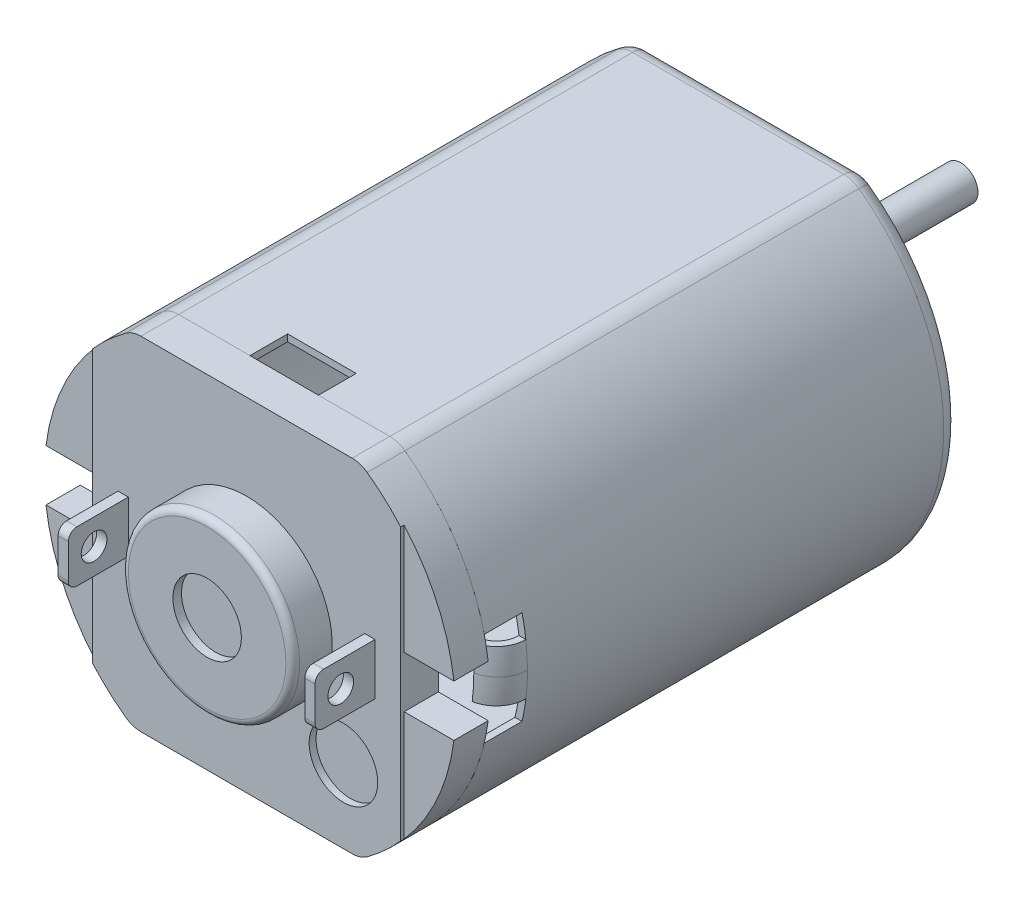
ISO-10303-21;
HEADER;
FILE_DESCRIPTION(('STEP AP214'),'2;1');
FILE_NAME('part.step','',(''),(''),'','','');
FILE_SCHEMA(('AUTOMOTIVE_DESIGN { 1 0 10303 214 1 1 1 1 }'));
ENDSEC;
DATA;
#1=APPLICATION_CONTEXT('core data for automotive mechanical design processes');
#2=APPLICATION_PROTOCOL_DEFINITION('international standard','automotive_design',2000,#1);
#3=PRODUCT_CONTEXT('',#1,'mechanical');
#4=PRODUCT('Part','Part','',(#3));
#5=PRODUCT_RELATED_PRODUCT_CATEGORY('part','',(#4));
#6=PRODUCT_DEFINITION_FORMATION('','',#4);
#7=PRODUCT_DEFINITION_CONTEXT('part definition',#1,'design');
#8=PRODUCT_DEFINITION('design','',#6,#7);
#9=PRODUCT_DEFINITION_SHAPE('','',#8);
#10=(LENGTH_UNIT() NAMED_UNIT(*) SI_UNIT(.MILLI.,.METRE.));
#11=(NAMED_UNIT(*) PLANE_ANGLE_UNIT() SI_UNIT($,.RADIAN.));
#12=(NAMED_UNIT(*) SI_UNIT($,.STERADIAN.) SOLID_ANGLE_UNIT());
#13=UNCERTAINTY_MEASURE_WITH_UNIT(LENGTH_MEASURE(1.E-05),#10,'distance_accuracy_value','');
#14=(GEOMETRIC_REPRESENTATION_CONTEXT(3) GLOBAL_UNCERTAINTY_ASSIGNED_CONTEXT((#13)) GLOBAL_UNIT_ASSIGNED_CONTEXT((#10,
#11,#12)) REPRESENTATION_CONTEXT('',''));
#15=CARTESIAN_POINT('',(0.,0.,0.));
#16=DIRECTION('',(0.,0.,1.));
#17=DIRECTION('',(1.,0.,0.));
#18=AXIS2_PLACEMENT_3D('',#15,#16,#17);
#19=CARTESIAN_POINT('',(0.,0.,14.85));
#20=DIRECTION('',(0.,0.,1.));
#21=DIRECTION('',(1.,0.,0.));
#22=AXIS2_PLACEMENT_3D('',#19,#20,#21);
#23=PLANE('',#22);
#24=CARTESIAN_POINT('',(2.82842712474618,-2.8284271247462,14.85));
#25=DIRECTION('',(0.,0.,1.));
#26=DIRECTION('',(1.,0.,0.));
#27=AXIS2_PLACEMENT_3D('',#24,#25,#26);
#28=CIRCLE('',#27,1.);
#29=CARTESIAN_POINT('',(3.82842712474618,-2.8284271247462,14.85));
#30=VERTEX_POINT('',#29);
#31=EDGE_CURVE('E632',#30,#30,#28,.T.);
#32=ORIENTED_EDGE('',*,*,#31,.F.);
#33=EDGE_LOOP('',(#32));
#34=FACE_BOUND('',#33,.T.);
#35=CARTESIAN_POINT('',(0.,0.,14.85));
#36=DIRECTION('',(0.,0.,1.));
#37=DIRECTION('',(1.,0.,0.));
#38=AXIS2_PLACEMENT_3D('',#35,#36,#37);
#39=CIRCLE('',#38,2.5);
#40=CARTESIAN_POINT('',(2.5,0.,14.85));
#41=VERTEX_POINT('',#40);
#42=EDGE_CURVE('E358',#41,#41,#39,.T.);
#43=ORIENTED_EDGE('',*,*,#42,.F.);
#44=EDGE_LOOP('',(#43));
#45=FACE_BOUND('',#44,.T.);
#46=DIRECTION('',(0.,-1.,0.));
#47=VECTOR('',#46,1.);
#48=CARTESIAN_POINT('',(-4.5,0.75,14.85));
#49=LINE('',#48,#47);
#50=CARTESIAN_POINT('',(-4.5,3.96862696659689,14.85));
#51=VERTEX_POINT('',#50);
#52=CARTESIAN_POINT('',(-4.5,-3.96862696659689,14.85));
#53=VERTEX_POINT('',#52);
#54=EDGE_CURVE('E412',#51,#53,#49,.T.);
#55=ORIENTED_EDGE('',*,*,#54,.T.);
#56=CARTESIAN_POINT('',(0.,0.,14.85));
#57=DIRECTION('',(0.,0.,1.));
#58=DIRECTION('',(1.,0.,0.));
#59=AXIS2_PLACEMENT_3D('',#56,#57,#58);
#60=CIRCLE('',#59,6.);
#61=CARTESIAN_POINT('',(-3.52252228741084,-4.85714285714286,14.85));
#62=VERTEX_POINT('',#61);
#63=EDGE_CURVE('E416',#53,#62,#60,.T.);
#64=ORIENTED_EDGE('',*,*,#63,.T.);
#65=CARTESIAN_POINT('',(-3.08220700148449,-4.25,14.85));
#66=DIRECTION('',(0.,0.,1.));
#67=DIRECTION('',(1.,0.,0.));
#68=AXIS2_PLACEMENT_3D('',#65,#66,#67);
#69=CIRCLE('',#68,0.75);
#70=CARTESIAN_POINT('',(-3.08220700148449,-5.,14.85));
#71=VERTEX_POINT('',#70);
#72=EDGE_CURVE('E419',#62,#71,#69,.T.);
#73=ORIENTED_EDGE('',*,*,#72,.T.);
#74=DIRECTION('',(1.,0.,0.));
#75=VECTOR('',#74,1.);
#76=CARTESIAN_POINT('',(-3.08220700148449,-5.,14.85));
#77=LINE('',#76,#75);
#78=CARTESIAN_POINT('',(3.08220700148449,-5.,14.85));
#79=VERTEX_POINT('',#78);
#80=EDGE_CURVE('E422',#71,#79,#77,.T.);
#81=ORIENTED_EDGE('',*,*,#80,.T.);
#82=CARTESIAN_POINT('',(3.08220700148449,-4.25,14.85));
#83=DIRECTION('',(0.,0.,1.));
#84=DIRECTION('',(1.,0.,0.));
#85=AXIS2_PLACEMENT_3D('',#82,#83,#84);
#86=CIRCLE('',#85,0.75);
#87=CARTESIAN_POINT('',(3.52252228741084,-4.85714285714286,14.85));
#88=VERTEX_POINT('',#87);
#89=EDGE_CURVE('E425',#79,#88,#86,.T.);
#90=ORIENTED_EDGE('',*,*,#89,.T.);
#91=CARTESIAN_POINT('',(0.,0.,14.85));
#92=DIRECTION('',(0.,0.,1.));
#93=DIRECTION('',(1.,0.,0.));
#94=AXIS2_PLACEMENT_3D('',#91,#92,#93);
#95=CIRCLE('',#94,6.);
#96=CARTESIAN_POINT('',(4.5,-3.96862696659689,14.85));
#97=VERTEX_POINT('',#96);
#98=EDGE_CURVE('E428',#88,#97,#95,.T.);
#99=ORIENTED_EDGE('',*,*,#98,.T.);
#100=DIRECTION('',(0.,1.,0.));
#101=VECTOR('',#100,1.);
#102=CARTESIAN_POINT('',(4.5,0.75,14.85));
#103=LINE('',#102,#101);
#104=CARTESIAN_POINT('',(4.5,3.96862696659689,14.85));
#105=VERTEX_POINT('',#104);
#106=EDGE_CURVE('E432',#97,#105,#103,.T.);
#107=ORIENTED_EDGE('',*,*,#106,.T.);
#108=CARTESIAN_POINT('',(0.,0.,14.85));
#109=DIRECTION('',(0.,0.,1.));
#110=DIRECTION('',(1.,0.,0.));
#111=AXIS2_PLACEMENT_3D('',#108,#109,#110);
#112=CIRCLE('',#111,6.);
#113=CARTESIAN_POINT('',(3.52252228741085,4.85714285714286,14.85));
#114=VERTEX_POINT('',#113);
#115=EDGE_CURVE('E435',#105,#114,#112,.T.);
#116=ORIENTED_EDGE('',*,*,#115,.T.);
#117=CARTESIAN_POINT('',(3.08220700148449,4.25,14.85));
#118=DIRECTION('',(0.,0.,1.));
#119=DIRECTION('',(1.,0.,0.));
#120=AXIS2_PLACEMENT_3D('',#117,#118,#119);
#121=CIRCLE('',#120,0.75);
#122=CARTESIAN_POINT('',(3.08220700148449,5.,14.85));
#123=VERTEX_POINT('',#122);
#124=EDGE_CURVE('E438',#114,#123,#121,.T.);
#125=ORIENTED_EDGE('',*,*,#124,.T.);
#126=DIRECTION('',(-1.,0.,0.));
#127=VECTOR('',#126,1.);
#128=CARTESIAN_POINT('',(3.08220700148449,5.,14.85));
#129=LINE('',#128,#127);
#130=CARTESIAN_POINT('',(-3.08220700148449,5.,14.85));
#131=VERTEX_POINT('',#130);
#132=EDGE_CURVE('E441',#123,#131,#129,.T.);
#133=ORIENTED_EDGE('',*,*,#132,.T.);
#134=CARTESIAN_POINT('',(-3.08220700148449,4.25,14.85));
#135=DIRECTION('',(0.,0.,1.));
#136=DIRECTION('',(1.,0.,0.));
#137=AXIS2_PLACEMENT_3D('',#134,#135,#136);
#138=CIRCLE('',#137,0.75);
#139=CARTESIAN_POINT('',(-3.52252228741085,4.85714285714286,14.85));
#140=VERTEX_POINT('',#139);
#141=EDGE_CURVE('E444',#131,#140,#138,.T.);
#142=ORIENTED_EDGE('',*,*,#141,.T.);
#143=CARTESIAN_POINT('',(0.,0.,14.85));
#144=DIRECTION('',(0.,0.,1.));
#145=DIRECTION('',(1.,0.,0.));
#146=AXIS2_PLACEMENT_3D('',#143,#144,#145);
#147=CIRCLE('',#146,6.);
#148=EDGE_CURVE('E408',#140,#51,#147,.T.);
#149=ORIENTED_EDGE('',*,*,#148,.T.);
#150=EDGE_LOOP('',(#55,#64,#73,#81,#90,#99,#107,#116,#125,#133,#142,#149));
#151=FACE_BOUND('',#150,.T.);
#152=DIRECTION('',(-1.,0.,0.));
#153=VECTOR('',#152,1.);
#154=CARTESIAN_POINT('',(-3.75,0.75,14.85));
#155=LINE('',#154,#153);
#156=CARTESIAN_POINT('',(-3.45,0.75,14.85));
#157=VERTEX_POINT('',#156);
#158=CARTESIAN_POINT('',(-3.75,0.75,14.85));
#159=VERTEX_POINT('',#158);
#160=EDGE_CURVE('E319',#157,#159,#155,.T.);
#161=ORIENTED_EDGE('',*,*,#160,.F.);
#162=DIRECTION('',(0.,1.,0.));
#163=VECTOR('',#162,1.);
#164=CARTESIAN_POINT('',(-3.45,0.75,14.85));
#165=LINE('',#164,#163);
#166=CARTESIAN_POINT('',(-3.45,-0.75,14.85));
#167=VERTEX_POINT('',#166);
#168=EDGE_CURVE('E272',#167,#157,#165,.T.);
#169=ORIENTED_EDGE('',*,*,#168,.F.);
#170=DIRECTION('',(1.,0.,0.));
#171=VECTOR('',#170,1.);
#172=CARTESIAN_POINT('',(-3.75,-0.75,14.85));
#173=LINE('',#172,#171);
#174=CARTESIAN_POINT('',(-3.75,-0.75,14.85));
#175=VERTEX_POINT('',#174);
#176=EDGE_CURVE('E311',#175,#167,#173,.T.);
#177=ORIENTED_EDGE('',*,*,#176,.F.);
#178=DIRECTION('',(0.,-1.,0.));
#179=VECTOR('',#178,1.);
#180=CARTESIAN_POINT('',(-3.75,0.75,14.85));
#181=LINE('',#180,#179);
#182=EDGE_CURVE('E323',#159,#175,#181,.T.);
#183=ORIENTED_EDGE('',*,*,#182,.F.);
#184=EDGE_LOOP('',(#161,#169,#177,#183));
#185=FACE_BOUND('',#184,.T.);
#186=DIRECTION('',(-1.,0.,0.));
#187=VECTOR('',#186,1.);
#188=CARTESIAN_POINT('',(3.45,0.75,14.85));
#189=LINE('',#188,#187);
#190=CARTESIAN_POINT('',(3.75,0.75,14.85));
#191=VERTEX_POINT('',#190);
#192=CARTESIAN_POINT('',(3.45,0.75,14.85));
#193=VERTEX_POINT('',#192);
#194=EDGE_CURVE('E266',#191,#193,#189,.T.);
#195=ORIENTED_EDGE('',*,*,#194,.F.);
#196=DIRECTION('',(0.,1.,0.));
#197=VECTOR('',#196,1.);
#198=CARTESIAN_POINT('',(3.75,0.75,14.85));
#199=LINE('',#198,#197);
#200=CARTESIAN_POINT('',(3.75,-0.75,14.85));
#201=VERTEX_POINT('',#200);
#202=EDGE_CURVE('E276',#201,#191,#199,.T.);
#203=ORIENTED_EDGE('',*,*,#202,.F.);
#204=DIRECTION('',(1.,0.,0.));
#205=VECTOR('',#204,1.);
#206=CARTESIAN_POINT('',(3.45,-0.75,14.85));
#207=LINE('',#206,#205);
#208=CARTESIAN_POINT('',(3.45,-0.75,14.85));
#209=VERTEX_POINT('',#208);
#210=EDGE_CURVE('E291',#209,#201,#207,.T.);
#211=ORIENTED_EDGE('',*,*,#210,.F.);
#212=DIRECTION('',(0.,-1.,0.));
#213=VECTOR('',#212,1.);
#214=CARTESIAN_POINT('',(3.45,0.75,14.85));
#215=LINE('',#214,#213);
#216=EDGE_CURVE('E287',#193,#209,#215,.T.);
#217=ORIENTED_EDGE('',*,*,#216,.F.);
#218=EDGE_LOOP('',(#195,#203,#211,#217));
#219=FACE_BOUND('',#218,.T.);
#220=ADVANCED_FACE('F52',(#34,#45,#151,#185,#219),#23,.T.);
#221=CARTESIAN_POINT('',(-4.5,0.75,14.85));
#222=DIRECTION('',(0.,1.,0.));
#223=DIRECTION('',(0.,0.,1.));
#224=AXIS2_PLACEMENT_3D('',#221,#222,#223);
#225=PLANE('',#224);
#226=DIRECTION('',(1.,0.,0.));
#227=VECTOR('',#226,1.);
#228=CARTESIAN_POINT('',(-4.5,0.75,14.75));
#229=LINE('',#228,#227);
#230=CARTESIAN_POINT('',(-5.95294044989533,0.75,14.75));
#231=VERTEX_POINT('',#230);
#232=CARTESIAN_POINT('',(-4.5,0.75,14.75));
#233=VERTEX_POINT('',#232);
#234=EDGE_CURVE('E404',#231,#233,#229,.T.);
#235=ORIENTED_EDGE('',*,*,#234,.F.);
#236=DIRECTION('',(0.,0.,-1.));
#237=VECTOR('',#236,1.);
#238=CARTESIAN_POINT('',(-5.95294044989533,0.75,14.85));
#239=LINE('',#238,#237);
#240=CARTESIAN_POINT('',(-5.95294044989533,0.75,13.75));
#241=VERTEX_POINT('',#240);
#242=EDGE_CURVE('E363',#231,#241,#239,.T.);
#243=ORIENTED_EDGE('',*,*,#242,.T.);
#244=DIRECTION('',(1.,0.,0.));
#245=VECTOR('',#244,1.);
#246=CARTESIAN_POINT('',(-4.5,0.75,13.75));
#247=LINE('',#246,#245);
#248=CARTESIAN_POINT('',(-4.5,0.75,13.75));
#249=VERTEX_POINT('',#248);
#250=EDGE_CURVE('E451',#241,#249,#247,.T.);
#251=ORIENTED_EDGE('',*,*,#250,.T.);
#252=DIRECTION('',(0.,0.,-1.));
#253=VECTOR('',#252,1.);
#254=CARTESIAN_POINT('',(-4.5,0.75,14.85));
#255=LINE('',#254,#253);
#256=EDGE_CURVE('E552',#233,#249,#255,.T.);
#257=ORIENTED_EDGE('',*,*,#256,.F.);
#258=EDGE_LOOP('',(#235,#243,#251,#257));
#259=FACE_BOUND('',#258,.T.);
#260=ADVANCED_FACE('F650',(#259),#225,.F.);
#261=CARTESIAN_POINT('',(-5.95294044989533,-0.75,14.85));
#262=DIRECTION('',(0.,-1.,0.));
#263=DIRECTION('',(1.,0.,0.));
#264=AXIS2_PLACEMENT_3D('',#261,#262,#263);
#265=PLANE('',#264);
#266=DIRECTION('',(-1.,0.,0.));
#267=VECTOR('',#266,1.);
#268=CARTESIAN_POINT('',(-5.95294044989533,-0.75,14.75));
#269=LINE('',#268,#267);
#270=CARTESIAN_POINT('',(-4.5,-0.750000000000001,14.75));
#271=VERTEX_POINT('',#270);
#272=CARTESIAN_POINT('',(-5.95294044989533,-0.749999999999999,14.75));
#273=VERTEX_POINT('',#272);
#274=EDGE_CURVE('E401',#271,#273,#269,.T.);
#275=ORIENTED_EDGE('',*,*,#274,.F.);
#276=DIRECTION('',(0.,0.,-1.));
#277=VECTOR('',#276,1.);
#278=CARTESIAN_POINT('',(-4.5,-0.750000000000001,14.85));
#279=LINE('',#278,#277);
#280=CARTESIAN_POINT('',(-4.5,-0.750000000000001,13.75));
#281=VERTEX_POINT('',#280);
#282=EDGE_CURVE('E549',#271,#281,#279,.T.);
#283=ORIENTED_EDGE('',*,*,#282,.T.);
#284=DIRECTION('',(-1.,0.,0.));
#285=VECTOR('',#284,1.);
#286=CARTESIAN_POINT('',(-5.95294044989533,-0.75,13.75));
#287=LINE('',#286,#285);
#288=CARTESIAN_POINT('',(-5.95294044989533,-0.75,13.75));
#289=VERTEX_POINT('',#288);
#290=EDGE_CURVE('E459',#281,#289,#287,.T.);
#291=ORIENTED_EDGE('',*,*,#290,.T.);
#292=DIRECTION('',(0.,0.,-1.));
#293=VECTOR('',#292,1.);
#294=CARTESIAN_POINT('',(-5.95294044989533,-0.75,14.85));
#295=LINE('',#294,#293);
#296=EDGE_CURVE('E546',#273,#289,#295,.T.);
#297=ORIENTED_EDGE('',*,*,#296,.F.);
#298=EDGE_LOOP('',(#275,#283,#291,#297));
#299=FACE_BOUND('',#298,.T.);
#300=ADVANCED_FACE('F984',(#299),#265,.F.);
#301=CARTESIAN_POINT('',(4.5,-0.75,14.85));
#302=DIRECTION('',(0.,-1.,0.));
#303=DIRECTION('',(0.,0.,-1.));
#304=AXIS2_PLACEMENT_3D('',#301,#302,#303);
#305=PLANE('',#304);
#306=DIRECTION('',(-1.,0.,0.));
#307=VECTOR('',#306,1.);
#308=CARTESIAN_POINT('',(4.5,-0.75,14.75));
#309=LINE('',#308,#307);
#310=CARTESIAN_POINT('',(5.95294044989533,-0.75,14.75));
#311=VERTEX_POINT('',#310);
#312=CARTESIAN_POINT('',(4.5,-0.75,14.75));
#313=VERTEX_POINT('',#312);
#314=EDGE_CURVE('E398',#311,#313,#309,.T.);
#315=ORIENTED_EDGE('',*,*,#314,.F.);
#316=DIRECTION('',(0.,0.,-1.));
#317=VECTOR('',#316,1.);
#318=CARTESIAN_POINT('',(5.95294044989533,-0.75,14.85));
#319=LINE('',#318,#317);
#320=CARTESIAN_POINT('',(5.95294044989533,-0.75,13.75));
#321=VERTEX_POINT('',#320);
#322=EDGE_CURVE('E527',#311,#321,#319,.T.);
#323=ORIENTED_EDGE('',*,*,#322,.T.);
#324=DIRECTION('',(-1.,0.,0.));
#325=VECTOR('',#324,1.);
#326=CARTESIAN_POINT('',(4.5,-0.75,13.75));
#327=LINE('',#326,#325);
#328=CARTESIAN_POINT('',(4.5,-0.75,13.75));
#329=VERTEX_POINT('',#328);
#330=EDGE_CURVE('E479',#321,#329,#327,.T.);
#331=ORIENTED_EDGE('',*,*,#330,.T.);
#332=DIRECTION('',(0.,0.,-1.));
#333=VECTOR('',#332,1.);
#334=CARTESIAN_POINT('',(4.5,-0.75,14.85));
#335=LINE('',#334,#333);
#336=EDGE_CURVE('E524',#313,#329,#335,.T.);
#337=ORIENTED_EDGE('',*,*,#336,.F.);
#338=EDGE_LOOP('',(#315,#323,#331,#337));
#339=FACE_BOUND('',#338,.T.);
#340=ADVANCED_FACE('F976',(#339),#305,.F.);
#341=CARTESIAN_POINT('',(5.95294044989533,0.75,14.85));
#342=DIRECTION('',(0.,1.,0.));
#343=DIRECTION('',(0.,0.,1.));
#344=AXIS2_PLACEMENT_3D('',#341,#342,#343);
#345=PLANE('',#344);
#346=DIRECTION('',(1.,0.,0.));
#347=VECTOR('',#346,1.);
#348=CARTESIAN_POINT('',(5.95294044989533,0.75,14.75));
#349=LINE('',#348,#347);
#350=CARTESIAN_POINT('',(4.5,0.75,14.75));
#351=VERTEX_POINT('',#350);
#352=CARTESIAN_POINT('',(5.95294044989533,0.75,14.75));
#353=VERTEX_POINT('',#352);
#354=EDGE_CURVE('E377',#351,#353,#349,.T.);
#355=ORIENTED_EDGE('',*,*,#354,.F.);
#356=DIRECTION('',(0.,0.,-1.));
#357=VECTOR('',#356,1.);
#358=CARTESIAN_POINT('',(4.5,0.75,14.85));
#359=LINE('',#358,#357);
#360=CARTESIAN_POINT('',(4.5,0.75,13.75));
#361=VERTEX_POINT('',#360);
#362=EDGE_CURVE('E521',#351,#361,#359,.T.);
#363=ORIENTED_EDGE('',*,*,#362,.T.);
#364=DIRECTION('',(1.,0.,0.));
#365=VECTOR('',#364,1.);
#366=CARTESIAN_POINT('',(5.95294044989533,0.75,13.75));
#367=LINE('',#366,#365);
#368=CARTESIAN_POINT('',(5.95294044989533,0.75,13.75));
#369=VERTEX_POINT('',#368);
#370=EDGE_CURVE('E487',#361,#369,#367,.T.);
#371=ORIENTED_EDGE('',*,*,#370,.T.);
#372=DIRECTION('',(0.,0.,-1.));
#373=VECTOR('',#372,1.);
#374=CARTESIAN_POINT('',(5.95294044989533,0.75,14.85));
#375=LINE('',#374,#373);
#376=EDGE_CURVE('E518',#353,#369,#375,.T.);
#377=ORIENTED_EDGE('',*,*,#376,.F.);
#378=EDGE_LOOP('',(#355,#363,#371,#377));
#379=FACE_BOUND('',#378,.T.);
#380=ADVANCED_FACE('F969',(#379),#345,.F.);
#381=CARTESIAN_POINT('',(0.,0.,14.85));
#382=DIRECTION('',(0.,0.,-1.));
#383=DIRECTION('',(-1.,0.,0.));
#384=AXIS2_PLACEMENT_3D('',#381,#382,#383);
#385=CYLINDRICAL_SURFACE('',#384,6.);
#386=CARTESIAN_POINT('',(0.,0.,14.75));
#387=DIRECTION('',(0.,0.,1.));
#388=DIRECTION('',(1.,0.,0.));
#389=AXIS2_PLACEMENT_3D('',#386,#387,#388);
#390=CIRCLE('',#389,6.);
#391=CARTESIAN_POINT('',(-4.5,3.96862696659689,14.75));
#392=VERTEX_POINT('',#391);
#393=EDGE_CURVE('E364',#392,#231,#390,.T.);
#394=ORIENTED_EDGE('',*,*,#393,.F.);
#395=DIRECTION('',(0.,0.,1.));
#396=VECTOR('',#395,1.);
#397=CARTESIAN_POINT('',(-4.5,3.96862696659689,14.75));
#398=LINE('',#397,#396);
#399=EDGE_CURVE('E373',#392,#51,#398,.T.);
#400=ORIENTED_EDGE('',*,*,#399,.T.);
#401=ORIENTED_EDGE('',*,*,#148,.F.);
#402=DIRECTION('',(0.,0.,-1.));
#403=VECTOR('',#402,1.);
#404=CARTESIAN_POINT('',(-3.52252228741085,4.85714285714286,14.85));
#405=LINE('',#404,#403);
#406=CARTESIAN_POINT('',(-3.52252228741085,4.85714285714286,13.75));
#407=VERTEX_POINT('',#406);
#408=EDGE_CURVE('E447',#140,#407,#405,.T.);
#409=ORIENTED_EDGE('',*,*,#408,.T.);
#410=CARTESIAN_POINT('',(0.,0.,13.75));
#411=DIRECTION('',(0.,0.,1.));
#412=DIRECTION('',(1.,0.,0.));
#413=AXIS2_PLACEMENT_3D('',#410,#411,#412);
#414=CIRCLE('',#413,6.);
#415=EDGE_CURVE('E407',#407,#241,#414,.T.);
#416=ORIENTED_EDGE('',*,*,#415,.T.);
#417=ORIENTED_EDGE('',*,*,#242,.F.);
#418=EDGE_LOOP('',(#394,#400,#401,#409,#416,#417));
#419=FACE_BOUND('',#418,.T.);
#420=ADVANCED_FACE('F697',(#419),#385,.T.);
#421=CARTESIAN_POINT('',(-4.5,0.75,14.85));
#422=DIRECTION('',(1.,0.,0.));
#423=DIRECTION('',(0.,0.,-1.));
#424=AXIS2_PLACEMENT_3D('',#421,#422,#423);
#425=PLANE('',#424);
#426=ORIENTED_EDGE('',*,*,#54,.F.);
#427=ORIENTED_EDGE('',*,*,#399,.F.);
#428=DIRECTION('',(0.,1.,0.));
#429=VECTOR('',#428,1.);
#430=CARTESIAN_POINT('',(-4.5,3.96862696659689,14.75));
#431=LINE('',#430,#429);
#432=EDGE_CURVE('E367',#233,#392,#431,.T.);
#433=ORIENTED_EDGE('',*,*,#432,.F.);
#434=ORIENTED_EDGE('',*,*,#256,.T.);
#435=DIRECTION('',(0.,-1.,0.));
#436=VECTOR('',#435,1.);
#437=CARTESIAN_POINT('',(-4.5,0.75,13.75));
#438=LINE('',#437,#436);
#439=EDGE_CURVE('E455',#249,#281,#438,.T.);
#440=ORIENTED_EDGE('',*,*,#439,.T.);
#441=ORIENTED_EDGE('',*,*,#282,.F.);
#442=CARTESIAN_POINT('',(-4.5,-3.96862696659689,14.75));
#443=VERTEX_POINT('',#442);
#444=EDGE_CURVE('E369',#443,#271,#431,.T.);
#445=ORIENTED_EDGE('',*,*,#444,.F.);
#446=DIRECTION('',(0.,0.,1.));
#447=VECTOR('',#446,1.);
#448=CARTESIAN_POINT('',(-4.5,-3.96862696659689,14.75));
#449=LINE('',#448,#447);
#450=EDGE_CURVE('E372',#443,#53,#449,.T.);
#451=ORIENTED_EDGE('',*,*,#450,.T.);
#452=EDGE_LOOP('',(#426,#427,#433,#434,#440,#441,#445,#451));
#453=FACE_BOUND('',#452,.T.);
#454=ADVANCED_FACE('F954',(#453),#425,.F.);
#455=CARTESIAN_POINT('',(0.,0.,14.85));
#456=DIRECTION('',(0.,0.,-1.));
#457=DIRECTION('',(-1.,0.,0.));
#458=AXIS2_PLACEMENT_3D('',#455,#456,#457);
#459=CYLINDRICAL_SURFACE('',#458,6.);
#460=ORIENTED_EDGE('',*,*,#63,.F.);
#461=ORIENTED_EDGE('',*,*,#450,.F.);
#462=EDGE_CURVE('E368',#273,#443,#390,.T.);
#463=ORIENTED_EDGE('',*,*,#462,.F.);
#464=ORIENTED_EDGE('',*,*,#296,.T.);
#465=CARTESIAN_POINT('',(0.,0.,13.75));
#466=DIRECTION('',(0.,0.,1.));
#467=DIRECTION('',(1.,0.,0.));
#468=AXIS2_PLACEMENT_3D('',#465,#466,#467);
#469=CIRCLE('',#468,6.);
#470=CARTESIAN_POINT('',(-3.52252228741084,-4.85714285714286,13.75));
#471=VERTEX_POINT('',#470);
#472=EDGE_CURVE('E463',#289,#471,#469,.T.);
#473=ORIENTED_EDGE('',*,*,#472,.T.);
#474=DIRECTION('',(0.,0.,-1.));
#475=VECTOR('',#474,1.);
#476=CARTESIAN_POINT('',(-3.52252228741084,-4.85714285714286,14.85));
#477=LINE('',#476,#475);
#478=EDGE_CURVE('E542',#62,#471,#477,.T.);
#479=ORIENTED_EDGE('',*,*,#478,.F.);
#480=EDGE_LOOP('',(#460,#461,#463,#464,#473,#479));
#481=FACE_BOUND('',#480,.T.);
#482=ADVANCED_FACE('F947',(#481),#459,.T.);
#483=CARTESIAN_POINT('',(-3.08220700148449,-4.25,14.85));
#484=DIRECTION('',(0.,0.,-1.));
#485=DIRECTION('',(-1.,0.,0.));
#486=AXIS2_PLACEMENT_3D('',#483,#484,#485);
#487=CYLINDRICAL_SURFACE('',#486,0.75);
#488=CARTESIAN_POINT('',(-3.08220700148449,-4.25,13.75));
#489=DIRECTION('',(0.,0.,1.));
#490=DIRECTION('',(1.,0.,0.));
#491=AXIS2_PLACEMENT_3D('',#488,#489,#490);
#492=CIRCLE('',#491,0.75);
#493=CARTESIAN_POINT('',(-3.08220700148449,-5.,13.75));
#494=VERTEX_POINT('',#493);
#495=EDGE_CURVE('E466',#471,#494,#492,.T.);
#496=ORIENTED_EDGE('',*,*,#495,.T.);
#497=DIRECTION('',(0.,0.,-1.));
#498=VECTOR('',#497,1.);
#499=CARTESIAN_POINT('',(-3.08220700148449,-5.,14.85));
#500=LINE('',#499,#498);
#501=EDGE_CURVE('E538',#71,#494,#500,.T.);
#502=ORIENTED_EDGE('',*,*,#501,.F.);
#503=ORIENTED_EDGE('',*,*,#72,.F.);
#504=ORIENTED_EDGE('',*,*,#478,.T.);
#505=EDGE_LOOP('',(#496,#502,#503,#504));
#506=FACE_BOUND('',#505,.T.);
#507=ADVANCED_FACE('F939',(#506),#487,.T.);
#508=CARTESIAN_POINT('',(-3.08220700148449,-5.,14.85));
#509=DIRECTION('',(0.,1.,0.));
#510=DIRECTION('',(0.,0.,1.));
#511=AXIS2_PLACEMENT_3D('',#508,#509,#510);
#512=PLANE('',#511);
#513=DIRECTION('',(1.,0.,0.));
#514=VECTOR('',#513,1.);
#515=CARTESIAN_POINT('',(-3.08220700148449,-5.,13.75));
#516=LINE('',#515,#514);
#517=CARTESIAN_POINT('',(3.08220700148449,-5.,13.75));
#518=VERTEX_POINT('',#517);
#519=EDGE_CURVE('E469',#494,#518,#516,.T.);
#520=ORIENTED_EDGE('',*,*,#519,.T.);
#521=DIRECTION('',(0.,0.,-1.));
#522=VECTOR('',#521,1.);
#523=CARTESIAN_POINT('',(3.08220700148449,-5.,14.85));
#524=LINE('',#523,#522);
#525=EDGE_CURVE('E534',#79,#518,#524,.T.);
#526=ORIENTED_EDGE('',*,*,#525,.F.);
#527=ORIENTED_EDGE('',*,*,#80,.F.);
#528=ORIENTED_EDGE('',*,*,#501,.T.);
#529=EDGE_LOOP('',(#520,#526,#527,#528));
#530=FACE_BOUND('',#529,.T.);
#531=ADVANCED_FACE('F931',(#530),#512,.F.);
#532=CARTESIAN_POINT('',(3.08220700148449,-4.25,14.85));
#533=DIRECTION('',(0.,0.,-1.));
#534=DIRECTION('',(-1.,0.,0.));
#535=AXIS2_PLACEMENT_3D('',#532,#533,#534);
#536=CYLINDRICAL_SURFACE('',#535,0.75);
#537=CARTESIAN_POINT('',(3.08220700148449,-4.25,13.75));
#538=DIRECTION('',(0.,0.,1.));
#539=DIRECTION('',(1.,0.,0.));
#540=AXIS2_PLACEMENT_3D('',#537,#538,#539);
#541=CIRCLE('',#540,0.75);
#542=CARTESIAN_POINT('',(3.52252228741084,-4.85714285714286,13.75));
#543=VERTEX_POINT('',#542);
#544=EDGE_CURVE('E472',#518,#543,#541,.T.);
#545=ORIENTED_EDGE('',*,*,#544,.T.);
#546=DIRECTION('',(0.,0.,-1.));
#547=VECTOR('',#546,1.);
#548=CARTESIAN_POINT('',(3.52252228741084,-4.85714285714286,14.85));
#549=LINE('',#548,#547);
#550=EDGE_CURVE('E530',#88,#543,#549,.T.);
#551=ORIENTED_EDGE('',*,*,#550,.F.);
#552=ORIENTED_EDGE('',*,*,#89,.F.);
#553=ORIENTED_EDGE('',*,*,#525,.T.);
#554=EDGE_LOOP('',(#545,#551,#552,#553));
#555=FACE_BOUND('',#554,.T.);
#556=ADVANCED_FACE('F923',(#555),#536,.T.);
#557=CARTESIAN_POINT('',(0.,0.,14.85));
#558=DIRECTION('',(0.,0.,-1.));
#559=DIRECTION('',(-1.,0.,0.));
#560=AXIS2_PLACEMENT_3D('',#557,#558,#559);
#561=CYLINDRICAL_SURFACE('',#560,6.);
#562=CARTESIAN_POINT('',(0.,0.,14.75));
#563=DIRECTION('',(0.,0.,1.));
#564=DIRECTION('',(1.,0.,0.));
#565=AXIS2_PLACEMENT_3D('',#562,#563,#564);
#566=CIRCLE('',#565,6.);
#567=CARTESIAN_POINT('',(4.5,-3.96862696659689,14.75));
#568=VERTEX_POINT('',#567);
#569=EDGE_CURVE('E381',#568,#311,#566,.T.);
#570=ORIENTED_EDGE('',*,*,#569,.F.);
#571=DIRECTION('',(0.,0.,1.));
#572=VECTOR('',#571,1.);
#573=CARTESIAN_POINT('',(4.5,-3.96862696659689,14.75));
#574=LINE('',#573,#572);
#575=EDGE_CURVE('E389',#568,#97,#574,.T.);
#576=ORIENTED_EDGE('',*,*,#575,.T.);
#577=ORIENTED_EDGE('',*,*,#98,.F.);
#578=ORIENTED_EDGE('',*,*,#550,.T.);
#579=CARTESIAN_POINT('',(0.,0.,13.75));
#580=DIRECTION('',(0.,0.,1.));
#581=DIRECTION('',(1.,0.,0.));
#582=AXIS2_PLACEMENT_3D('',#579,#580,#581);
#583=CIRCLE('',#582,6.);
#584=EDGE_CURVE('E475',#543,#321,#583,.T.);
#585=ORIENTED_EDGE('',*,*,#584,.T.);
#586=ORIENTED_EDGE('',*,*,#322,.F.);
#587=EDGE_LOOP('',(#570,#576,#577,#578,#585,#586));
#588=FACE_BOUND('',#587,.T.);
#589=ADVANCED_FACE('F915',(#588),#561,.T.);
#590=CARTESIAN_POINT('',(4.5,0.75,14.85));
#591=DIRECTION('',(-1.,0.,0.));
#592=DIRECTION('',(0.,0.,1.));
#593=AXIS2_PLACEMENT_3D('',#590,#591,#592);
#594=PLANE('',#593);
#595=ORIENTED_EDGE('',*,*,#106,.F.);
#596=ORIENTED_EDGE('',*,*,#575,.F.);
#597=DIRECTION('',(0.,-1.,0.));
#598=VECTOR('',#597,1.);
#599=CARTESIAN_POINT('',(4.5,3.96862696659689,14.75));
#600=LINE('',#599,#598);
#601=EDGE_CURVE('E384',#313,#568,#600,.T.);
#602=ORIENTED_EDGE('',*,*,#601,.F.);
#603=ORIENTED_EDGE('',*,*,#336,.T.);
#604=DIRECTION('',(0.,1.,0.));
#605=VECTOR('',#604,1.);
#606=CARTESIAN_POINT('',(4.5,0.75,13.75));
#607=LINE('',#606,#605);
#608=EDGE_CURVE('E483',#329,#361,#607,.T.);
#609=ORIENTED_EDGE('',*,*,#608,.T.);
#610=ORIENTED_EDGE('',*,*,#362,.F.);
#611=CARTESIAN_POINT('',(4.5,3.96862696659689,14.75));
#612=VERTEX_POINT('',#611);
#613=EDGE_CURVE('E385',#612,#351,#600,.T.);
#614=ORIENTED_EDGE('',*,*,#613,.F.);
#615=DIRECTION('',(0.,0.,1.));
#616=VECTOR('',#615,1.);
#617=CARTESIAN_POINT('',(4.5,3.96862696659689,14.75));
#618=LINE('',#617,#616);
#619=EDGE_CURVE('E388',#612,#105,#618,.T.);
#620=ORIENTED_EDGE('',*,*,#619,.T.);
#621=EDGE_LOOP('',(#595,#596,#602,#603,#609,#610,#614,#620));
#622=FACE_BOUND('',#621,.T.);
#623=ADVANCED_FACE('F907',(#622),#594,.F.);
#624=CARTESIAN_POINT('',(0.,0.,14.85));
#625=DIRECTION('',(0.,0.,-1.));
#626=DIRECTION('',(-1.,0.,0.));
#627=AXIS2_PLACEMENT_3D('',#624,#625,#626);
#628=CYLINDRICAL_SURFACE('',#627,6.);
#629=ORIENTED_EDGE('',*,*,#115,.F.);
#630=ORIENTED_EDGE('',*,*,#619,.F.);
#631=EDGE_CURVE('E357',#353,#612,#566,.T.);
#632=ORIENTED_EDGE('',*,*,#631,.F.);
#633=ORIENTED_EDGE('',*,*,#376,.T.);
#634=CARTESIAN_POINT('',(0.,0.,13.75));
#635=DIRECTION('',(0.,0.,1.));
#636=DIRECTION('',(1.,0.,0.));
#637=AXIS2_PLACEMENT_3D('',#634,#635,#636);
#638=CIRCLE('',#637,6.);
#639=CARTESIAN_POINT('',(3.52252228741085,4.85714285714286,13.75));
#640=VERTEX_POINT('',#639);
#641=EDGE_CURVE('E491',#369,#640,#638,.T.);
#642=ORIENTED_EDGE('',*,*,#641,.T.);
#643=DIRECTION('',(0.,0.,-1.));
#644=VECTOR('',#643,1.);
#645=CARTESIAN_POINT('',(3.52252228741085,4.85714285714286,14.85));
#646=LINE('',#645,#644);
#647=EDGE_CURVE('E514',#114,#640,#646,.T.);
#648=ORIENTED_EDGE('',*,*,#647,.F.);
#649=EDGE_LOOP('',(#629,#630,#632,#633,#642,#648));
#650=FACE_BOUND('',#649,.T.);
#651=ADVANCED_FACE('F899',(#650),#628,.T.);
#652=CARTESIAN_POINT('',(3.08220700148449,4.25,14.85));
#653=DIRECTION('',(0.,0.,-1.));
#654=DIRECTION('',(-1.,0.,0.));
#655=AXIS2_PLACEMENT_3D('',#652,#653,#654);
#656=CYLINDRICAL_SURFACE('',#655,0.75);
#657=CARTESIAN_POINT('',(3.08220700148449,4.25,13.75));
#658=DIRECTION('',(0.,0.,1.));
#659=DIRECTION('',(1.,0.,0.));
#660=AXIS2_PLACEMENT_3D('',#657,#658,#659);
#661=CIRCLE('',#660,0.75);
#662=CARTESIAN_POINT('',(3.08220700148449,5.,13.75));
#663=VERTEX_POINT('',#662);
#664=EDGE_CURVE('E494',#640,#663,#661,.T.);
#665=ORIENTED_EDGE('',*,*,#664,.T.);
#666=DIRECTION('',(0.,0.,-1.));
#667=VECTOR('',#666,1.);
#668=CARTESIAN_POINT('',(3.08220700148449,5.,14.85));
#669=LINE('',#668,#667);
#670=EDGE_CURVE('E510',#123,#663,#669,.T.);
#671=ORIENTED_EDGE('',*,*,#670,.F.);
#672=ORIENTED_EDGE('',*,*,#124,.F.);
#673=ORIENTED_EDGE('',*,*,#647,.T.);
#674=EDGE_LOOP('',(#665,#671,#672,#673));
#675=FACE_BOUND('',#674,.T.);
#676=ADVANCED_FACE('F891',(#675),#656,.T.);
#677=CARTESIAN_POINT('',(-1.,5.,14.85));
#678=DIRECTION('',(0.,-1.,0.));
#679=DIRECTION('',(0.,0.,-1.));
#680=AXIS2_PLACEMENT_3D('',#677,#678,#679);
#681=PLANE('',#680);
#682=DIRECTION('',(-1.,0.,0.));
#683=VECTOR('',#682,1.);
#684=CARTESIAN_POINT('',(-1.,5.,13.75));
#685=LINE('',#684,#683);
#686=CARTESIAN_POINT('',(-3.08220700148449,5.,13.75));
#687=VERTEX_POINT('',#686);
#688=EDGE_CURVE('E498',#663,#687,#685,.T.);
#689=ORIENTED_EDGE('',*,*,#688,.T.);
#690=DIRECTION('',(0.,0.,-1.));
#691=VECTOR('',#690,1.);
#692=CARTESIAN_POINT('',(-3.08220700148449,5.,14.85));
#693=LINE('',#692,#691);
#694=EDGE_CURVE('E506',#131,#687,#693,.T.);
#695=ORIENTED_EDGE('',*,*,#694,.F.);
#696=ORIENTED_EDGE('',*,*,#132,.F.);
#697=ORIENTED_EDGE('',*,*,#670,.T.);
#698=EDGE_LOOP('',(#689,#695,#696,#697));
#699=FACE_BOUND('',#698,.T.);
#700=ADVANCED_FACE('F883',(#699),#681,.F.);
#701=CARTESIAN_POINT('',(-3.08220700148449,4.25,14.85));
#702=DIRECTION('',(0.,0.,-1.));
#703=DIRECTION('',(-1.,0.,0.));
#704=AXIS2_PLACEMENT_3D('',#701,#702,#703);
#705=CYLINDRICAL_SURFACE('',#704,0.75);
#706=CARTESIAN_POINT('',(-3.08220700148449,4.25,13.75));
#707=DIRECTION('',(0.,0.,1.));
#708=DIRECTION('',(1.,0.,0.));
#709=AXIS2_PLACEMENT_3D('',#706,#707,#708);
#710=CIRCLE('',#709,0.75);
#711=EDGE_CURVE('E413',#687,#407,#710,.T.);
#712=ORIENTED_EDGE('',*,*,#711,.T.);
#713=ORIENTED_EDGE('',*,*,#408,.F.);
#714=ORIENTED_EDGE('',*,*,#141,.F.);
#715=ORIENTED_EDGE('',*,*,#694,.T.);
#716=EDGE_LOOP('',(#712,#713,#714,#715));
#717=FACE_BOUND('',#716,.T.);
#718=ADVANCED_FACE('F874',(#717),#705,.T.);
#719=CARTESIAN_POINT('',(0.,0.,13.75));
#720=DIRECTION('',(0.,0.,1.));
#721=DIRECTION('',(1.,0.,0.));
#722=AXIS2_PLACEMENT_3D('',#719,#720,#721);
#723=PLANE('',#722);
#724=ORIENTED_EDGE('',*,*,#415,.F.);
#725=ORIENTED_EDGE('',*,*,#711,.F.);
#726=ORIENTED_EDGE('',*,*,#688,.F.);
#727=ORIENTED_EDGE('',*,*,#664,.F.);
#728=ORIENTED_EDGE('',*,*,#641,.F.);
#729=ORIENTED_EDGE('',*,*,#370,.F.);
#730=ORIENTED_EDGE('',*,*,#608,.F.);
#731=ORIENTED_EDGE('',*,*,#330,.F.);
#732=ORIENTED_EDGE('',*,*,#584,.F.);
#733=ORIENTED_EDGE('',*,*,#544,.F.);
#734=ORIENTED_EDGE('',*,*,#519,.F.);
#735=ORIENTED_EDGE('',*,*,#495,.F.);
#736=ORIENTED_EDGE('',*,*,#472,.F.);
#737=ORIENTED_EDGE('',*,*,#290,.F.);
#738=ORIENTED_EDGE('',*,*,#439,.F.);
#739=ORIENTED_EDGE('',*,*,#250,.F.);
#740=EDGE_LOOP('',(#724,#725,#726,#727,#728,#729,#730,#731,#732,#733,#734,#735,#736,#737,#738,#739));
#741=FACE_BOUND('',#740,.T.);
#742=ADVANCED_FACE('F866',(#741),#723,.F.);
#743=CARTESIAN_POINT('',(0.,0.,14.75));
#744=DIRECTION('',(0.,0.,1.));
#745=DIRECTION('',(1.,0.,0.));
#746=AXIS2_PLACEMENT_3D('',#743,#744,#745);
#747=PLANE('',#746);
#748=ORIENTED_EDGE('',*,*,#314,.T.);
#749=ORIENTED_EDGE('',*,*,#601,.T.);
#750=ORIENTED_EDGE('',*,*,#569,.T.);
#751=EDGE_LOOP('',(#748,#749,#750));
#752=FACE_BOUND('',#751,.T.);
#753=ADVANCED_FACE('F858',(#752),#747,.T.);
#754=ORIENTED_EDGE('',*,*,#354,.T.);
#755=ORIENTED_EDGE('',*,*,#631,.T.);
#756=ORIENTED_EDGE('',*,*,#613,.T.);
#757=EDGE_LOOP('',(#754,#755,#756));
#758=FACE_BOUND('',#757,.T.);
#759=ADVANCED_FACE('F851',(#758),#747,.T.);
#760=CARTESIAN_POINT('',(0.,0.,14.75));
#761=DIRECTION('',(0.,0.,1.));
#762=DIRECTION('',(1.,0.,0.));
#763=AXIS2_PLACEMENT_3D('',#760,#761,#762);
#764=PLANE('',#763);
#765=ORIENTED_EDGE('',*,*,#234,.T.);
#766=ORIENTED_EDGE('',*,*,#432,.T.);
#767=ORIENTED_EDGE('',*,*,#393,.T.);
#768=EDGE_LOOP('',(#765,#766,#767));
#769=FACE_BOUND('',#768,.T.);
#770=ADVANCED_FACE('F843',(#769),#764,.T.);
#771=ORIENTED_EDGE('',*,*,#274,.T.);
#772=ORIENTED_EDGE('',*,*,#462,.T.);
#773=ORIENTED_EDGE('',*,*,#444,.T.);
#774=EDGE_LOOP('',(#771,#772,#773));
#775=FACE_BOUND('',#774,.T.);
#776=ADVANCED_FACE('F835',(#775),#764,.T.);
#777=CARTESIAN_POINT('',(0.,0.,27.3322965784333));
#778=DIRECTION('',(0.,0.,1.));
#779=DIRECTION('',(1.,0.,0.));
#780=AXIS2_PLACEMENT_3D('',#777,#778,#779);
#781=CYLINDRICAL_SURFACE('',#780,2.5);
#782=CARTESIAN_POINT('',(0.,0.,15.8));
#783=DIRECTION('',(0.,0.,1.));
#784=DIRECTION('',(1.,0.,0.));
#785=AXIS2_PLACEMENT_3D('',#782,#783,#784);
#786=CIRCLE('',#785,2.5);
#787=CARTESIAN_POINT('',(2.5,0.,15.8));
#788=VERTEX_POINT('',#787);
#789=EDGE_CURVE('E353',#788,#788,#786,.T.);
#790=ORIENTED_EDGE('',*,*,#789,.F.);
#791=EDGE_LOOP('',(#790));
#792=FACE_BOUND('',#791,.T.);
#793=ORIENTED_EDGE('',*,*,#42,.T.);
#794=EDGE_LOOP('',(#793));
#795=FACE_BOUND('',#794,.T.);
#796=ADVANCED_FACE('F827',(#792,#795),#781,.T.);
#797=CARTESIAN_POINT('',(0.,0.,15.8));
#798=DIRECTION('',(0.,0.,1.));
#799=DIRECTION('',(1.,0.,0.));
#800=AXIS2_PLACEMENT_3D('',#797,#798,#799);
#801=TOROIDAL_SURFACE('',#800,2.3,0.2);
#802=CARTESIAN_POINT('',(0.,0.,16.));
#803=DIRECTION('',(0.,0.,1.));
#804=DIRECTION('',(1.,0.,0.));
#805=AXIS2_PLACEMENT_3D('',#802,#803,#804);
#806=CIRCLE('',#805,2.3);
#807=CARTESIAN_POINT('',(2.3,0.,16.));
#808=VERTEX_POINT('',#807);
#809=EDGE_CURVE('E349',#808,#808,#806,.T.);
#810=ORIENTED_EDGE('',*,*,#809,.F.);
#811=EDGE_LOOP('',(#810));
#812=FACE_BOUND('',#811,.T.);
#813=ORIENTED_EDGE('',*,*,#789,.T.);
#814=EDGE_LOOP('',(#813));
#815=FACE_BOUND('',#814,.T.);
#816=ADVANCED_FACE('F819',(#812,#815),#801,.T.);
#817=CARTESIAN_POINT('',(0.,2.3,16.));
#818=DIRECTION('',(0.,0.,-1.));
#819=DIRECTION('',(-1.,0.,0.));
#820=AXIS2_PLACEMENT_3D('',#817,#818,#819);
#821=PLANE('',#820);
#822=CARTESIAN_POINT('',(0.,0.,16.));
#823=DIRECTION('',(0.,0.,1.));
#824=DIRECTION('',(1.,0.,0.));
#825=AXIS2_PLACEMENT_3D('',#822,#823,#824);
#826=CIRCLE('',#825,1.);
#827=CARTESIAN_POINT('',(1.,0.,16.));
#828=VERTEX_POINT('',#827);
#829=EDGE_CURVE('E345',#828,#828,#826,.T.);
#830=ORIENTED_EDGE('',*,*,#829,.F.);
#831=EDGE_LOOP('',(#830));
#832=FACE_BOUND('',#831,.T.);
#833=ORIENTED_EDGE('',*,*,#809,.T.);
#834=EDGE_LOOP('',(#833));
#835=FACE_BOUND('',#834,.T.);
#836=ADVANCED_FACE('F811',(#832,#835),#821,.F.);
#837=CARTESIAN_POINT('',(0.,0.,27.3322965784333));
#838=DIRECTION('',(0.,0.,1.));
#839=DIRECTION('',(1.,0.,0.));
#840=AXIS2_PLACEMENT_3D('',#837,#838,#839);
#841=CYLINDRICAL_SURFACE('',#840,1.);
#842=CARTESIAN_POINT('',(0.,0.,15.75));
#843=DIRECTION('',(0.,0.,1.));
#844=DIRECTION('',(1.,0.,0.));
#845=AXIS2_PLACEMENT_3D('',#842,#843,#844);
#846=CIRCLE('',#845,1.);
#847=CARTESIAN_POINT('',(1.,0.,15.75));
#848=VERTEX_POINT('',#847);
#849=EDGE_CURVE('E341',#848,#848,#846,.T.);
#850=ORIENTED_EDGE('',*,*,#849,.F.);
#851=EDGE_LOOP('',(#850));
#852=FACE_BOUND('',#851,.T.);
#853=ORIENTED_EDGE('',*,*,#829,.T.);
#854=EDGE_LOOP('',(#853));
#855=FACE_BOUND('',#854,.T.);
#856=ADVANCED_FACE('F802',(#852,#855),#841,.F.);
#857=CARTESIAN_POINT('',(0.,1.,15.75));
#858=DIRECTION('',(0.,0.,-1.));
#859=DIRECTION('',(-1.,0.,0.));
#860=AXIS2_PLACEMENT_3D('',#857,#858,#859);
#861=PLANE('',#860);
#862=ORIENTED_EDGE('',*,*,#849,.T.);
#863=EDGE_LOOP('',(#862));
#864=FACE_BOUND('',#863,.T.);
#865=ADVANCED_FACE('F795',(#864),#861,.F.);
#866=CARTESIAN_POINT('',(-3.45,0.75,16.6));
#867=DIRECTION('',(-1.,0.,0.));
#868=DIRECTION('',(0.,-1.,0.));
#869=AXIS2_PLACEMENT_3D('',#866,#867,#868);
#870=PLANE('',#869);
#871=CARTESIAN_POINT('',(-3.45,0.,15.85));
#872=DIRECTION('',(-1.,0.,0.));
#873=DIRECTION('',(0.,-1.,0.));
#874=AXIS2_PLACEMENT_3D('',#871,#872,#873);
#875=CIRCLE('',#874,0.374999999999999);
#876=CARTESIAN_POINT('',(-3.45,-0.375000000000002,15.85));
#877=VERTEX_POINT('',#876);
#878=EDGE_CURVE('E624',#877,#877,#875,.T.);
#879=ORIENTED_EDGE('',*,*,#878,.T.);
#880=EDGE_LOOP('',(#879));
#881=FACE_BOUND('',#880,.T.);
#882=DIRECTION('',(0.,1.,0.));
#883=VECTOR('',#882,1.);
#884=CARTESIAN_POINT('',(-3.45,0.75,16.6));
#885=LINE('',#884,#883);
#886=CARTESIAN_POINT('',(-3.45,-0.5,16.6));
#887=VERTEX_POINT('',#886);
#888=CARTESIAN_POINT('',(-3.45,0.5,16.6));
#889=VERTEX_POINT('',#888);
#890=EDGE_CURVE('E306',#887,#889,#885,.T.);
#891=ORIENTED_EDGE('',*,*,#890,.F.);
#892=CARTESIAN_POINT('',(-3.45,-0.5,16.35));
#893=DIRECTION('',(-1.,0.,0.));
#894=DIRECTION('',(0.,-1.,0.));
#895=AXIS2_PLACEMENT_3D('',#892,#893,#894);
#896=CIRCLE('',#895,0.25);
#897=CARTESIAN_POINT('',(-3.45,-0.75,16.35));
#898=VERTEX_POINT('',#897);
#899=EDGE_CURVE('E567',#887,#898,#896,.F.);
#900=ORIENTED_EDGE('',*,*,#899,.T.);
#901=DIRECTION('',(0.,0.,-1.));
#902=VECTOR('',#901,1.);
#903=CARTESIAN_POINT('',(-3.45,-0.75,16.6));
#904=LINE('',#903,#902);
#905=EDGE_CURVE('E315',#898,#167,#904,.T.);
#906=ORIENTED_EDGE('',*,*,#905,.T.);
#907=ORIENTED_EDGE('',*,*,#168,.T.);
#908=DIRECTION('',(0.,0.,-1.));
#909=VECTOR('',#908,1.);
#910=CARTESIAN_POINT('',(-3.45,0.75,16.6));
#911=LINE('',#910,#909);
#912=CARTESIAN_POINT('',(-3.45,0.75,16.35));
#913=VERTEX_POINT('',#912);
#914=EDGE_CURVE('E338',#913,#157,#911,.T.);
#915=ORIENTED_EDGE('',*,*,#914,.F.);
#916=CARTESIAN_POINT('',(-3.45,0.5,16.35));
#917=DIRECTION('',(-1.,0.,0.));
#918=DIRECTION('',(0.,-1.,0.));
#919=AXIS2_PLACEMENT_3D('',#916,#917,#918);
#920=CIRCLE('',#919,0.25);
#921=EDGE_CURVE('E564',#913,#889,#920,.F.);
#922=ORIENTED_EDGE('',*,*,#921,.T.);
#923=EDGE_LOOP('',(#891,#900,#906,#907,#915,#922));
#924=FACE_BOUND('',#923,.T.);
#925=ADVANCED_FACE('F667',(#881,#924),#870,.F.);
#926=CARTESIAN_POINT('',(-3.75,0.75,16.6));
#927=DIRECTION('',(0.,-1.,0.));
#928=DIRECTION('',(0.,0.,-1.));
#929=AXIS2_PLACEMENT_3D('',#926,#927,#928);
#930=PLANE('',#929);
#931=DIRECTION('',(0.,0.,-1.));
#932=VECTOR('',#931,1.);
#933=CARTESIAN_POINT('',(-3.75,0.75,16.6));
#934=LINE('',#933,#932);
#935=CARTESIAN_POINT('',(-3.75,0.75,16.35));
#936=VERTEX_POINT('',#935);
#937=EDGE_CURVE('E335',#936,#159,#934,.T.);
#938=ORIENTED_EDGE('',*,*,#937,.F.);
#939=DIRECTION('',(-1.,0.,0.));
#940=VECTOR('',#939,1.);
#941=CARTESIAN_POINT('',(-3.45,0.75,16.35));
#942=LINE('',#941,#940);
#943=EDGE_CURVE('E579',#936,#913,#942,.F.);
#944=ORIENTED_EDGE('',*,*,#943,.T.);
#945=ORIENTED_EDGE('',*,*,#914,.T.);
#946=ORIENTED_EDGE('',*,*,#160,.T.);
#947=EDGE_LOOP('',(#938,#944,#945,#946));
#948=FACE_BOUND('',#947,.T.);
#949=ADVANCED_FACE('F661',(#948),#930,.F.);
#950=CARTESIAN_POINT('',(-3.75,0.75,16.6));
#951=DIRECTION('',(1.,0.,0.));
#952=DIRECTION('',(0.,1.,0.));
#953=AXIS2_PLACEMENT_3D('',#950,#951,#952);
#954=PLANE('',#953);
#955=CARTESIAN_POINT('',(-3.75,0.,15.85));
#956=DIRECTION('',(1.,0.,0.));
#957=DIRECTION('',(0.,1.,0.));
#958=AXIS2_PLACEMENT_3D('',#955,#956,#957);
#959=CIRCLE('',#958,0.374999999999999);
#960=CARTESIAN_POINT('',(-3.75,0.374999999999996,15.85));
#961=VERTEX_POINT('',#960);
#962=EDGE_CURVE('E623',#961,#961,#959,.T.);
#963=ORIENTED_EDGE('',*,*,#962,.T.);
#964=EDGE_LOOP('',(#963));
#965=FACE_BOUND('',#964,.T.);
#966=DIRECTION('',(0.,0.,-1.));
#967=VECTOR('',#966,1.);
#968=CARTESIAN_POINT('',(-3.75,-0.75,16.6));
#969=LINE('',#968,#967);
#970=CARTESIAN_POINT('',(-3.75,-0.75,16.35));
#971=VERTEX_POINT('',#970);
#972=EDGE_CURVE('E332',#971,#175,#969,.T.);
#973=ORIENTED_EDGE('',*,*,#972,.F.);
#974=CARTESIAN_POINT('',(-3.75,-0.5,16.35));
#975=DIRECTION('',(1.,0.,0.));
#976=DIRECTION('',(0.,1.,0.));
#977=AXIS2_PLACEMENT_3D('',#974,#975,#976);
#978=CIRCLE('',#977,0.25);
#979=CARTESIAN_POINT('',(-3.75,-0.5,16.6));
#980=VERTEX_POINT('',#979);
#981=EDGE_CURVE('E576',#971,#980,#978,.F.);
#982=ORIENTED_EDGE('',*,*,#981,.T.);
#983=DIRECTION('',(0.,-1.,0.));
#984=VECTOR('',#983,1.);
#985=CARTESIAN_POINT('',(-3.75,0.75,16.6));
#986=LINE('',#985,#984);
#987=CARTESIAN_POINT('',(-3.75,0.5,16.6));
#988=VERTEX_POINT('',#987);
#989=EDGE_CURVE('E310',#988,#980,#986,.T.);
#990=ORIENTED_EDGE('',*,*,#989,.F.);
#991=CARTESIAN_POINT('',(-3.75,0.5,16.35));
#992=DIRECTION('',(1.,0.,0.));
#993=DIRECTION('',(0.,1.,0.));
#994=AXIS2_PLACEMENT_3D('',#991,#992,#993);
#995=CIRCLE('',#994,0.25);
#996=EDGE_CURVE('E573',#988,#936,#995,.F.);
#997=ORIENTED_EDGE('',*,*,#996,.T.);
#998=ORIENTED_EDGE('',*,*,#937,.T.);
#999=ORIENTED_EDGE('',*,*,#182,.T.);
#1000=EDGE_LOOP('',(#973,#982,#990,#997,#998,#999));
#1001=FACE_BOUND('',#1000,.T.);
#1002=ADVANCED_FACE('F675',(#965,#1001),#954,.F.);
#1003=CARTESIAN_POINT('',(-3.75,-0.75,16.6));
#1004=DIRECTION('',(0.,1.,0.));
#1005=DIRECTION('',(-1.,0.,0.));
#1006=AXIS2_PLACEMENT_3D('',#1003,#1004,#1005);
#1007=PLANE('',#1006);
#1008=ORIENTED_EDGE('',*,*,#905,.F.);
#1009=DIRECTION('',(1.,0.,0.));
#1010=VECTOR('',#1009,1.);
#1011=CARTESIAN_POINT('',(-3.75,-0.75,16.35));
#1012=LINE('',#1011,#1010);
#1013=EDGE_CURVE('E570',#898,#971,#1012,.F.);
#1014=ORIENTED_EDGE('',*,*,#1013,.T.);
#1015=ORIENTED_EDGE('',*,*,#972,.T.);
#1016=ORIENTED_EDGE('',*,*,#176,.T.);
#1017=EDGE_LOOP('',(#1008,#1014,#1015,#1016));
#1018=FACE_BOUND('',#1017,.T.);
#1019=ADVANCED_FACE('F671',(#1018),#1007,.F.);
#1020=CARTESIAN_POINT('',(0.,0.,16.6));
#1021=DIRECTION('',(0.,0.,1.));
#1022=DIRECTION('',(1.,0.,0.));
#1023=AXIS2_PLACEMENT_3D('',#1020,#1021,#1022);
#1024=PLANE('',#1023);
#1025=ORIENTED_EDGE('',*,*,#989,.T.);
#1026=DIRECTION('',(1.,0.,0.));
#1027=VECTOR('',#1026,1.);
#1028=CARTESIAN_POINT('',(-3.45,-0.5,16.6));
#1029=LINE('',#1028,#1027);
#1030=EDGE_CURVE('E560',#980,#887,#1029,.T.);
#1031=ORIENTED_EDGE('',*,*,#1030,.T.);
#1032=ORIENTED_EDGE('',*,*,#890,.T.);
#1033=DIRECTION('',(-1.,0.,0.));
#1034=VECTOR('',#1033,1.);
#1035=CARTESIAN_POINT('',(-3.75,0.5,16.6));
#1036=LINE('',#1035,#1034);
#1037=EDGE_CURVE('E362',#889,#988,#1036,.T.);
#1038=ORIENTED_EDGE('',*,*,#1037,.T.);
#1039=EDGE_LOOP('',(#1025,#1031,#1032,#1038));
#1040=FACE_BOUND('',#1039,.T.);
#1041=ADVANCED_FACE('F681',(#1040),#1024,.T.);
#1042=CARTESIAN_POINT('',(3.75,0.75,16.6));
#1043=DIRECTION('',(-1.,0.,0.));
#1044=DIRECTION('',(0.,-1.,0.));
#1045=AXIS2_PLACEMENT_3D('',#1042,#1043,#1044);
#1046=PLANE('',#1045);
#1047=CARTESIAN_POINT('',(3.75,0.,15.85));
#1048=DIRECTION('',(1.,0.,0.));
#1049=DIRECTION('',(0.,1.,0.));
#1050=AXIS2_PLACEMENT_3D('',#1047,#1048,#1049);
#1051=CIRCLE('',#1050,0.374999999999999);
#1052=CARTESIAN_POINT('',(3.75,0.374999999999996,15.85));
#1053=VERTEX_POINT('',#1052);
#1054=EDGE_CURVE('E284',#1053,#1053,#1051,.T.);
#1055=ORIENTED_EDGE('',*,*,#1054,.F.);
#1056=EDGE_LOOP('',(#1055));
#1057=FACE_BOUND('',#1056,.T.);
#1058=DIRECTION('',(0.,1.,0.));
#1059=VECTOR('',#1058,1.);
#1060=CARTESIAN_POINT('',(3.75,0.75,16.6));
#1061=LINE('',#1060,#1059);
#1062=CARTESIAN_POINT('',(3.75,-0.5,16.6));
#1063=VERTEX_POINT('',#1062);
#1064=CARTESIAN_POINT('',(3.75,0.5,16.6));
#1065=VERTEX_POINT('',#1064);
#1066=EDGE_CURVE('E297',#1063,#1065,#1061,.T.);
#1067=ORIENTED_EDGE('',*,*,#1066,.F.);
#1068=CARTESIAN_POINT('',(3.75,-0.5,16.35));
#1069=DIRECTION('',(-1.,0.,0.));
#1070=DIRECTION('',(0.,-1.,0.));
#1071=AXIS2_PLACEMENT_3D('',#1068,#1069,#1070);
#1072=CIRCLE('',#1071,0.25);
#1073=CARTESIAN_POINT('',(3.75,-0.75,16.35));
#1074=VERTEX_POINT('',#1073);
#1075=EDGE_CURVE('E593',#1063,#1074,#1072,.F.);
#1076=ORIENTED_EDGE('',*,*,#1075,.T.);
#1077=DIRECTION('',(0.,0.,-1.));
#1078=VECTOR('',#1077,1.);
#1079=CARTESIAN_POINT('',(3.75,-0.75,16.6));
#1080=LINE('',#1079,#1078);
#1081=EDGE_CURVE('E279',#1074,#201,#1080,.T.);
#1082=ORIENTED_EDGE('',*,*,#1081,.T.);
#1083=ORIENTED_EDGE('',*,*,#202,.T.);
#1084=DIRECTION('',(0.,0.,-1.));
#1085=VECTOR('',#1084,1.);
#1086=CARTESIAN_POINT('',(3.75,0.75,16.6));
#1087=LINE('',#1086,#1085);
#1088=CARTESIAN_POINT('',(3.75,0.75,16.35));
#1089=VERTEX_POINT('',#1088);
#1090=EDGE_CURVE('E262',#1089,#191,#1087,.T.);
#1091=ORIENTED_EDGE('',*,*,#1090,.F.);
#1092=CARTESIAN_POINT('',(3.75,0.5,16.35));
#1093=DIRECTION('',(-1.,0.,0.));
#1094=DIRECTION('',(0.,-1.,0.));
#1095=AXIS2_PLACEMENT_3D('',#1092,#1093,#1094);
#1096=CIRCLE('',#1095,0.25);
#1097=EDGE_CURVE('E590',#1089,#1065,#1096,.F.);
#1098=ORIENTED_EDGE('',*,*,#1097,.T.);
#1099=EDGE_LOOP('',(#1067,#1076,#1082,#1083,#1091,#1098));
#1100=FACE_BOUND('',#1099,.T.);
#1101=ADVANCED_FACE('F278',(#1057,#1100),#1046,.F.);
#1102=CARTESIAN_POINT('',(3.45,0.75,16.6));
#1103=DIRECTION('',(0.,-1.,0.));
#1104=DIRECTION('',(0.,0.,-1.));
#1105=AXIS2_PLACEMENT_3D('',#1102,#1103,#1104);
#1106=PLANE('',#1105);
#1107=DIRECTION('',(0.,0.,-1.));
#1108=VECTOR('',#1107,1.);
#1109=CARTESIAN_POINT('',(3.45,0.75,16.6));
#1110=LINE('',#1109,#1108);
#1111=CARTESIAN_POINT('',(3.45,0.75,16.35));
#1112=VERTEX_POINT('',#1111);
#1113=EDGE_CURVE('E273',#1112,#193,#1110,.T.);
#1114=ORIENTED_EDGE('',*,*,#1113,.F.);
#1115=DIRECTION('',(-1.,0.,0.));
#1116=VECTOR('',#1115,1.);
#1117=CARTESIAN_POINT('',(3.75,0.75,16.35));
#1118=LINE('',#1117,#1116);
#1119=EDGE_CURVE('E12',#1112,#1089,#1118,.F.);
#1120=ORIENTED_EDGE('',*,*,#1119,.T.);
#1121=ORIENTED_EDGE('',*,*,#1090,.T.);
#1122=ORIENTED_EDGE('',*,*,#194,.T.);
#1123=EDGE_LOOP('',(#1114,#1120,#1121,#1122));
#1124=FACE_BOUND('',#1123,.T.);
#1125=ADVANCED_FACE('F264',(#1124),#1106,.F.);
#1126=CARTESIAN_POINT('',(3.45,0.75,16.6));
#1127=DIRECTION('',(1.,0.,0.));
#1128=DIRECTION('',(0.,1.,0.));
#1129=AXIS2_PLACEMENT_3D('',#1126,#1127,#1128);
#1130=PLANE('',#1129);
#1131=CARTESIAN_POINT('',(3.45,0.,15.85));
#1132=DIRECTION('',(1.,0.,0.));
#1133=DIRECTION('',(0.,1.,0.));
#1134=AXIS2_PLACEMENT_3D('',#1131,#1132,#1133);
#1135=CIRCLE('',#1134,0.374999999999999);
#1136=CARTESIAN_POINT('',(3.45,0.374999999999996,15.85));
#1137=VERTEX_POINT('',#1136);
#1138=EDGE_CURVE('E619',#1137,#1137,#1135,.F.);
#1139=ORIENTED_EDGE('',*,*,#1138,.F.);
#1140=EDGE_LOOP('',(#1139));
#1141=FACE_BOUND('',#1140,.T.);
#1142=DIRECTION('',(0.,0.,-1.));
#1143=VECTOR('',#1142,1.);
#1144=CARTESIAN_POINT('',(3.45,-0.75,16.6));
#1145=LINE('',#1144,#1143);
#1146=CARTESIAN_POINT('',(3.45,-0.75,16.35));
#1147=VERTEX_POINT('',#1146);
#1148=EDGE_CURVE('E300',#1147,#209,#1145,.T.);
#1149=ORIENTED_EDGE('',*,*,#1148,.F.);
#1150=CARTESIAN_POINT('',(3.45,-0.5,16.35));
#1151=DIRECTION('',(1.,0.,0.));
#1152=DIRECTION('',(0.,1.,0.));
#1153=AXIS2_PLACEMENT_3D('',#1150,#1151,#1152);
#1154=CIRCLE('',#1153,0.25);
#1155=CARTESIAN_POINT('',(3.45,-0.5,16.6));
#1156=VERTEX_POINT('',#1155);
#1157=EDGE_CURVE('E61',#1147,#1156,#1154,.F.);
#1158=ORIENTED_EDGE('',*,*,#1157,.T.);
#1159=DIRECTION('',(0.,-1.,0.));
#1160=VECTOR('',#1159,1.);
#1161=CARTESIAN_POINT('',(3.45,0.75,16.6));
#1162=LINE('',#1161,#1160);
#1163=CARTESIAN_POINT('',(3.45,0.5,16.6));
#1164=VERTEX_POINT('',#1163);
#1165=EDGE_CURVE('E301',#1164,#1156,#1162,.T.);
#1166=ORIENTED_EDGE('',*,*,#1165,.F.);
#1167=CARTESIAN_POINT('',(3.45,0.5,16.35));
#1168=DIRECTION('',(1.,0.,0.));
#1169=DIRECTION('',(0.,1.,0.));
#1170=AXIS2_PLACEMENT_3D('',#1167,#1168,#1169);
#1171=CIRCLE('',#1170,0.25);
#1172=EDGE_CURVE('E68',#1164,#1112,#1171,.F.);
#1173=ORIENTED_EDGE('',*,*,#1172,.T.);
#1174=ORIENTED_EDGE('',*,*,#1113,.T.);
#1175=ORIENTED_EDGE('',*,*,#216,.T.);
#1176=EDGE_LOOP('',(#1149,#1158,#1166,#1173,#1174,#1175));
#1177=FACE_BOUND('',#1176,.T.);
#1178=ADVANCED_FACE('F602',(#1141,#1177),#1130,.F.);
#1179=CARTESIAN_POINT('',(3.45,-0.75,16.6));
#1180=DIRECTION('',(0.,1.,0.));
#1181=DIRECTION('',(-1.,0.,0.));
#1182=AXIS2_PLACEMENT_3D('',#1179,#1180,#1181);
#1183=PLANE('',#1182);
#1184=ORIENTED_EDGE('',*,*,#1081,.F.);
#1185=DIRECTION('',(1.,0.,0.));
#1186=VECTOR('',#1185,1.);
#1187=CARTESIAN_POINT('',(3.45,-0.75,16.35));
#1188=LINE('',#1187,#1186);
#1189=EDGE_CURVE('E76',#1074,#1147,#1188,.F.);
#1190=ORIENTED_EDGE('',*,*,#1189,.T.);
#1191=ORIENTED_EDGE('',*,*,#1148,.T.);
#1192=ORIENTED_EDGE('',*,*,#210,.T.);
#1193=EDGE_LOOP('',(#1184,#1190,#1191,#1192));
#1194=FACE_BOUND('',#1193,.T.);
#1195=ADVANCED_FACE('F611',(#1194),#1183,.F.);
#1196=CARTESIAN_POINT('',(0.,0.,16.6));
#1197=DIRECTION('',(0.,0.,1.));
#1198=DIRECTION('',(1.,0.,0.));
#1199=AXIS2_PLACEMENT_3D('',#1196,#1197,#1198);
#1200=PLANE('',#1199);
#1201=ORIENTED_EDGE('',*,*,#1165,.T.);
#1202=DIRECTION('',(1.,0.,0.));
#1203=VECTOR('',#1202,1.);
#1204=CARTESIAN_POINT('',(3.75,-0.5,16.6));
#1205=LINE('',#1204,#1203);
#1206=EDGE_CURVE('E586',#1156,#1063,#1205,.T.);
#1207=ORIENTED_EDGE('',*,*,#1206,.T.);
#1208=ORIENTED_EDGE('',*,*,#1066,.T.);
#1209=DIRECTION('',(-1.,0.,0.));
#1210=VECTOR('',#1209,1.);
#1211=CARTESIAN_POINT('',(3.45,0.5,16.6));
#1212=LINE('',#1211,#1210);
#1213=EDGE_CURVE('E582',#1065,#1164,#1212,.T.);
#1214=ORIENTED_EDGE('',*,*,#1213,.T.);
#1215=EDGE_LOOP('',(#1201,#1207,#1208,#1214));
#1216=FACE_BOUND('',#1215,.T.);
#1217=ADVANCED_FACE('F606',(#1216),#1200,.T.);
#1218=CARTESIAN_POINT('',(-6.001,0.,15.85));
#1219=DIRECTION('',(1.,0.,0.));
#1220=DIRECTION('',(0.,1.,0.));
#1221=AXIS2_PLACEMENT_3D('',#1218,#1219,#1220);
#1222=CYLINDRICAL_SURFACE('',#1221,0.374999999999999);
#1223=ORIENTED_EDGE('',*,*,#1054,.T.);
#1224=EDGE_LOOP('',(#1223));
#1225=FACE_BOUND('',#1224,.T.);
#1226=ORIENTED_EDGE('',*,*,#1138,.T.);
#1227=EDGE_LOOP('',(#1226));
#1228=FACE_BOUND('',#1227,.T.);
#1229=ADVANCED_FACE('F693',(#1225,#1228),#1222,.F.);
#1230=CARTESIAN_POINT('',(5.95394044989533,0.,15.85));
#1231=DIRECTION('',(-1.,0.,0.));
#1232=DIRECTION('',(0.,-1.,0.));
#1233=AXIS2_PLACEMENT_3D('',#1230,#1231,#1232);
#1234=CYLINDRICAL_SURFACE('',#1233,0.374999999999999);
#1235=ORIENTED_EDGE('',*,*,#962,.F.);
#1236=EDGE_LOOP('',(#1235));
#1237=FACE_BOUND('',#1236,.T.);
#1238=ORIENTED_EDGE('',*,*,#878,.F.);
#1239=EDGE_LOOP('',(#1238));
#1240=FACE_BOUND('',#1239,.T.);
#1241=ADVANCED_FACE('F686',(#1237,#1240),#1234,.F.);
#1242=CARTESIAN_POINT('',(0.,-0.499999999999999,16.35));
#1243=DIRECTION('',(-1.,0.,0.));
#1244=DIRECTION('',(0.,-1.,0.));
#1245=AXIS2_PLACEMENT_3D('',#1242,#1243,#1244);
#1246=CYLINDRICAL_SURFACE('',#1245,0.25);
#1247=ORIENTED_EDGE('',*,*,#981,.F.);
#1248=ORIENTED_EDGE('',*,*,#1013,.F.);
#1249=ORIENTED_EDGE('',*,*,#899,.F.);
#1250=ORIENTED_EDGE('',*,*,#1030,.F.);
#1251=EDGE_LOOP('',(#1247,#1248,#1249,#1250));
#1252=FACE_BOUND('',#1251,.T.);
#1253=ADVANCED_FACE('F684',(#1252),#1246,.T.);
#1254=CARTESIAN_POINT('',(0.,0.5,16.35));
#1255=DIRECTION('',(1.,0.,0.));
#1256=DIRECTION('',(0.,0.,-1.));
#1257=AXIS2_PLACEMENT_3D('',#1254,#1255,#1256);
#1258=CYLINDRICAL_SURFACE('',#1257,0.25);
#1259=ORIENTED_EDGE('',*,*,#921,.F.);
#1260=ORIENTED_EDGE('',*,*,#943,.F.);
#1261=ORIENTED_EDGE('',*,*,#996,.F.);
#1262=ORIENTED_EDGE('',*,*,#1037,.F.);
#1263=EDGE_LOOP('',(#1259,#1260,#1261,#1262));
#1264=FACE_BOUND('',#1263,.T.);
#1265=ADVANCED_FACE('F679',(#1264),#1258,.T.);
#1266=CARTESIAN_POINT('',(0.,-0.499999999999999,16.35));
#1267=DIRECTION('',(-1.,0.,0.));
#1268=DIRECTION('',(0.,-1.,0.));
#1269=AXIS2_PLACEMENT_3D('',#1266,#1267,#1268);
#1270=CYLINDRICAL_SURFACE('',#1269,0.25);
#1271=ORIENTED_EDGE('',*,*,#1157,.F.);
#1272=ORIENTED_EDGE('',*,*,#1189,.F.);
#1273=ORIENTED_EDGE('',*,*,#1075,.F.);
#1274=ORIENTED_EDGE('',*,*,#1206,.F.);
#1275=EDGE_LOOP('',(#1271,#1272,#1273,#1274));
#1276=FACE_BOUND('',#1275,.T.);
#1277=ADVANCED_FACE('F610',(#1276),#1270,.T.);
#1278=CARTESIAN_POINT('',(0.,0.5,16.35));
#1279=DIRECTION('',(1.,0.,0.));
#1280=DIRECTION('',(0.,0.,-1.));
#1281=AXIS2_PLACEMENT_3D('',#1278,#1279,#1280);
#1282=CYLINDRICAL_SURFACE('',#1281,0.25);
#1283=ORIENTED_EDGE('',*,*,#1097,.F.);
#1284=ORIENTED_EDGE('',*,*,#1119,.F.);
#1285=ORIENTED_EDGE('',*,*,#1172,.F.);
#1286=ORIENTED_EDGE('',*,*,#1213,.F.);
#1287=EDGE_LOOP('',(#1283,#1284,#1285,#1286));
#1288=FACE_BOUND('',#1287,.T.);
#1289=ADVANCED_FACE('F54',(#1288),#1282,.T.);
#1290=CARTESIAN_POINT('',(2.82842712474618,-2.8284271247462,14.65));
#1291=DIRECTION('',(0.,0.,1.));
#1292=DIRECTION('',(1.,0.,0.));
#1293=AXIS2_PLACEMENT_3D('',#1290,#1291,#1292);
#1294=CYLINDRICAL_SURFACE('',#1293,1.);
#1295=CARTESIAN_POINT('',(2.82842712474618,-2.8284271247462,14.65));
#1296=DIRECTION('',(0.,0.,1.));
#1297=DIRECTION('',(1.,0.,0.));
#1298=AXIS2_PLACEMENT_3D('',#1295,#1296,#1297);
#1299=CIRCLE('',#1298,1.);
#1300=CARTESIAN_POINT('',(3.82842712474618,-2.8284271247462,14.65));
#1301=VERTEX_POINT('',#1300);
#1302=EDGE_CURVE('E628',#1301,#1301,#1299,.T.);
#1303=ORIENTED_EDGE('',*,*,#1302,.F.);
#1304=EDGE_LOOP('',(#1303));
#1305=FACE_BOUND('',#1304,.T.);
#1306=ORIENTED_EDGE('',*,*,#31,.T.);
#1307=EDGE_LOOP('',(#1306));
#1308=FACE_BOUND('',#1307,.T.);
#1309=ADVANCED_FACE('F642',(#1305,#1308),#1294,.F.);
#1310=CARTESIAN_POINT('',(2.82842712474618,-2.8284271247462,14.65));
#1311=DIRECTION('',(0.,0.,1.));
#1312=DIRECTION('',(1.,0.,0.));
#1313=AXIS2_PLACEMENT_3D('',#1310,#1311,#1312);
#1314=PLANE('',#1313);
#1315=ORIENTED_EDGE('',*,*,#1302,.T.);
#1316=EDGE_LOOP('',(#1315));
#1317=FACE_BOUND('',#1316,.T.);
#1318=ADVANCED_FACE('F640',(#1317),#1314,.T.);
#1319=CLOSED_SHELL('',(#220,#260,#300,#340,#380,#420,#454,#482,#507,#531,#556,#589,#623,#651,
#676,#700,#718,#742,#753,#759,#770,#776,#796,#816,#836,#856,#865,#925,#949,#1002,#1019,#1041,
#1101,#1125,#1178,#1195,#1217,#1229,#1241,#1253,#1265,#1277,#1289,#1309,#1318));
#1320=MANIFOLD_SOLID_BREP('B2',#1319);
#1321=CARTESIAN_POINT('',(0.,0.,0.2));
#1322=DIRECTION('',(0.,0.,1.));
#1323=DIRECTION('',(1.,0.,0.));
#1324=AXIS2_PLACEMENT_3D('',#1321,#1322,#1323);
#1325=PLANE('',#1324);
#1326=CARTESIAN_POINT('',(0.,-3.5,0.200000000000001));
#1327=DIRECTION('',(0.,0.,1.));
#1328=DIRECTION('',(1.,0.,0.));
#1329=AXIS2_PLACEMENT_3D('',#1326,#1327,#1328);
#1330=CIRCLE('',#1329,0.5);
#1331=CARTESIAN_POINT('',(0.5,-3.5,0.200000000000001));
#1332=VERTEX_POINT('',#1331);
#1333=EDGE_CURVE('E1578',#1332,#1332,#1330,.F.);
#1334=ORIENTED_EDGE('',*,*,#1333,.T.);
#1335=EDGE_LOOP('',(#1334));
#1336=FACE_BOUND('',#1335,.T.);
#1337=CARTESIAN_POINT('',(0.,0.,0.2));
#1338=DIRECTION('',(0.,0.,1.));
#1339=DIRECTION('',(1.,0.,0.));
#1340=AXIS2_PLACEMENT_3D('',#1337,#1338,#1339);
#1341=CIRCLE('',#1340,5.5);
#1342=CARTESIAN_POINT('',(4.32689623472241,-3.3952862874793,0.2));
#1343=VERTEX_POINT('',#1342);
#1344=CARTESIAN_POINT('',(3.22897876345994,-4.45238095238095,0.2));
#1345=VERTEX_POINT('',#1344);
#1346=EDGE_CURVE('E1517',#1343,#1345,#1341,.F.);
#1347=ORIENTED_EDGE('',*,*,#1346,.F.);
#1348=CARTESIAN_POINT('',(3.89097221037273,-2.72448807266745,0.2));
#1349=DIRECTION('',(0.,0.,1.));
#1350=DIRECTION('',(1.,0.,0.));
#1351=AXIS2_PLACEMENT_3D('',#1348,#1349,#1350);
#1352=CIRCLE('',#1351,0.8);
#1353=CARTESIAN_POINT('',(4.67041114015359,-2.90469616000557,0.2));
#1354=VERTEX_POINT('',#1353);
#1355=EDGE_CURVE('E1519',#1354,#1343,#1352,.T.);
#1356=ORIENTED_EDGE('',*,*,#1355,.F.);
#1357=CARTESIAN_POINT('',(3.22897876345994,4.45238095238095,0.2));
#1358=VERTEX_POINT('',#1357);
#1359=EDGE_CURVE('E1197',#1358,#1354,#1341,.F.);
#1360=ORIENTED_EDGE('',*,*,#1359,.F.);
#1361=CARTESIAN_POINT('',(3.08220700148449,4.25,0.2));
#1362=DIRECTION('',(0.,0.,1.));
#1363=DIRECTION('',(1.,0.,0.));
#1364=AXIS2_PLACEMENT_3D('',#1361,#1362,#1363);
#1365=CIRCLE('',#1364,0.25);
#1366=CARTESIAN_POINT('',(3.08220700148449,4.5,0.2));
#1367=VERTEX_POINT('',#1366);
#1368=EDGE_CURVE('E1516',#1367,#1358,#1365,.F.);
#1369=ORIENTED_EDGE('',*,*,#1368,.F.);
#1370=DIRECTION('',(1.,0.,0.));
#1371=VECTOR('',#1370,1.);
#1372=CARTESIAN_POINT('',(0.,4.5,0.2));
#1373=LINE('',#1372,#1371);
#1374=CARTESIAN_POINT('',(-3.08220700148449,4.5,0.2));
#1375=VERTEX_POINT('',#1374);
#1376=EDGE_CURVE('E2231',#1375,#1367,#1373,.T.);
#1377=ORIENTED_EDGE('',*,*,#1376,.F.);
#1378=CARTESIAN_POINT('',(-3.08220700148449,4.25,0.2));
#1379=DIRECTION('',(0.,0.,1.));
#1380=DIRECTION('',(1.,0.,0.));
#1381=AXIS2_PLACEMENT_3D('',#1378,#1379,#1380);
#1382=CIRCLE('',#1381,0.25);
#1383=CARTESIAN_POINT('',(-3.22897876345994,4.45238095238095,0.2));
#1384=VERTEX_POINT('',#1383);
#1385=EDGE_CURVE('E2233',#1384,#1375,#1382,.F.);
#1386=ORIENTED_EDGE('',*,*,#1385,.F.);
#1387=CARTESIAN_POINT('',(0.,0.,0.2));
#1388=DIRECTION('',(0.,0.,1.));
#1389=DIRECTION('',(1.,0.,0.));
#1390=AXIS2_PLACEMENT_3D('',#1387,#1388,#1389);
#1391=CIRCLE('',#1390,5.5);
#1392=CARTESIAN_POINT('',(-4.32689623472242,3.3952862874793,0.2));
#1393=VERTEX_POINT('',#1392);
#1394=EDGE_CURVE('E2243',#1393,#1384,#1391,.F.);
#1395=ORIENTED_EDGE('',*,*,#1394,.F.);
#1396=CARTESIAN_POINT('',(-3.89097221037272,2.72448807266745,0.2));
#1397=DIRECTION('',(0.,0.,1.));
#1398=DIRECTION('',(1.,0.,0.));
#1399=AXIS2_PLACEMENT_3D('',#1396,#1397,#1398);
#1400=CIRCLE('',#1399,0.8);
#1401=CARTESIAN_POINT('',(-4.67041114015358,2.90469616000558,0.2));
#1402=VERTEX_POINT('',#1401);
#1403=EDGE_CURVE('E1563',#1402,#1393,#1400,.T.);
#1404=ORIENTED_EDGE('',*,*,#1403,.F.);
#1405=CARTESIAN_POINT('',(-3.22897876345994,-4.45238095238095,0.2));
#1406=VERTEX_POINT('',#1405);
#1407=EDGE_CURVE('E2239',#1406,#1402,#1391,.F.);
#1408=ORIENTED_EDGE('',*,*,#1407,.F.);
#1409=CARTESIAN_POINT('',(-3.08220700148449,-4.25,0.2));
#1410=DIRECTION('',(0.,0.,1.));
#1411=DIRECTION('',(1.,0.,0.));
#1412=AXIS2_PLACEMENT_3D('',#1409,#1410,#1411);
#1413=CIRCLE('',#1412,0.25);
#1414=CARTESIAN_POINT('',(-3.08220700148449,-4.5,0.2));
#1415=VERTEX_POINT('',#1414);
#1416=EDGE_CURVE('E2204',#1415,#1406,#1413,.F.);
#1417=ORIENTED_EDGE('',*,*,#1416,.F.);
#1418=DIRECTION('',(1.,0.,0.));
#1419=VECTOR('',#1418,1.);
#1420=CARTESIAN_POINT('',(0.,-4.5,0.2));
#1421=LINE('',#1420,#1419);
#1422=CARTESIAN_POINT('',(3.08220700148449,-4.5,0.2));
#1423=VERTEX_POINT('',#1422);
#1424=EDGE_CURVE('E1645',#1423,#1415,#1421,.F.);
#1425=ORIENTED_EDGE('',*,*,#1424,.F.);
#1426=CARTESIAN_POINT('',(3.08220700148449,-4.25,0.2));
#1427=DIRECTION('',(0.,0.,1.));
#1428=DIRECTION('',(1.,0.,0.));
#1429=AXIS2_PLACEMENT_3D('',#1426,#1427,#1428);
#1430=CIRCLE('',#1429,0.25);
#1431=EDGE_CURVE('E1638',#1345,#1423,#1430,.F.);
#1432=ORIENTED_EDGE('',*,*,#1431,.F.);
#1433=EDGE_LOOP('',(#1347,#1356,#1360,#1369,#1377,#1386,#1395,#1404,#1408,#1417,#1425,#1432));
#1434=FACE_BOUND('',#1433,.T.);
#1435=ADVANCED_FACE('F1193',(#1336,#1434),#1325,.T.);
#1436=CARTESIAN_POINT('',(0.,0.,0.5));
#1437=DIRECTION('',(0.,0.,1.));
#1438=DIRECTION('',(1.,0.,0.));
#1439=AXIS2_PLACEMENT_3D('',#1436,#1437,#1438);
#1440=TOROIDAL_SURFACE('',#1439,5.5,0.3);
#1441=CARTESIAN_POINT('',(4.32689623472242,-3.3952862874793,0.2));
#1442=CARTESIAN_POINT('',(4.33404510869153,-3.39064059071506,0.199999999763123));
#1443=CARTESIAN_POINT('',(4.34111965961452,-3.38588053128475,0.200009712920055));
#1444=CARTESIAN_POINT('',(4.3551130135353,-3.3761367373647,0.200048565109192));
#1445=CARTESIAN_POINT('',(4.36203181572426,-3.37115300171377,0.200077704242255));
#1446=CARTESIAN_POINT('',(4.37570656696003,-3.36096690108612,0.200155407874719));
#1447=CARTESIAN_POINT('',(4.38246251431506,-3.35576453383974,0.200203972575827));
#1448=CARTESIAN_POINT('',(4.39580466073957,-3.34514650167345,0.200320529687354));
#1449=CARTESIAN_POINT('',(4.40239085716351,-3.33973083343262,0.200388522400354));
#1450=CARTESIAN_POINT('',(4.41538676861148,-3.32869173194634,0.200543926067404));
#1451=CARTESIAN_POINT('',(4.42179647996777,-3.32306829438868,0.200631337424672));
#1452=CARTESIAN_POINT('',(4.43443287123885,-3.31161940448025,0.200825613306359));
#1453=CARTESIAN_POINT('',(4.44065954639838,-3.30579394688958,0.200932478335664));
#1454=CARTESIAN_POINT('',(4.45292350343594,-3.29394696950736,0.201165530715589));
#1455=CARTESIAN_POINT('',(4.45896077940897,-3.28792544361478,0.201291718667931));
#1456=CARTESIAN_POINT('',(4.47083976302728,-3.2756924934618,0.201563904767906));
#1457=CARTESIAN_POINT('',(4.47668146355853,-3.26948106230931,0.201709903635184));
#1458=CARTESIAN_POINT('',(4.48816334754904,-3.2568746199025,0.202019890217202));
#1459=CARTESIAN_POINT('',(4.49380352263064,-3.25047960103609,0.202183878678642));
#1460=CARTESIAN_POINT('',(4.50487651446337,-3.23751263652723,0.202536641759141));
#1461=CARTESIAN_POINT('',(4.51030932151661,-3.23094068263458,0.20272541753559));
#1462=CARTESIAN_POINT('',(4.52096231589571,-3.21762613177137,0.203102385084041));
#1463=CARTESIAN_POINT('',(4.52618249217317,-3.21088352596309,0.203290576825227));
#1464=CARTESIAN_POINT('',(4.53640380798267,-3.19723618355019,0.20376106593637));
#1465=CARTESIAN_POINT('',(4.54140493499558,-3.19033143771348,0.204043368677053));
#1466=CARTESIAN_POINT('',(4.55188038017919,-3.17537067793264,0.204370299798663));
#1467=CARTESIAN_POINT('',(4.55732122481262,-3.16729026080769,0.204375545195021));
#1468=CARTESIAN_POINT('',(4.56675752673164,-3.15270819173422,0.204277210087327));
#1469=CARTESIAN_POINT('',(4.5708109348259,-3.14624338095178,0.204196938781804));
#1470=CARTESIAN_POINT('',(4.57968669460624,-3.13162690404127,0.20398703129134));
#1471=CARTESIAN_POINT('',(4.58445860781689,-3.12344458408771,0.203850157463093));
#1472=CARTESIAN_POINT('',(4.59460772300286,-3.10530958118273,0.203520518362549));
#1473=CARTESIAN_POINT('',(4.5999222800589,-3.09532193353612,0.203322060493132));
#1474=CARTESIAN_POINT('',(4.61095312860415,-3.07348725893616,0.202864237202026));
#1475=CARTESIAN_POINT('',(4.616594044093,-3.06160215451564,0.202600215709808));
#1476=CARTESIAN_POINT('',(4.62678225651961,-3.03869447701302,0.202093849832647));
#1477=CARTESIAN_POINT('',(4.63138249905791,-3.02769539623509,0.201851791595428));
#1478=CARTESIAN_POINT('',(4.63958767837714,-3.00677555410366,0.201417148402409));
#1479=CARTESIAN_POINT('',(4.64324625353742,-2.99687586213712,0.201222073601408));
#1480=CARTESIAN_POINT('',(4.6497203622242,-2.9782312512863,0.200877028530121));
#1481=CARTESIAN_POINT('',(4.65258370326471,-2.9695029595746,0.200724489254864));
#1482=CARTESIAN_POINT('',(4.65760429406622,-2.95325946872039,0.200463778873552));
#1483=CARTESIAN_POINT('',(4.65980319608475,-2.94575716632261,0.20035238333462));
#1484=CARTESIAN_POINT('',(4.66497253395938,-2.9271120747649,0.200122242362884));
#1485=CARTESIAN_POINT('',(4.66781325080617,-2.91593294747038,0.20002514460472));
#1486=CARTESIAN_POINT('',(4.67041114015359,-2.90469616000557,0.199999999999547));
#1487=B_SPLINE_CURVE_WITH_KNOTS('',3,(#1441,#1442,#1443,#1444,#1445,#1446,#1447,#1448,#1449,
#1450,#1451,#1452,#1453,#1454,#1455,#1456,#1457,#1458,#1459,#1460,#1461,#1462,#1463,#1464,#1465,
#1466,#1467,#1468,#1469,#1470,#1471,#1472,#1473,#1474,#1475,#1476,#1477,#1478,#1479,#1480,#1481,
#1482,#1483,#1484,#1485,#1486),.UNSPECIFIED.,.F.,.F.,(4,2,2,2,2,2,2,2,2,2,2,2,2,2,2,2,2,2,2,2,2,
2,4),(0.,0.0255762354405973,0.0511526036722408,0.0767292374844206,0.102306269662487,
0.127883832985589,0.153462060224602,0.179041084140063,0.204621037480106,0.230202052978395,
0.255784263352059,0.281367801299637,0.306952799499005,0.336166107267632,0.35905630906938,
0.387469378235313,0.421405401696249,0.460864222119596,0.496626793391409,0.528286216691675,
0.55584237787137,0.579295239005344,0.613889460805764),.UNSPECIFIED.);
#1488=EDGE_CURVE('E50',#1343,#1354,#1487,.T.);
#1489=ORIENTED_EDGE('',*,*,#1488,.F.);
#1490=ORIENTED_EDGE('',*,*,#1346,.T.);
#1491=CARTESIAN_POINT('',(3.22897876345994,-4.45238095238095,0.5));
#1492=DIRECTION('',(-0.80952380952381,-0.587087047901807,0.));
#1493=DIRECTION('',(0.587087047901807,-0.80952380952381,0.));
#1494=AXIS2_PLACEMENT_3D('',#1491,#1492,#1493);
#1495=CIRCLE('',#1494,0.3);
#1496=CARTESIAN_POINT('',(3.40510487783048,-4.6952380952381,0.5));
#1497=VERTEX_POINT('',#1496);
#1498=EDGE_CURVE('E1649',#1345,#1497,#1495,.T.);
#1499=ORIENTED_EDGE('',*,*,#1498,.T.);
#1500=CARTESIAN_POINT('',(0.,0.,0.5));
#1501=DIRECTION('',(0.,0.,-1.));
#1502=DIRECTION('',(-1.,0.,0.));
#1503=AXIS2_PLACEMENT_3D('',#1500,#1501,#1502);
#1504=CIRCLE('',#1503,5.8);
#1505=CARTESIAN_POINT('',(3.40510487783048,4.69523809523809,0.5));
#1506=VERTEX_POINT('',#1505);
#1507=EDGE_CURVE('E2211',#1497,#1506,#1504,.F.);
#1508=ORIENTED_EDGE('',*,*,#1507,.T.);
#1509=CARTESIAN_POINT('',(3.22897876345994,4.45238095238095,0.5));
#1510=DIRECTION('',(0.809523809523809,-0.587087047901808,0.));
#1511=DIRECTION('',(0.587087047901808,0.809523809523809,0.));
#1512=AXIS2_PLACEMENT_3D('',#1509,#1510,#1511);
#1513=CIRCLE('',#1512,0.3);
#1514=EDGE_CURVE('E1513',#1358,#1506,#1513,.T.);
#1515=ORIENTED_EDGE('',*,*,#1514,.F.);
#1516=ORIENTED_EDGE('',*,*,#1359,.T.);
#1517=EDGE_LOOP('',(#1489,#1490,#1499,#1508,#1515,#1516));
#1518=FACE_BOUND('',#1517,.T.);
#1519=ADVANCED_FACE('F1511',(#1518),#1440,.F.);
#1520=CARTESIAN_POINT('',(0.,0.,0.5));
#1521=DIRECTION('',(0.,0.,1.));
#1522=DIRECTION('',(1.,0.,0.));
#1523=AXIS2_PLACEMENT_3D('',#1520,#1521,#1522);
#1524=TOROIDAL_SURFACE('',#1523,5.5,0.3);
#1525=CARTESIAN_POINT('',(-4.32689623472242,3.3952862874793,0.2));
#1526=CARTESIAN_POINT('',(-4.33404510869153,3.39064059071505,0.199999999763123));
#1527=CARTESIAN_POINT('',(-4.34111965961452,3.38588053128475,0.200009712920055));
#1528=CARTESIAN_POINT('',(-4.3551130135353,3.37613673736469,0.200048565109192));
#1529=CARTESIAN_POINT('',(-4.36203181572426,3.37115300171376,0.200077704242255));
#1530=CARTESIAN_POINT('',(-4.37570656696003,3.36096690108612,0.200155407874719));
#1531=CARTESIAN_POINT('',(-4.38246251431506,3.35576453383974,0.200203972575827));
#1532=CARTESIAN_POINT('',(-4.39580466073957,3.34514650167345,0.200320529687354));
#1533=CARTESIAN_POINT('',(-4.40239085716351,3.33973083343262,0.200388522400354));
#1534=CARTESIAN_POINT('',(-4.41538676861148,3.32869173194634,0.200543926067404));
#1535=CARTESIAN_POINT('',(-4.42179647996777,3.32306829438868,0.200631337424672));
#1536=CARTESIAN_POINT('',(-4.43443287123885,3.31161940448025,0.200825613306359));
#1537=CARTESIAN_POINT('',(-4.44065954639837,3.30579394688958,0.200932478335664));
#1538=CARTESIAN_POINT('',(-4.45292350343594,3.29394696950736,0.201165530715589));
#1539=CARTESIAN_POINT('',(-4.45896077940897,3.28792544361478,0.201291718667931));
#1540=CARTESIAN_POINT('',(-4.47083976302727,3.2756924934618,0.201563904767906));
#1541=CARTESIAN_POINT('',(-4.47668146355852,3.26948106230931,0.201709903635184));
#1542=CARTESIAN_POINT('',(-4.48816334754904,3.2568746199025,0.202019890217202));
#1543=CARTESIAN_POINT('',(-4.49380352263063,3.25047960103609,0.202183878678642));
#1544=CARTESIAN_POINT('',(-4.50487651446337,3.23751263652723,0.202536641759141));
#1545=CARTESIAN_POINT('',(-4.51030932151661,3.23094068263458,0.20272541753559));
#1546=CARTESIAN_POINT('',(-4.52096231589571,3.21762613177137,0.20310238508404));
#1547=CARTESIAN_POINT('',(-4.52618249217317,3.21088352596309,0.203290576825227));
#1548=CARTESIAN_POINT('',(-4.53640380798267,3.19723618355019,0.203761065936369));
#1549=CARTESIAN_POINT('',(-4.54140493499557,3.19033143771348,0.204043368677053));
#1550=CARTESIAN_POINT('',(-4.55188038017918,3.17537067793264,0.204370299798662));
#1551=CARTESIAN_POINT('',(-4.55732122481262,3.16729026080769,0.20437554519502));
#1552=CARTESIAN_POINT('',(-4.56675752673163,3.15270819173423,0.204277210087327));
#1553=CARTESIAN_POINT('',(-4.57081093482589,3.14624338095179,0.204196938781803));
#1554=CARTESIAN_POINT('',(-4.57968669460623,3.13162690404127,0.20398703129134));
#1555=CARTESIAN_POINT('',(-4.58445860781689,3.12344458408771,0.203850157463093));
#1556=CARTESIAN_POINT('',(-4.59460772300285,3.10530958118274,0.203520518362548));
#1557=CARTESIAN_POINT('',(-4.59992228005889,3.09532193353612,0.203322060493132));
#1558=CARTESIAN_POINT('',(-4.61095312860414,3.07348725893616,0.202864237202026));
#1559=CARTESIAN_POINT('',(-4.616594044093,3.06160215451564,0.202600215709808));
#1560=CARTESIAN_POINT('',(-4.62678225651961,3.03869447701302,0.202093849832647));
#1561=CARTESIAN_POINT('',(-4.6313824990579,3.0276953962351,0.201851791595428));
#1562=CARTESIAN_POINT('',(-4.63958767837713,3.00677555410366,0.201417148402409));
#1563=CARTESIAN_POINT('',(-4.64324625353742,2.99687586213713,0.201222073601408));
#1564=CARTESIAN_POINT('',(-4.6497203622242,2.9782312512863,0.200877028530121));
#1565=CARTESIAN_POINT('',(-4.6525837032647,2.9695029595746,0.200724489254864));
#1566=CARTESIAN_POINT('',(-4.65760429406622,2.95325946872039,0.200463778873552));
#1567=CARTESIAN_POINT('',(-4.65980319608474,2.94575716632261,0.20035238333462));
#1568=CARTESIAN_POINT('',(-4.66497253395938,2.9271120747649,0.200122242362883));
#1569=CARTESIAN_POINT('',(-4.66781325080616,2.91593294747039,0.20002514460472));
#1570=CARTESIAN_POINT('',(-4.67041114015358,2.90469616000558,0.199999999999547));
#1571=B_SPLINE_CURVE_WITH_KNOTS('',3,(#1525,#1526,#1527,#1528,#1529,#1530,#1531,#1532,#1533,
#1534,#1535,#1536,#1537,#1538,#1539,#1540,#1541,#1542,#1543,#1544,#1545,#1546,#1547,#1548,#1549,
#1550,#1551,#1552,#1553,#1554,#1555,#1556,#1557,#1558,#1559,#1560,#1561,#1562,#1563,#1564,#1565,
#1566,#1567,#1568,#1569,#1570),.UNSPECIFIED.,.F.,.F.,(4,2,2,2,2,2,2,2,2,2,2,2,2,2,2,2,2,2,2,2,2,
2,4),(0.,0.0255762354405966,0.05115260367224,0.0767292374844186,0.102306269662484,
0.127883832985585,0.153462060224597,0.179041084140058,0.2046210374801,0.230202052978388,
0.255784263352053,0.281367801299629,0.306952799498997,0.336166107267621,0.359056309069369,
0.387469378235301,0.421405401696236,0.460864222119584,0.496626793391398,0.528286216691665,
0.555842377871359,0.579295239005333,0.613889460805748),.UNSPECIFIED.);
#1572=EDGE_CURVE('E1203',#1393,#1402,#1571,.T.);
#1573=ORIENTED_EDGE('',*,*,#1572,.F.);
#1574=ORIENTED_EDGE('',*,*,#1394,.T.);
#1575=CARTESIAN_POINT('',(-3.22897876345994,4.45238095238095,0.5));
#1576=DIRECTION('',(0.809523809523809,0.587087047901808,0.));
#1577=DIRECTION('',(-0.587087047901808,0.809523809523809,0.));
#1578=AXIS2_PLACEMENT_3D('',#1575,#1576,#1577);
#1579=CIRCLE('',#1578,0.3);
#1580=CARTESIAN_POINT('',(-3.40510487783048,4.69523809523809,0.5));
#1581=VERTEX_POINT('',#1580);
#1582=EDGE_CURVE('E1656',#1581,#1384,#1579,.F.);
#1583=ORIENTED_EDGE('',*,*,#1582,.F.);
#1584=CARTESIAN_POINT('',(0.,0.,0.5));
#1585=DIRECTION('',(0.,0.,-1.));
#1586=DIRECTION('',(-1.,0.,0.));
#1587=AXIS2_PLACEMENT_3D('',#1584,#1585,#1586);
#1588=CIRCLE('',#1587,5.8);
#1589=CARTESIAN_POINT('',(-3.40510487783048,-4.6952380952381,0.5));
#1590=VERTEX_POINT('',#1589);
#1591=EDGE_CURVE('E2196',#1581,#1590,#1588,.F.);
#1592=ORIENTED_EDGE('',*,*,#1591,.T.);
#1593=CARTESIAN_POINT('',(-3.22897876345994,-4.45238095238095,0.5));
#1594=DIRECTION('',(-0.809523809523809,0.587087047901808,0.));
#1595=DIRECTION('',(-0.587087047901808,-0.809523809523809,0.));
#1596=AXIS2_PLACEMENT_3D('',#1593,#1594,#1595);
#1597=CIRCLE('',#1596,0.3);
#1598=EDGE_CURVE('E1659',#1590,#1406,#1597,.F.);
#1599=ORIENTED_EDGE('',*,*,#1598,.T.);
#1600=ORIENTED_EDGE('',*,*,#1407,.T.);
#1601=EDGE_LOOP('',(#1573,#1574,#1583,#1592,#1599,#1600));
#1602=FACE_BOUND('',#1601,.T.);
#1603=ADVANCED_FACE('F1599',(#1602),#1524,.F.);
#1604=CARTESIAN_POINT('',(-6.,1.375,12.65));
#1605=DIRECTION('',(0.,0.,-1.));
#1606=DIRECTION('',(-1.,0.,0.));
#1607=AXIS2_PLACEMENT_3D('',#1604,#1605,#1606);
#1608=PLANE('',#1607);
#1609=DIRECTION('',(1.,0.,0.));
#1610=VECTOR('',#1609,1.);
#1611=CARTESIAN_POINT('',(-5.75294044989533,-0.75,12.65));
#1612=LINE('',#1611,#1610);
#1613=CARTESIAN_POINT('',(-5.95294044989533,-0.75,12.65));
#1614=VERTEX_POINT('',#1613);
#1615=CARTESIAN_POINT('',(-5.75207611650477,-0.749946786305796,12.65));
#1616=VERTEX_POINT('',#1615);
#1617=EDGE_CURVE('E2356',#1614,#1616,#1612,.T.);
#1618=ORIENTED_EDGE('',*,*,#1617,.F.);
#1619=CARTESIAN_POINT('',(0.,0.,12.65));
#1620=DIRECTION('',(0.,0.,-1.));
#1621=DIRECTION('',(-1.,0.,0.));
#1622=AXIS2_PLACEMENT_3D('',#1619,#1620,#1621);
#1623=CIRCLE('',#1622,6.);
#1624=CARTESIAN_POINT('',(-5.84032319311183,-1.375,12.65));
#1625=VERTEX_POINT('',#1624);
#1626=EDGE_CURVE('E2174',#1625,#1614,#1623,.T.);
#1627=ORIENTED_EDGE('',*,*,#1626,.F.);
#1628=DIRECTION('',(1.,0.,0.));
#1629=VECTOR('',#1628,1.);
#1630=CARTESIAN_POINT('',(-6.,-1.375,12.65));
#1631=LINE('',#1630,#1629);
#1632=CARTESIAN_POINT('',(-5.63465837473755,-1.375,12.65));
#1633=VERTEX_POINT('',#1632);
#1634=EDGE_CURVE('E2155',#1625,#1633,#1631,.T.);
#1635=ORIENTED_EDGE('',*,*,#1634,.T.);
#1636=CARTESIAN_POINT('',(0.,0.,12.65));
#1637=DIRECTION('',(0.,0.,-1.));
#1638=DIRECTION('',(-1.,0.,0.));
#1639=AXIS2_PLACEMENT_3D('',#1636,#1637,#1638);
#1640=CIRCLE('',#1639,5.8);
#1641=EDGE_CURVE('E2571',#1633,#1616,#1640,.T.);
#1642=ORIENTED_EDGE('',*,*,#1641,.T.);
#1643=EDGE_LOOP('',(#1618,#1627,#1635,#1642));
#1644=FACE_BOUND('',#1643,.T.);
#1645=ADVANCED_FACE('F1912',(#1644),#1608,.F.);
#1646=DIRECTION('',(1.,0.,0.));
#1647=VECTOR('',#1646,1.);
#1648=CARTESIAN_POINT('',(-5.75294044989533,0.75,12.65));
#1649=LINE('',#1648,#1647);
#1650=CARTESIAN_POINT('',(-5.7520731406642,0.749978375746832,12.65));
#1651=VERTEX_POINT('',#1650);
#1652=CARTESIAN_POINT('',(-5.95294044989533,0.75,12.65));
#1653=VERTEX_POINT('',#1652);
#1654=EDGE_CURVE('E1973',#1651,#1653,#1649,.F.);
#1655=ORIENTED_EDGE('',*,*,#1654,.F.);
#1656=CARTESIAN_POINT('',(0.,0.,12.65));
#1657=DIRECTION('',(0.,0.,-1.));
#1658=DIRECTION('',(-1.,0.,0.));
#1659=AXIS2_PLACEMENT_3D('',#1656,#1657,#1658);
#1660=CIRCLE('',#1659,5.8);
#1661=CARTESIAN_POINT('',(-5.63465837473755,1.375,12.65));
#1662=VERTEX_POINT('',#1661);
#1663=EDGE_CURVE('E2167',#1651,#1662,#1660,.T.);
#1664=ORIENTED_EDGE('',*,*,#1663,.T.);
#1665=DIRECTION('',(1.,0.,0.));
#1666=VECTOR('',#1665,1.);
#1667=CARTESIAN_POINT('',(-6.,1.375,12.65));
#1668=LINE('',#1667,#1666);
#1669=CARTESIAN_POINT('',(-5.84032319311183,1.375,12.65));
#1670=VERTEX_POINT('',#1669);
#1671=EDGE_CURVE('E2151',#1670,#1662,#1668,.T.);
#1672=ORIENTED_EDGE('',*,*,#1671,.F.);
#1673=EDGE_CURVE('E2171',#1653,#1670,#1623,.T.);
#1674=ORIENTED_EDGE('',*,*,#1673,.F.);
#1675=EDGE_LOOP('',(#1655,#1664,#1672,#1674));
#1676=FACE_BOUND('',#1675,.T.);
#1677=ADVANCED_FACE('F1915',(#1676),#1608,.F.);
#1678=DIRECTION('',(-1.,0.,0.));
#1679=VECTOR('',#1678,1.);
#1680=CARTESIAN_POINT('',(5.75294044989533,-0.75,12.65));
#1681=LINE('',#1680,#1679);
#1682=CARTESIAN_POINT('',(5.75207611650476,-0.749946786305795,12.65));
#1683=VERTEX_POINT('',#1682);
#1684=CARTESIAN_POINT('',(5.95294044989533,-0.75,12.65));
#1685=VERTEX_POINT('',#1684);
#1686=EDGE_CURVE('E2076',#1683,#1685,#1681,.F.);
#1687=ORIENTED_EDGE('',*,*,#1686,.F.);
#1688=CARTESIAN_POINT('',(0.,0.,12.65));
#1689=DIRECTION('',(0.,0.,-1.));
#1690=DIRECTION('',(-1.,0.,0.));
#1691=AXIS2_PLACEMENT_3D('',#1688,#1689,#1690);
#1692=CIRCLE('',#1691,5.8);
#1693=CARTESIAN_POINT('',(5.63465837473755,-1.375,12.65));
#1694=VERTEX_POINT('',#1693);
#1695=EDGE_CURVE('E1827',#1683,#1694,#1692,.T.);
#1696=ORIENTED_EDGE('',*,*,#1695,.T.);
#1697=CARTESIAN_POINT('',(5.84032319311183,-1.375,12.65));
#1698=VERTEX_POINT('',#1697);
#1699=EDGE_CURVE('E2156',#1694,#1698,#1631,.T.);
#1700=ORIENTED_EDGE('',*,*,#1699,.T.);
#1701=CARTESIAN_POINT('',(0.,0.,12.65));
#1702=DIRECTION('',(0.,0.,-1.));
#1703=DIRECTION('',(-1.,0.,0.));
#1704=AXIS2_PLACEMENT_3D('',#1701,#1702,#1703);
#1705=CIRCLE('',#1704,6.);
#1706=EDGE_CURVE('E2173',#1685,#1698,#1705,.T.);
#1707=ORIENTED_EDGE('',*,*,#1706,.F.);
#1708=EDGE_LOOP('',(#1687,#1696,#1700,#1707));
#1709=FACE_BOUND('',#1708,.T.);
#1710=ADVANCED_FACE('F2568',(#1709),#1608,.F.);
#1711=DIRECTION('',(-1.,0.,0.));
#1712=VECTOR('',#1711,1.);
#1713=CARTESIAN_POINT('',(5.75294044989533,0.75,12.65));
#1714=LINE('',#1713,#1712);
#1715=CARTESIAN_POINT('',(5.95294044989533,0.75,12.65));
#1716=VERTEX_POINT('',#1715);
#1717=CARTESIAN_POINT('',(5.75207314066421,0.749978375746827,12.65));
#1718=VERTEX_POINT('',#1717);
#1719=EDGE_CURVE('E1833',#1716,#1718,#1714,.T.);
#1720=ORIENTED_EDGE('',*,*,#1719,.F.);
#1721=CARTESIAN_POINT('',(5.84032319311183,1.375,12.65));
#1722=VERTEX_POINT('',#1721);
#1723=EDGE_CURVE('E2168',#1722,#1716,#1705,.T.);
#1724=ORIENTED_EDGE('',*,*,#1723,.F.);
#1725=CARTESIAN_POINT('',(5.63465837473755,1.375,12.65));
#1726=VERTEX_POINT('',#1725);
#1727=EDGE_CURVE('E2152',#1726,#1722,#1668,.T.);
#1728=ORIENTED_EDGE('',*,*,#1727,.F.);
#1729=CARTESIAN_POINT('',(0.,0.,12.65));
#1730=DIRECTION('',(0.,0.,-1.));
#1731=DIRECTION('',(-1.,0.,0.));
#1732=AXIS2_PLACEMENT_3D('',#1729,#1730,#1731);
#1733=CIRCLE('',#1732,5.8);
#1734=EDGE_CURVE('E2282',#1726,#1718,#1733,.T.);
#1735=ORIENTED_EDGE('',*,*,#1734,.T.);
#1736=EDGE_LOOP('',(#1720,#1724,#1728,#1735));
#1737=FACE_BOUND('',#1736,.T.);
#1738=ADVANCED_FACE('F1917',(#1737),#1608,.F.);
#1739=CARTESIAN_POINT('',(0.,0.,13.75));
#1740=DIRECTION('',(0.,0.,1.));
#1741=DIRECTION('',(1.,0.,0.));
#1742=AXIS2_PLACEMENT_3D('',#1739,#1740,#1741);
#1743=PLANE('',#1742);
#1744=DIRECTION('',(0.,1.,0.));
#1745=VECTOR('',#1744,1.);
#1746=CARTESIAN_POINT('',(1.,-5.001,13.75));
#1747=LINE('',#1746,#1745);
#1748=CARTESIAN_POINT('',(1.,4.8,13.75));
#1749=VERTEX_POINT('',#1748);
#1750=CARTESIAN_POINT('',(1.,5.,13.75));
#1751=VERTEX_POINT('',#1750);
#1752=EDGE_CURVE('E2143',#1749,#1751,#1747,.T.);
#1753=ORIENTED_EDGE('',*,*,#1752,.F.);
#1754=DIRECTION('',(-1.,0.,0.));
#1755=VECTOR('',#1754,1.);
#1756=CARTESIAN_POINT('',(-3.3166247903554,4.8,13.75));
#1757=LINE('',#1756,#1755);
#1758=CARTESIAN_POINT('',(3.08220700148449,4.8,13.75));
#1759=VERTEX_POINT('',#1758);
#1760=EDGE_CURVE('E1683',#1759,#1749,#1757,.T.);
#1761=ORIENTED_EDGE('',*,*,#1760,.F.);
#1762=CARTESIAN_POINT('',(3.08220700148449,4.25,13.75));
#1763=DIRECTION('',(0.,0.,1.));
#1764=DIRECTION('',(1.,0.,0.));
#1765=AXIS2_PLACEMENT_3D('',#1762,#1763,#1764);
#1766=CIRCLE('',#1765,0.55);
#1767=CARTESIAN_POINT('',(3.40510487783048,4.69523809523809,13.75));
#1768=VERTEX_POINT('',#1767);
#1769=EDGE_CURVE('E1676',#1768,#1759,#1766,.T.);
#1770=ORIENTED_EDGE('',*,*,#1769,.F.);
#1771=CARTESIAN_POINT('',(0.,0.,13.75));
#1772=DIRECTION('',(0.,0.,1.));
#1773=DIRECTION('',(1.,0.,0.));
#1774=AXIS2_PLACEMENT_3D('',#1771,#1772,#1773);
#1775=CIRCLE('',#1774,5.8);
#1776=CARTESIAN_POINT('',(5.63465837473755,1.375,13.75));
#1777=VERTEX_POINT('',#1776);
#1778=EDGE_CURVE('E1674',#1777,#1768,#1775,.T.);
#1779=ORIENTED_EDGE('',*,*,#1778,.F.);
#1780=DIRECTION('',(1.,0.,0.));
#1781=VECTOR('',#1780,1.);
#1782=CARTESIAN_POINT('',(-6.,1.375,13.75));
#1783=LINE('',#1782,#1781);
#1784=CARTESIAN_POINT('',(5.84032319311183,1.375,13.75));
#1785=VERTEX_POINT('',#1784);
#1786=EDGE_CURVE('E2147',#1777,#1785,#1783,.T.);
#1787=ORIENTED_EDGE('',*,*,#1786,.T.);
#1788=CARTESIAN_POINT('',(0.,0.,13.75));
#1789=DIRECTION('',(0.,0.,1.));
#1790=DIRECTION('',(1.,0.,0.));
#1791=AXIS2_PLACEMENT_3D('',#1788,#1789,#1790);
#1792=CIRCLE('',#1791,6.);
#1793=CARTESIAN_POINT('',(3.52252228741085,4.85714285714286,13.75));
#1794=VERTEX_POINT('',#1793);
#1795=EDGE_CURVE('E1696',#1785,#1794,#1792,.T.);
#1796=ORIENTED_EDGE('',*,*,#1795,.T.);
#1797=CARTESIAN_POINT('',(3.08220700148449,4.25,13.75));
#1798=DIRECTION('',(0.,0.,1.));
#1799=DIRECTION('',(1.,0.,0.));
#1800=AXIS2_PLACEMENT_3D('',#1797,#1798,#1799);
#1801=CIRCLE('',#1800,0.75);
#1802=CARTESIAN_POINT('',(3.08220700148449,5.,13.75));
#1803=VERTEX_POINT('',#1802);
#1804=EDGE_CURVE('E1717',#1794,#1803,#1801,.T.);
#1805=ORIENTED_EDGE('',*,*,#1804,.T.);
#1806=DIRECTION('',(-1.,0.,0.));
#1807=VECTOR('',#1806,1.);
#1808=CARTESIAN_POINT('',(-3.3166247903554,5.,13.75));
#1809=LINE('',#1808,#1807);
#1810=EDGE_CURVE('E1701',#1803,#1751,#1809,.T.);
#1811=ORIENTED_EDGE('',*,*,#1810,.T.);
#1812=EDGE_LOOP('',(#1753,#1761,#1770,#1779,#1787,#1796,#1805,#1811));
#1813=FACE_BOUND('',#1812,.T.);
#1814=ADVANCED_FACE('F2546',(#1813),#1743,.T.);
#1815=DIRECTION('',(0.,1.,0.));
#1816=VECTOR('',#1815,1.);
#1817=CARTESIAN_POINT('',(-1.,-5.001,13.75));
#1818=LINE('',#1817,#1816);
#1819=CARTESIAN_POINT('',(-1.,4.8,13.75));
#1820=VERTEX_POINT('',#1819);
#1821=CARTESIAN_POINT('',(-1.,5.,13.75));
#1822=VERTEX_POINT('',#1821);
#1823=EDGE_CURVE('E2137',#1820,#1822,#1818,.T.);
#1824=ORIENTED_EDGE('',*,*,#1823,.T.);
#1825=CARTESIAN_POINT('',(-3.08220700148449,5.,13.75));
#1826=VERTEX_POINT('',#1825);
#1827=EDGE_CURVE('E1700',#1822,#1826,#1809,.T.);
#1828=ORIENTED_EDGE('',*,*,#1827,.T.);
#1829=CARTESIAN_POINT('',(-3.08220700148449,4.25,13.75));
#1830=DIRECTION('',(0.,0.,1.));
#1831=DIRECTION('',(1.,0.,0.));
#1832=AXIS2_PLACEMENT_3D('',#1829,#1830,#1831);
#1833=CIRCLE('',#1832,0.75);
#1834=CARTESIAN_POINT('',(-3.52252228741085,4.85714285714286,13.75));
#1835=VERTEX_POINT('',#1834);
#1836=EDGE_CURVE('E1715',#1826,#1835,#1833,.T.);
#1837=ORIENTED_EDGE('',*,*,#1836,.T.);
#1838=CARTESIAN_POINT('',(0.,0.,13.75));
#1839=DIRECTION('',(0.,0.,1.));
#1840=DIRECTION('',(1.,0.,0.));
#1841=AXIS2_PLACEMENT_3D('',#1838,#1839,#1840);
#1842=CIRCLE('',#1841,6.);
#1843=CARTESIAN_POINT('',(-5.84032319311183,1.375,13.75));
#1844=VERTEX_POINT('',#1843);
#1845=EDGE_CURVE('E1689',#1835,#1844,#1842,.T.);
#1846=ORIENTED_EDGE('',*,*,#1845,.T.);
#1847=CARTESIAN_POINT('',(-5.63465837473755,1.375,13.75));
#1848=VERTEX_POINT('',#1847);
#1849=EDGE_CURVE('E2150',#1844,#1848,#1783,.T.);
#1850=ORIENTED_EDGE('',*,*,#1849,.T.);
#1851=CARTESIAN_POINT('',(0.,0.,13.75));
#1852=DIRECTION('',(0.,0.,1.));
#1853=DIRECTION('',(1.,0.,0.));
#1854=AXIS2_PLACEMENT_3D('',#1851,#1852,#1853);
#1855=CIRCLE('',#1854,5.8);
#1856=CARTESIAN_POINT('',(-3.40510487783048,4.69523809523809,13.75));
#1857=VERTEX_POINT('',#1856);
#1858=EDGE_CURVE('E1664',#1857,#1848,#1855,.T.);
#1859=ORIENTED_EDGE('',*,*,#1858,.F.);
#1860=CARTESIAN_POINT('',(-3.08220700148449,4.25,13.75));
#1861=DIRECTION('',(0.,0.,1.));
#1862=DIRECTION('',(1.,0.,0.));
#1863=AXIS2_PLACEMENT_3D('',#1860,#1861,#1862);
#1864=CIRCLE('',#1863,0.55);
#1865=CARTESIAN_POINT('',(-3.08220700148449,4.8,13.75));
#1866=VERTEX_POINT('',#1865);
#1867=EDGE_CURVE('E1682',#1866,#1857,#1864,.T.);
#1868=ORIENTED_EDGE('',*,*,#1867,.F.);
#1869=EDGE_CURVE('E1680',#1820,#1866,#1757,.T.);
#1870=ORIENTED_EDGE('',*,*,#1869,.F.);
#1871=EDGE_LOOP('',(#1824,#1828,#1837,#1846,#1850,#1859,#1868,#1870));
#1872=FACE_BOUND('',#1871,.T.);
#1873=ADVANCED_FACE('F2265',(#1872),#1743,.T.);
#1874=CARTESIAN_POINT('',(0.,0.,13.75));
#1875=DIRECTION('',(0.,0.,-1.));
#1876=DIRECTION('',(-1.,0.,0.));
#1877=AXIS2_PLACEMENT_3D('',#1874,#1875,#1876);
#1878=CYLINDRICAL_SURFACE('',#1877,6.);
#1879=ORIENTED_EDGE('',*,*,#1626,.T.);
#1880=CARTESIAN_POINT('',(-6.,0.,12.65));
#1881=CARTESIAN_POINT('',(-5.9999999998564,-0.250657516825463,12.65));
#1882=CARTESIAN_POINT('',(-5.98427263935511,-0.501308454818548,12.65));
#1883=CARTESIAN_POINT('',(-5.95294044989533,-0.75,12.65));
#1884=B_SPLINE_CURVE_WITH_KNOTS('',3,(#1880,#1881,#1882,#1883),.UNSPECIFIED.,.F.,.F.,(4,4),(0.,
1.),.UNSPECIFIED.);
#1885=CARTESIAN_POINT('',(-6.,0.,12.65));
#1886=VERTEX_POINT('',#1885);
#1887=EDGE_CURVE('E2358',#1886,#1614,#1884,.T.);
#1888=ORIENTED_EDGE('',*,*,#1887,.F.);
#1889=CARTESIAN_POINT('',(-6.,0.,12.65));
#1890=CARTESIAN_POINT('',(-5.9999999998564,0.250657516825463,12.65));
#1891=CARTESIAN_POINT('',(-5.98427263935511,0.501308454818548,12.65));
#1892=CARTESIAN_POINT('',(-5.95294044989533,0.75,12.65));
#1893=B_SPLINE_CURVE_WITH_KNOTS('',3,(#1889,#1890,#1891,#1892),.UNSPECIFIED.,.F.,.F.,(4,4),(0.,
1.),.UNSPECIFIED.);
#1894=EDGE_CURVE('E2340',#1886,#1653,#1893,.T.);
#1895=ORIENTED_EDGE('',*,*,#1894,.T.);
#1896=ORIENTED_EDGE('',*,*,#1673,.T.);
#1897=DIRECTION('',(0.,0.,-1.));
#1898=VECTOR('',#1897,1.);
#1899=CARTESIAN_POINT('',(-5.84032319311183,1.375,13.75));
#1900=LINE('',#1899,#1898);
#1901=EDGE_CURVE('E2181',#1670,#1844,#1900,.F.);
#1902=ORIENTED_EDGE('',*,*,#1901,.T.);
#1903=ORIENTED_EDGE('',*,*,#1845,.F.);
#1904=DIRECTION('',(0.,0.,-1.));
#1905=VECTOR('',#1904,1.);
#1906=CARTESIAN_POINT('',(-3.52252228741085,4.85714285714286,13.75));
#1907=LINE('',#1906,#1905);
#1908=CARTESIAN_POINT('',(-3.52252228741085,4.85714285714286,0.5));
#1909=VERTEX_POINT('',#1908);
#1910=EDGE_CURVE('E1709',#1835,#1909,#1907,.T.);
#1911=ORIENTED_EDGE('',*,*,#1910,.T.);
#1912=CARTESIAN_POINT('',(0.,0.,0.5));
#1913=DIRECTION('',(0.,0.,1.));
#1914=DIRECTION('',(1.,0.,0.));
#1915=AXIS2_PLACEMENT_3D('',#1912,#1913,#1914);
#1916=CIRCLE('',#1915,6.);
#1917=CARTESIAN_POINT('',(-3.52252228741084,-4.85714285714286,0.5));
#1918=VERTEX_POINT('',#1917);
#1919=EDGE_CURVE('E1755',#1909,#1918,#1916,.T.);
#1920=ORIENTED_EDGE('',*,*,#1919,.T.);
#1921=DIRECTION('',(0.,0.,-1.));
#1922=VECTOR('',#1921,1.);
#1923=CARTESIAN_POINT('',(-3.52252228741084,-4.85714285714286,13.75));
#1924=LINE('',#1923,#1922);
#1925=CARTESIAN_POINT('',(-3.52252228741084,-4.85714285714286,13.75));
#1926=VERTEX_POINT('',#1925);
#1927=EDGE_CURVE('E1712',#1918,#1926,#1924,.F.);
#1928=ORIENTED_EDGE('',*,*,#1927,.T.);
#1929=CARTESIAN_POINT('',(-5.84032319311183,-1.375,13.75));
#1930=VERTEX_POINT('',#1929);
#1931=EDGE_CURVE('E1693',#1930,#1926,#1842,.T.);
#1932=ORIENTED_EDGE('',*,*,#1931,.F.);
#1933=DIRECTION('',(0.,0.,-1.));
#1934=VECTOR('',#1933,1.);
#1935=CARTESIAN_POINT('',(-5.84032319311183,-1.375,13.75));
#1936=LINE('',#1935,#1934);
#1937=EDGE_CURVE('E2164',#1930,#1625,#1936,.T.);
#1938=ORIENTED_EDGE('',*,*,#1937,.T.);
#1939=EDGE_LOOP('',(#1879,#1888,#1895,#1896,#1902,#1903,#1911,#1920,#1928,#1932,#1938));
#1940=FACE_BOUND('',#1939,.T.);
#1941=ADVANCED_FACE('F2526',(#1940),#1878,.T.);
#1942=CARTESIAN_POINT('',(-3.3166247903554,-5.,13.75));
#1943=DIRECTION('',(0.,1.,0.));
#1944=DIRECTION('',(0.,0.,1.));
#1945=AXIS2_PLACEMENT_3D('',#1942,#1943,#1944);
#1946=PLANE('',#1945);
#1947=DIRECTION('',(0.,0.,-1.));
#1948=VECTOR('',#1947,1.);
#1949=CARTESIAN_POINT('',(-3.08220700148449,-5.,13.75));
#1950=LINE('',#1949,#1948);
#1951=CARTESIAN_POINT('',(-3.08220700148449,-5.,13.75));
#1952=VERTEX_POINT('',#1951);
#1953=CARTESIAN_POINT('',(-3.08220700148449,-5.,0.5));
#1954=VERTEX_POINT('',#1953);
#1955=EDGE_CURVE('E1706',#1952,#1954,#1950,.T.);
#1956=ORIENTED_EDGE('',*,*,#1955,.T.);
#1957=DIRECTION('',(1.,0.,0.));
#1958=VECTOR('',#1957,1.);
#1959=CARTESIAN_POINT('',(-3.3166247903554,-5.,0.5));
#1960=LINE('',#1959,#1958);
#1961=CARTESIAN_POINT('',(3.08220700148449,-5.,0.5));
#1962=VERTEX_POINT('',#1961);
#1963=EDGE_CURVE('E1767',#1954,#1962,#1960,.T.);
#1964=ORIENTED_EDGE('',*,*,#1963,.T.);
#1965=DIRECTION('',(0.,0.,-1.));
#1966=VECTOR('',#1965,1.);
#1967=CARTESIAN_POINT('',(3.08220700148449,-5.,13.75));
#1968=LINE('',#1967,#1966);
#1969=CARTESIAN_POINT('',(3.08220700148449,-5.,13.75));
#1970=VERTEX_POINT('',#1969);
#1971=EDGE_CURVE('E1704',#1962,#1970,#1968,.F.);
#1972=ORIENTED_EDGE('',*,*,#1971,.T.);
#1973=DIRECTION('',(1.,0.,0.));
#1974=VECTOR('',#1973,1.);
#1975=CARTESIAN_POINT('',(-3.3166247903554,-5.,13.75));
#1976=LINE('',#1975,#1974);
#1977=EDGE_CURVE('E1692',#1952,#1970,#1976,.T.);
#1978=ORIENTED_EDGE('',*,*,#1977,.F.);
#1979=EDGE_LOOP('',(#1956,#1964,#1972,#1978));
#1980=FACE_BOUND('',#1979,.T.);
#1981=ADVANCED_FACE('F2521',(#1980),#1946,.F.);
#1982=CARTESIAN_POINT('',(0.,0.,13.75));
#1983=DIRECTION('',(0.,0.,-1.));
#1984=DIRECTION('',(-1.,0.,0.));
#1985=AXIS2_PLACEMENT_3D('',#1982,#1983,#1984);
#1986=CYLINDRICAL_SURFACE('',#1985,6.);
#1987=ORIENTED_EDGE('',*,*,#1795,.F.);
#1988=DIRECTION('',(0.,0.,-1.));
#1989=VECTOR('',#1988,1.);
#1990=CARTESIAN_POINT('',(5.84032319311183,1.375,13.75));
#1991=LINE('',#1990,#1989);
#1992=EDGE_CURVE('E2178',#1785,#1722,#1991,.T.);
#1993=ORIENTED_EDGE('',*,*,#1992,.T.);
#1994=ORIENTED_EDGE('',*,*,#1723,.T.);
#1995=CARTESIAN_POINT('',(6.,0.,12.65));
#1996=CARTESIAN_POINT('',(5.9999999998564,0.250657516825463,12.65));
#1997=CARTESIAN_POINT('',(5.98427263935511,0.501308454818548,12.65));
#1998=CARTESIAN_POINT('',(5.95294044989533,0.75,12.65));
#1999=B_SPLINE_CURVE_WITH_KNOTS('',3,(#1995,#1996,#1997,#1998),.UNSPECIFIED.,.F.,.F.,(4,4),(0.,
1.),.UNSPECIFIED.);
#2000=CARTESIAN_POINT('',(6.,0.,12.65));
#2001=VERTEX_POINT('',#2000);
#2002=EDGE_CURVE('E2090',#2001,#1716,#1999,.T.);
#2003=ORIENTED_EDGE('',*,*,#2002,.F.);
#2004=EDGE_CURVE('E2172',#2001,#1685,#1705,.T.);
#2005=ORIENTED_EDGE('',*,*,#2004,.T.);
#2006=ORIENTED_EDGE('',*,*,#1706,.T.);
#2007=DIRECTION('',(0.,0.,-1.));
#2008=VECTOR('',#2007,1.);
#2009=CARTESIAN_POINT('',(5.84032319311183,-1.375,13.75));
#2010=LINE('',#2009,#2008);
#2011=CARTESIAN_POINT('',(5.84032319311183,-1.375,13.75));
#2012=VERTEX_POINT('',#2011);
#2013=EDGE_CURVE('E2161',#1698,#2012,#2010,.F.);
#2014=ORIENTED_EDGE('',*,*,#2013,.T.);
#2015=CARTESIAN_POINT('',(3.52252228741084,-4.85714285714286,13.75));
#2016=VERTEX_POINT('',#2015);
#2017=EDGE_CURVE('E1697',#2016,#2012,#1792,.T.);
#2018=ORIENTED_EDGE('',*,*,#2017,.F.);
#2019=DIRECTION('',(0.,0.,-1.));
#2020=VECTOR('',#2019,1.);
#2021=CARTESIAN_POINT('',(3.52252228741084,-4.85714285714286,13.75));
#2022=LINE('',#2021,#2020);
#2023=CARTESIAN_POINT('',(3.52252228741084,-4.85714285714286,0.5));
#2024=VERTEX_POINT('',#2023);
#2025=EDGE_CURVE('E1726',#2016,#2024,#2022,.T.);
#2026=ORIENTED_EDGE('',*,*,#2025,.T.);
#2027=CARTESIAN_POINT('',(0.,0.,0.5));
#2028=DIRECTION('',(0.,0.,1.));
#2029=DIRECTION('',(1.,0.,0.));
#2030=AXIS2_PLACEMENT_3D('',#2027,#2028,#2029);
#2031=CIRCLE('',#2030,6.);
#2032=CARTESIAN_POINT('',(3.52252228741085,4.85714285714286,0.5));
#2033=VERTEX_POINT('',#2032);
#2034=EDGE_CURVE('E1763',#2024,#2033,#2031,.T.);
#2035=ORIENTED_EDGE('',*,*,#2034,.T.);
#2036=DIRECTION('',(0.,0.,-1.));
#2037=VECTOR('',#2036,1.);
#2038=CARTESIAN_POINT('',(3.52252228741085,4.85714285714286,13.75));
#2039=LINE('',#2038,#2037);
#2040=EDGE_CURVE('E1723',#2033,#1794,#2039,.F.);
#2041=ORIENTED_EDGE('',*,*,#2040,.T.);
#2042=EDGE_LOOP('',(#1987,#1993,#1994,#2003,#2005,#2006,#2014,#2018,#2026,#2035,#2041));
#2043=FACE_BOUND('',#2042,.T.);
#2044=ADVANCED_FACE('F2510',(#2043),#1986,.T.);
#2045=CARTESIAN_POINT('',(-3.3166247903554,5.,13.75));
#2046=DIRECTION('',(0.,-1.,0.));
#2047=DIRECTION('',(0.,0.,-1.));
#2048=AXIS2_PLACEMENT_3D('',#2045,#2046,#2047);
#2049=PLANE('',#2048);
#2050=DIRECTION('',(-1.,0.,0.));
#2051=VECTOR('',#2050,1.);
#2052=CARTESIAN_POINT('',(-1.,5.,12.65));
#2053=LINE('',#2052,#2051);
#2054=CARTESIAN_POINT('',(1.,5.,12.65));
#2055=VERTEX_POINT('',#2054);
#2056=CARTESIAN_POINT('',(-1.,5.,12.65));
#2057=VERTEX_POINT('',#2056);
#2058=EDGE_CURVE('E2134',#2055,#2057,#2053,.T.);
#2059=ORIENTED_EDGE('',*,*,#2058,.F.);
#2060=DIRECTION('',(0.,0.,-1.));
#2061=VECTOR('',#2060,1.);
#2062=CARTESIAN_POINT('',(1.,5.,13.75));
#2063=LINE('',#2062,#2061);
#2064=EDGE_CURVE('E2131',#1751,#2055,#2063,.T.);
#2065=ORIENTED_EDGE('',*,*,#2064,.F.);
#2066=ORIENTED_EDGE('',*,*,#1810,.F.);
#2067=DIRECTION('',(0.,0.,-1.));
#2068=VECTOR('',#2067,1.);
#2069=CARTESIAN_POINT('',(3.08220700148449,5.,13.75));
#2070=LINE('',#2069,#2068);
#2071=CARTESIAN_POINT('',(3.08220700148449,5.,0.5));
#2072=VERTEX_POINT('',#2071);
#2073=EDGE_CURVE('E1732',#1803,#2072,#2070,.T.);
#2074=ORIENTED_EDGE('',*,*,#2073,.T.);
#2075=DIRECTION('',(-1.,0.,0.));
#2076=VECTOR('',#2075,1.);
#2077=CARTESIAN_POINT('',(-3.3166247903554,5.,0.5));
#2078=LINE('',#2077,#2076);
#2079=CARTESIAN_POINT('',(-3.08220700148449,5.,0.5));
#2080=VERTEX_POINT('',#2079);
#2081=EDGE_CURVE('E1759',#2072,#2080,#2078,.T.);
#2082=ORIENTED_EDGE('',*,*,#2081,.T.);
#2083=DIRECTION('',(0.,0.,-1.));
#2084=VECTOR('',#2083,1.);
#2085=CARTESIAN_POINT('',(-3.08220700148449,5.,13.75));
#2086=LINE('',#2085,#2084);
#2087=EDGE_CURVE('E1729',#2080,#1826,#2086,.F.);
#2088=ORIENTED_EDGE('',*,*,#2087,.T.);
#2089=ORIENTED_EDGE('',*,*,#1827,.F.);
#2090=DIRECTION('',(0.,0.,1.));
#2091=VECTOR('',#2090,1.);
#2092=CARTESIAN_POINT('',(-1.,5.,13.75));
#2093=LINE('',#2092,#2091);
#2094=EDGE_CURVE('E2129',#2057,#1822,#2093,.T.);
#2095=ORIENTED_EDGE('',*,*,#2094,.F.);
#2096=EDGE_LOOP('',(#2059,#2065,#2066,#2074,#2082,#2088,#2089,#2095));
#2097=FACE_BOUND('',#2096,.T.);
#2098=ADVANCED_FACE('F2536',(#2097),#2049,.F.);
#2099=DIRECTION('',(1.,0.,0.));
#2100=VECTOR('',#2099,1.);
#2101=CARTESIAN_POINT('',(-6.,-1.375,13.75));
#2102=LINE('',#2101,#2100);
#2103=CARTESIAN_POINT('',(-5.63465837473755,-1.375,13.75));
#2104=VERTEX_POINT('',#2103);
#2105=EDGE_CURVE('E2159',#1930,#2104,#2102,.T.);
#2106=ORIENTED_EDGE('',*,*,#2105,.F.);
#2107=ORIENTED_EDGE('',*,*,#1931,.T.);
#2108=CARTESIAN_POINT('',(-3.08220700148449,-4.25,13.75));
#2109=DIRECTION('',(0.,0.,1.));
#2110=DIRECTION('',(1.,0.,0.));
#2111=AXIS2_PLACEMENT_3D('',#2108,#2109,#2110);
#2112=CIRCLE('',#2111,0.75);
#2113=EDGE_CURVE('E1721',#1926,#1952,#2112,.T.);
#2114=ORIENTED_EDGE('',*,*,#2113,.T.);
#2115=ORIENTED_EDGE('',*,*,#1977,.T.);
#2116=CARTESIAN_POINT('',(3.08220700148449,-4.25,13.75));
#2117=DIRECTION('',(0.,0.,1.));
#2118=DIRECTION('',(1.,0.,0.));
#2119=AXIS2_PLACEMENT_3D('',#2116,#2117,#2118);
#2120=CIRCLE('',#2119,0.75);
#2121=EDGE_CURVE('E1719',#1970,#2016,#2120,.T.);
#2122=ORIENTED_EDGE('',*,*,#2121,.T.);
#2123=ORIENTED_EDGE('',*,*,#2017,.T.);
#2124=CARTESIAN_POINT('',(5.63465837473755,-1.375,13.75));
#2125=VERTEX_POINT('',#2124);
#2126=EDGE_CURVE('E2140',#2125,#2012,#2102,.T.);
#2127=ORIENTED_EDGE('',*,*,#2126,.F.);
#2128=CARTESIAN_POINT('',(3.40510487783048,-4.6952380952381,13.75));
#2129=VERTEX_POINT('',#2128);
#2130=EDGE_CURVE('E1677',#2129,#2125,#1775,.T.);
#2131=ORIENTED_EDGE('',*,*,#2130,.F.);
#2132=CARTESIAN_POINT('',(3.08220700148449,-4.25,13.75));
#2133=DIRECTION('',(0.,0.,1.));
#2134=DIRECTION('',(1.,0.,0.));
#2135=AXIS2_PLACEMENT_3D('',#2132,#2133,#2134);
#2136=CIRCLE('',#2135,0.55);
#2137=CARTESIAN_POINT('',(3.08220700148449,-4.8,13.75));
#2138=VERTEX_POINT('',#2137);
#2139=EDGE_CURVE('E1671',#2138,#2129,#2136,.T.);
#2140=ORIENTED_EDGE('',*,*,#2139,.F.);
#2141=DIRECTION('',(1.,0.,0.));
#2142=VECTOR('',#2141,1.);
#2143=CARTESIAN_POINT('',(-3.3166247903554,-4.8,13.75));
#2144=LINE('',#2143,#2142);
#2145=CARTESIAN_POINT('',(-3.08220700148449,-4.8,13.75));
#2146=VERTEX_POINT('',#2145);
#2147=EDGE_CURVE('E1667',#2146,#2138,#2144,.T.);
#2148=ORIENTED_EDGE('',*,*,#2147,.F.);
#2149=CARTESIAN_POINT('',(-3.08220700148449,-4.25,13.75));
#2150=DIRECTION('',(0.,0.,1.));
#2151=DIRECTION('',(1.,0.,0.));
#2152=AXIS2_PLACEMENT_3D('',#2149,#2150,#2151);
#2153=CIRCLE('',#2152,0.55);
#2154=CARTESIAN_POINT('',(-3.40510487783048,-4.6952380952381,13.75));
#2155=VERTEX_POINT('',#2154);
#2156=EDGE_CURVE('E1668',#2155,#2146,#2153,.T.);
#2157=ORIENTED_EDGE('',*,*,#2156,.F.);
#2158=EDGE_CURVE('E1647',#2104,#2155,#1855,.T.);
#2159=ORIENTED_EDGE('',*,*,#2158,.F.);
#2160=EDGE_LOOP('',(#2106,#2107,#2114,#2115,#2122,#2123,#2127,#2131,#2140,#2148,#2157,#2159));
#2161=FACE_BOUND('',#2160,.T.);
#2162=ADVANCED_FACE('F2459',(#2161),#1743,.T.);
#2163=CARTESIAN_POINT('',(0.,0.,0.));
#2164=DIRECTION('',(0.,0.,1.));
#2165=DIRECTION('',(1.,0.,0.));
#2166=AXIS2_PLACEMENT_3D('',#2163,#2164,#2165);
#2167=PLANE('',#2166);
#2168=CARTESIAN_POINT('',(3.89097221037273,-2.72448807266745,0.));
#2169=DIRECTION('',(0.,0.,-1.));
#2170=DIRECTION('',(-1.,0.,0.));
#2171=AXIS2_PLACEMENT_3D('',#2168,#2169,#2170);
#2172=CIRCLE('',#2171,0.55);
#2173=CARTESIAN_POINT('',(3.34097221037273,-2.72448807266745,0.));
#2174=VERTEX_POINT('',#2173);
#2175=EDGE_CURVE('E1573',#2174,#2174,#2172,.T.);
#2176=ORIENTED_EDGE('',*,*,#2175,.F.);
#2177=EDGE_LOOP('',(#2176));
#2178=FACE_BOUND('',#2177,.T.);
#2179=CARTESIAN_POINT('',(-3.89097221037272,2.72448807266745,0.));
#2180=DIRECTION('',(0.,0.,-1.));
#2181=DIRECTION('',(-1.,0.,0.));
#2182=AXIS2_PLACEMENT_3D('',#2179,#2180,#2181);
#2183=CIRCLE('',#2182,0.55);
#2184=CARTESIAN_POINT('',(-4.44097221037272,2.72448807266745,0.));
#2185=VERTEX_POINT('',#2184);
#2186=EDGE_CURVE('E2441',#2185,#2185,#2183,.T.);
#2187=ORIENTED_EDGE('',*,*,#2186,.F.);
#2188=EDGE_LOOP('',(#2187));
#2189=FACE_BOUND('',#2188,.T.);
#2190=CARTESIAN_POINT('',(0.,-3.5,0.));
#2191=DIRECTION('',(0.,0.,-1.));
#2192=DIRECTION('',(-1.,0.,0.));
#2193=AXIS2_PLACEMENT_3D('',#2190,#2191,#2192);
#2194=CIRCLE('',#2193,0.5);
#2195=CARTESIAN_POINT('',(-0.5,-3.5,0.));
#2196=VERTEX_POINT('',#2195);
#2197=EDGE_CURVE('E2445',#2196,#2196,#2194,.T.);
#2198=ORIENTED_EDGE('',*,*,#2197,.F.);
#2199=EDGE_LOOP('',(#2198));
#2200=FACE_BOUND('',#2199,.T.);
#2201=CARTESIAN_POINT('',(0.,0.,0.));
#2202=DIRECTION('',(0.,0.,1.));
#2203=DIRECTION('',(1.,0.,0.));
#2204=AXIS2_PLACEMENT_3D('',#2201,#2202,#2203);
#2205=CIRCLE('',#2204,2.);
#2206=CARTESIAN_POINT('',(2.,0.,0.));
#2207=VERTEX_POINT('',#2206);
#2208=EDGE_CURVE('E1769',#2207,#2207,#2205,.F.);
#2209=ORIENTED_EDGE('',*,*,#2208,.F.);
#2210=EDGE_LOOP('',(#2209));
#2211=FACE_BOUND('',#2210,.T.);
#2212=DIRECTION('',(1.,0.,0.));
#2213=VECTOR('',#2212,1.);
#2214=CARTESIAN_POINT('',(0.,-4.5,0.));
#2215=LINE('',#2214,#2213);
#2216=CARTESIAN_POINT('',(3.08220700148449,-4.5,0.));
#2217=VERTEX_POINT('',#2216);
#2218=CARTESIAN_POINT('',(-3.08220700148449,-4.5,0.));
#2219=VERTEX_POINT('',#2218);
#2220=EDGE_CURVE('E1735',#2217,#2219,#2215,.F.);
#2221=ORIENTED_EDGE('',*,*,#2220,.T.);
#2222=CARTESIAN_POINT('',(-3.08220700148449,-4.25,0.));
#2223=DIRECTION('',(0.,0.,1.));
#2224=DIRECTION('',(1.,0.,0.));
#2225=AXIS2_PLACEMENT_3D('',#2222,#2223,#2224);
#2226=CIRCLE('',#2225,0.25);
#2227=CARTESIAN_POINT('',(-3.22897876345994,-4.45238095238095,0.));
#2228=VERTEX_POINT('',#2227);
#2229=EDGE_CURVE('E1749',#2219,#2228,#2226,.F.);
#2230=ORIENTED_EDGE('',*,*,#2229,.T.);
#2231=CARTESIAN_POINT('',(0.,0.,0.));
#2232=DIRECTION('',(0.,0.,1.));
#2233=DIRECTION('',(1.,0.,0.));
#2234=AXIS2_PLACEMENT_3D('',#2231,#2232,#2233);
#2235=CIRCLE('',#2234,5.5);
#2236=CARTESIAN_POINT('',(-3.22897876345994,4.45238095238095,0.));
#2237=VERTEX_POINT('',#2236);
#2238=EDGE_CURVE('E1747',#2228,#2237,#2235,.F.);
#2239=ORIENTED_EDGE('',*,*,#2238,.T.);
#2240=CARTESIAN_POINT('',(-3.08220700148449,4.25,0.));
#2241=DIRECTION('',(0.,0.,1.));
#2242=DIRECTION('',(1.,0.,0.));
#2243=AXIS2_PLACEMENT_3D('',#2240,#2241,#2242);
#2244=CIRCLE('',#2243,0.25);
#2245=CARTESIAN_POINT('',(-3.08220700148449,4.5,0.));
#2246=VERTEX_POINT('',#2245);
#2247=EDGE_CURVE('E1745',#2237,#2246,#2244,.F.);
#2248=ORIENTED_EDGE('',*,*,#2247,.T.);
#2249=DIRECTION('',(-1.,0.,0.));
#2250=VECTOR('',#2249,1.);
#2251=CARTESIAN_POINT('',(0.,4.5,0.));
#2252=LINE('',#2251,#2250);
#2253=CARTESIAN_POINT('',(3.08220700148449,4.5,0.));
#2254=VERTEX_POINT('',#2253);
#2255=EDGE_CURVE('E1743',#2246,#2254,#2252,.F.);
#2256=ORIENTED_EDGE('',*,*,#2255,.T.);
#2257=CARTESIAN_POINT('',(3.08220700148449,4.25,0.));
#2258=DIRECTION('',(0.,0.,1.));
#2259=DIRECTION('',(1.,0.,0.));
#2260=AXIS2_PLACEMENT_3D('',#2257,#2258,#2259);
#2261=CIRCLE('',#2260,0.25);
#2262=CARTESIAN_POINT('',(3.22897876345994,4.45238095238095,0.));
#2263=VERTEX_POINT('',#2262);
#2264=EDGE_CURVE('E1741',#2254,#2263,#2261,.F.);
#2265=ORIENTED_EDGE('',*,*,#2264,.T.);
#2266=CARTESIAN_POINT('',(0.,0.,0.));
#2267=DIRECTION('',(0.,0.,1.));
#2268=DIRECTION('',(1.,0.,0.));
#2269=AXIS2_PLACEMENT_3D('',#2266,#2267,#2268);
#2270=CIRCLE('',#2269,5.5);
#2271=CARTESIAN_POINT('',(3.22897876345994,-4.45238095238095,0.));
#2272=VERTEX_POINT('',#2271);
#2273=EDGE_CURVE('E1739',#2263,#2272,#2270,.F.);
#2274=ORIENTED_EDGE('',*,*,#2273,.T.);
#2275=CARTESIAN_POINT('',(3.08220700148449,-4.25,0.));
#2276=DIRECTION('',(0.,0.,1.));
#2277=DIRECTION('',(1.,0.,0.));
#2278=AXIS2_PLACEMENT_3D('',#2275,#2276,#2277);
#2279=CIRCLE('',#2278,0.25);
#2280=EDGE_CURVE('E1737',#2272,#2217,#2279,.F.);
#2281=ORIENTED_EDGE('',*,*,#2280,.T.);
#2282=EDGE_LOOP('',(#2221,#2230,#2239,#2248,#2256,#2265,#2274,#2281));
#2283=FACE_BOUND('',#2282,.T.);
#2284=ADVANCED_FACE('F2455',(#2178,#2189,#2200,#2211,#2283),#2167,.F.);
#2285=CARTESIAN_POINT('',(-3.08220700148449,-4.25,13.75));
#2286=DIRECTION('',(0.,0.,-1.));
#2287=DIRECTION('',(-1.,0.,0.));
#2288=AXIS2_PLACEMENT_3D('',#2285,#2286,#2287);
#2289=CYLINDRICAL_SURFACE('',#2288,0.75);
#2290=ORIENTED_EDGE('',*,*,#1927,.F.);
#2291=CARTESIAN_POINT('',(-3.08220700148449,-4.25,0.5));
#2292=DIRECTION('',(0.,0.,1.));
#2293=DIRECTION('',(1.,0.,0.));
#2294=AXIS2_PLACEMENT_3D('',#2291,#2292,#2293);
#2295=CIRCLE('',#2294,0.75);
#2296=EDGE_CURVE('E1752',#1918,#1954,#2295,.T.);
#2297=ORIENTED_EDGE('',*,*,#2296,.T.);
#2298=ORIENTED_EDGE('',*,*,#1955,.F.);
#2299=ORIENTED_EDGE('',*,*,#2113,.F.);
#2300=EDGE_LOOP('',(#2290,#2297,#2298,#2299));
#2301=FACE_BOUND('',#2300,.T.);
#2302=ADVANCED_FACE('F2458',(#2301),#2289,.T.);
#2303=CARTESIAN_POINT('',(3.08220700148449,-4.25,13.75));
#2304=DIRECTION('',(0.,0.,-1.));
#2305=DIRECTION('',(-1.,0.,0.));
#2306=AXIS2_PLACEMENT_3D('',#2303,#2304,#2305);
#2307=CYLINDRICAL_SURFACE('',#2306,0.75);
#2308=ORIENTED_EDGE('',*,*,#1971,.F.);
#2309=CARTESIAN_POINT('',(3.08220700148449,-4.25,0.5));
#2310=DIRECTION('',(0.,0.,1.));
#2311=DIRECTION('',(1.,0.,0.));
#2312=AXIS2_PLACEMENT_3D('',#2309,#2310,#2311);
#2313=CIRCLE('',#2312,0.75);
#2314=EDGE_CURVE('E1765',#1962,#2024,#2313,.T.);
#2315=ORIENTED_EDGE('',*,*,#2314,.T.);
#2316=ORIENTED_EDGE('',*,*,#2025,.F.);
#2317=ORIENTED_EDGE('',*,*,#2121,.F.);
#2318=EDGE_LOOP('',(#2308,#2315,#2316,#2317));
#2319=FACE_BOUND('',#2318,.T.);
#2320=ADVANCED_FACE('F2505',(#2319),#2307,.T.);
#2321=CARTESIAN_POINT('',(3.08220700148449,4.25,13.75));
#2322=DIRECTION('',(0.,0.,-1.));
#2323=DIRECTION('',(-1.,0.,0.));
#2324=AXIS2_PLACEMENT_3D('',#2321,#2322,#2323);
#2325=CYLINDRICAL_SURFACE('',#2324,0.75);
#2326=ORIENTED_EDGE('',*,*,#2040,.F.);
#2327=CARTESIAN_POINT('',(3.08220700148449,4.25,0.5));
#2328=DIRECTION('',(0.,0.,1.));
#2329=DIRECTION('',(1.,0.,0.));
#2330=AXIS2_PLACEMENT_3D('',#2327,#2328,#2329);
#2331=CIRCLE('',#2330,0.75);
#2332=EDGE_CURVE('E1761',#2033,#2072,#2331,.T.);
#2333=ORIENTED_EDGE('',*,*,#2332,.T.);
#2334=ORIENTED_EDGE('',*,*,#2073,.F.);
#2335=ORIENTED_EDGE('',*,*,#1804,.F.);
#2336=EDGE_LOOP('',(#2326,#2333,#2334,#2335));
#2337=FACE_BOUND('',#2336,.T.);
#2338=ADVANCED_FACE('F2543',(#2337),#2325,.T.);
#2339=CARTESIAN_POINT('',(-3.08220700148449,4.25,13.75));
#2340=DIRECTION('',(0.,0.,-1.));
#2341=DIRECTION('',(-1.,0.,0.));
#2342=AXIS2_PLACEMENT_3D('',#2339,#2340,#2341);
#2343=CYLINDRICAL_SURFACE('',#2342,0.75);
#2344=ORIENTED_EDGE('',*,*,#2087,.F.);
#2345=CARTESIAN_POINT('',(-3.08220700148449,4.25,0.5));
#2346=DIRECTION('',(0.,0.,1.));
#2347=DIRECTION('',(1.,0.,0.));
#2348=AXIS2_PLACEMENT_3D('',#2345,#2346,#2347);
#2349=CIRCLE('',#2348,0.75);
#2350=EDGE_CURVE('E1757',#2080,#1909,#2349,.T.);
#2351=ORIENTED_EDGE('',*,*,#2350,.T.);
#2352=ORIENTED_EDGE('',*,*,#1910,.F.);
#2353=ORIENTED_EDGE('',*,*,#1836,.F.);
#2354=EDGE_LOOP('',(#2344,#2351,#2352,#2353));
#2355=FACE_BOUND('',#2354,.T.);
#2356=ADVANCED_FACE('F2532',(#2355),#2343,.T.);
#2357=CARTESIAN_POINT('',(3.08220700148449,4.25,0.5));
#2358=DIRECTION('',(0.,0.,1.));
#2359=DIRECTION('',(1.,0.,0.));
#2360=AXIS2_PLACEMENT_3D('',#2357,#2358,#2359);
#2361=DEGENERATE_TOROIDAL_SURFACE('',#2360,0.25,0.5,.T.);
#2362=CARTESIAN_POINT('',(3.08220700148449,4.5,0.5));
#2363=DIRECTION('',(-1.,0.,0.));
#2364=DIRECTION('',(0.,0.,1.));
#2365=AXIS2_PLACEMENT_3D('',#2362,#2363,#2364);
#2366=CIRCLE('',#2365,0.5);
#2367=EDGE_CURVE('E1787',#2072,#2254,#2366,.T.);
#2368=ORIENTED_EDGE('',*,*,#2367,.F.);
#2369=ORIENTED_EDGE('',*,*,#2332,.F.);
#2370=CARTESIAN_POINT('',(3.22897876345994,4.45238095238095,0.5));
#2371=DIRECTION('',(0.809523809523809,-0.587087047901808,0.));
#2372=DIRECTION('',(0.587087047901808,0.809523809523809,0.));
#2373=AXIS2_PLACEMENT_3D('',#2370,#2371,#2372);
#2374=CIRCLE('',#2373,0.5);
#2375=EDGE_CURVE('E1790',#2263,#2033,#2374,.T.);
#2376=ORIENTED_EDGE('',*,*,#2375,.F.);
#2377=ORIENTED_EDGE('',*,*,#2264,.F.);
#2378=EDGE_LOOP('',(#2368,#2369,#2376,#2377));
#2379=FACE_BOUND('',#2378,.T.);
#2380=ADVANCED_FACE('F1195',(#2379),#2361,.T.);
#2381=CARTESIAN_POINT('',(0.,0.,0.5));
#2382=DIRECTION('',(0.,0.,1.));
#2383=DIRECTION('',(1.,0.,0.));
#2384=AXIS2_PLACEMENT_3D('',#2381,#2382,#2383);
#2385=TOROIDAL_SURFACE('',#2384,5.5,0.5);
#2386=ORIENTED_EDGE('',*,*,#2375,.T.);
#2387=ORIENTED_EDGE('',*,*,#2034,.F.);
#2388=CARTESIAN_POINT('',(3.22897876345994,-4.45238095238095,0.5));
#2389=DIRECTION('',(-0.80952380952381,-0.587087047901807,0.));
#2390=DIRECTION('',(0.587087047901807,-0.80952380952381,0.));
#2391=AXIS2_PLACEMENT_3D('',#2388,#2389,#2390);
#2392=CIRCLE('',#2391,0.5);
#2393=EDGE_CURVE('E1784',#2272,#2024,#2392,.T.);
#2394=ORIENTED_EDGE('',*,*,#2393,.F.);
#2395=ORIENTED_EDGE('',*,*,#2273,.F.);
#2396=EDGE_LOOP('',(#2386,#2387,#2394,#2395));
#2397=FACE_BOUND('',#2396,.T.);
#2398=ADVANCED_FACE('F2498',(#2397),#2385,.T.);
#2399=CARTESIAN_POINT('',(-3.3166247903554,4.5,0.5));
#2400=DIRECTION('',(-1.,0.,0.));
#2401=DIRECTION('',(0.,0.,1.));
#2402=AXIS2_PLACEMENT_3D('',#2399,#2400,#2401);
#2403=CYLINDRICAL_SURFACE('',#2402,0.5);
#2404=ORIENTED_EDGE('',*,*,#2367,.T.);
#2405=ORIENTED_EDGE('',*,*,#2255,.F.);
#2406=CARTESIAN_POINT('',(-3.08220700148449,4.5,0.5));
#2407=DIRECTION('',(-1.,0.,0.));
#2408=DIRECTION('',(0.,0.,1.));
#2409=AXIS2_PLACEMENT_3D('',#2406,#2407,#2408);
#2410=CIRCLE('',#2409,0.5);
#2411=EDGE_CURVE('E1781',#2080,#2246,#2410,.T.);
#2412=ORIENTED_EDGE('',*,*,#2411,.F.);
#2413=ORIENTED_EDGE('',*,*,#2081,.F.);
#2414=EDGE_LOOP('',(#2404,#2405,#2412,#2413));
#2415=FACE_BOUND('',#2414,.T.);
#2416=ADVANCED_FACE('F2488',(#2415),#2403,.T.);
#2417=CARTESIAN_POINT('',(3.08220700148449,-4.25,0.5));
#2418=DIRECTION('',(0.,0.,1.));
#2419=DIRECTION('',(1.,0.,0.));
#2420=AXIS2_PLACEMENT_3D('',#2417,#2418,#2419);
#2421=DEGENERATE_TOROIDAL_SURFACE('',#2420,0.25,0.5,.T.);
#2422=ORIENTED_EDGE('',*,*,#2393,.T.);
#2423=ORIENTED_EDGE('',*,*,#2314,.F.);
#2424=CARTESIAN_POINT('',(3.08220700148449,-4.5,0.5));
#2425=DIRECTION('',(-1.,0.,0.));
#2426=DIRECTION('',(0.,-1.,0.));
#2427=AXIS2_PLACEMENT_3D('',#2424,#2425,#2426);
#2428=CIRCLE('',#2427,0.5);
#2429=EDGE_CURVE('E1778',#2217,#1962,#2428,.T.);
#2430=ORIENTED_EDGE('',*,*,#2429,.F.);
#2431=ORIENTED_EDGE('',*,*,#2280,.F.);
#2432=EDGE_LOOP('',(#2422,#2423,#2430,#2431));
#2433=FACE_BOUND('',#2432,.T.);
#2434=ADVANCED_FACE('F2501',(#2433),#2421,.T.);
#2435=CARTESIAN_POINT('',(-3.08220700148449,4.25,0.5));
#2436=DIRECTION('',(0.,0.,1.));
#2437=DIRECTION('',(1.,0.,0.));
#2438=AXIS2_PLACEMENT_3D('',#2435,#2436,#2437);
#2439=DEGENERATE_TOROIDAL_SURFACE('',#2438,0.25,0.5,.T.);
#2440=ORIENTED_EDGE('',*,*,#2411,.T.);
#2441=ORIENTED_EDGE('',*,*,#2247,.F.);
#2442=CARTESIAN_POINT('',(-3.22897876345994,4.45238095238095,0.5));
#2443=DIRECTION('',(-0.809523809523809,-0.587087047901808,0.));
#2444=DIRECTION('',(0.587087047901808,-0.809523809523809,0.));
#2445=AXIS2_PLACEMENT_3D('',#2442,#2443,#2444);
#2446=CIRCLE('',#2445,0.5);
#2447=EDGE_CURVE('E1775',#1909,#2237,#2446,.T.);
#2448=ORIENTED_EDGE('',*,*,#2447,.F.);
#2449=ORIENTED_EDGE('',*,*,#2350,.F.);
#2450=EDGE_LOOP('',(#2440,#2441,#2448,#2449));
#2451=FACE_BOUND('',#2450,.T.);
#2452=ADVANCED_FACE('F2483',(#2451),#2439,.T.);
#2453=CARTESIAN_POINT('',(-3.3166247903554,-4.5,0.5));
#2454=DIRECTION('',(1.,0.,0.));
#2455=DIRECTION('',(0.,0.,-1.));
#2456=AXIS2_PLACEMENT_3D('',#2453,#2454,#2455);
#2457=CYLINDRICAL_SURFACE('',#2456,0.5);
#2458=ORIENTED_EDGE('',*,*,#2429,.T.);
#2459=ORIENTED_EDGE('',*,*,#1963,.F.);
#2460=CARTESIAN_POINT('',(-3.08220700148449,-4.5,0.5));
#2461=DIRECTION('',(-1.,0.,0.));
#2462=DIRECTION('',(0.,0.,1.));
#2463=AXIS2_PLACEMENT_3D('',#2460,#2461,#2462);
#2464=CIRCLE('',#2463,0.5);
#2465=EDGE_CURVE('E1772',#2219,#1954,#2464,.T.);
#2466=ORIENTED_EDGE('',*,*,#2465,.F.);
#2467=ORIENTED_EDGE('',*,*,#2220,.F.);
#2468=EDGE_LOOP('',(#2458,#2459,#2466,#2467));
#2469=FACE_BOUND('',#2468,.T.);
#2470=ADVANCED_FACE('F2471',(#2469),#2457,.T.);
#2471=CARTESIAN_POINT('',(0.,0.,0.5));
#2472=DIRECTION('',(0.,0.,1.));
#2473=DIRECTION('',(1.,0.,0.));
#2474=AXIS2_PLACEMENT_3D('',#2471,#2472,#2473);
#2475=TOROIDAL_SURFACE('',#2474,5.5,0.5);
#2476=ORIENTED_EDGE('',*,*,#2447,.T.);
#2477=ORIENTED_EDGE('',*,*,#2238,.F.);
#2478=CARTESIAN_POINT('',(-3.22897876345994,-4.45238095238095,0.5));
#2479=DIRECTION('',(0.80952380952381,-0.587087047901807,0.));
#2480=DIRECTION('',(0.587087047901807,0.80952380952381,0.));
#2481=AXIS2_PLACEMENT_3D('',#2478,#2479,#2480);
#2482=CIRCLE('',#2481,0.5);
#2483=EDGE_CURVE('E1770',#1918,#2228,#2482,.T.);
#2484=ORIENTED_EDGE('',*,*,#2483,.F.);
#2485=ORIENTED_EDGE('',*,*,#1919,.F.);
#2486=EDGE_LOOP('',(#2476,#2477,#2484,#2485));
#2487=FACE_BOUND('',#2486,.T.);
#2488=ADVANCED_FACE('F2478',(#2487),#2475,.T.);
#2489=CARTESIAN_POINT('',(-3.08220700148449,-4.25,0.5));
#2490=DIRECTION('',(0.,0.,1.));
#2491=DIRECTION('',(1.,0.,0.));
#2492=AXIS2_PLACEMENT_3D('',#2489,#2490,#2491);
#2493=DEGENERATE_TOROIDAL_SURFACE('',#2492,0.25,0.5,.T.);
#2494=ORIENTED_EDGE('',*,*,#2465,.T.);
#2495=ORIENTED_EDGE('',*,*,#2296,.F.);
#2496=ORIENTED_EDGE('',*,*,#2483,.T.);
#2497=ORIENTED_EDGE('',*,*,#2229,.F.);
#2498=EDGE_LOOP('',(#2494,#2495,#2496,#2497));
#2499=FACE_BOUND('',#2498,.T.);
#2500=ADVANCED_FACE('F1941',(#2499),#2493,.T.);
#2501=CARTESIAN_POINT('',(0.,0.,13.75));
#2502=DIRECTION('',(0.,0.,-1.));
#2503=DIRECTION('',(-1.,0.,0.));
#2504=AXIS2_PLACEMENT_3D('',#2501,#2502,#2503);
#2505=CYLINDRICAL_SURFACE('',#2504,5.8);
#2506=DIRECTION('',(0.,0.,-1.));
#2507=VECTOR('',#2506,1.);
#2508=CARTESIAN_POINT('',(-5.63465837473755,1.375,13.75));
#2509=LINE('',#2508,#2507);
#2510=EDGE_CURVE('E2177',#1662,#1848,#2509,.F.);
#2511=ORIENTED_EDGE('',*,*,#2510,.F.);
#2512=ORIENTED_EDGE('',*,*,#1663,.F.);
#2513=CARTESIAN_POINT('',(-5.8,0.,12.65));
#2514=CARTESIAN_POINT('',(-5.7999999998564,0.250657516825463,12.65));
#2515=CARTESIAN_POINT('',(-5.78427263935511,0.501308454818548,12.65));
#2516=CARTESIAN_POINT('',(-5.75294044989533,0.75,12.65));
#2517=B_SPLINE_CURVE_WITH_KNOTS('',3,(#2513,#2514,#2515,#2516),.UNSPECIFIED.,.F.,.F.,(4,4),(0.,
1.),.UNSPECIFIED.);
#2518=CARTESIAN_POINT('',(-5.801212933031,0.,12.65));
#2519=VERTEX_POINT('',#2518);
#2520=EDGE_CURVE('E1969',#2519,#1651,#2517,.T.);
#2521=ORIENTED_EDGE('',*,*,#2520,.F.);
#2522=CARTESIAN_POINT('',(-5.8,0.,12.65));
#2523=CARTESIAN_POINT('',(-5.7999999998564,-0.250657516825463,12.65));
#2524=CARTESIAN_POINT('',(-5.78427263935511,-0.501308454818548,12.65));
#2525=CARTESIAN_POINT('',(-5.75294044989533,-0.75,12.65));
#2526=B_SPLINE_CURVE_WITH_KNOTS('',3,(#2522,#2523,#2524,#2525),.UNSPECIFIED.,.F.,.F.,(4,4),(0.,
1.),.UNSPECIFIED.);
#2527=EDGE_CURVE('E1967',#2519,#1616,#2526,.T.);
#2528=ORIENTED_EDGE('',*,*,#2527,.T.);
#2529=ORIENTED_EDGE('',*,*,#1641,.F.);
#2530=DIRECTION('',(0.,0.,-1.));
#2531=VECTOR('',#2530,1.);
#2532=CARTESIAN_POINT('',(-5.63465837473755,-1.375,13.75));
#2533=LINE('',#2532,#2531);
#2534=EDGE_CURVE('E1955',#2104,#1633,#2533,.T.);
#2535=ORIENTED_EDGE('',*,*,#2534,.F.);
#2536=ORIENTED_EDGE('',*,*,#2158,.T.);
#2537=DIRECTION('',(0.,0.,-1.));
#2538=VECTOR('',#2537,1.);
#2539=CARTESIAN_POINT('',(-3.40510487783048,-4.6952380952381,13.75));
#2540=LINE('',#2539,#2538);
#2541=EDGE_CURVE('E1688',#1590,#2155,#2540,.F.);
#2542=ORIENTED_EDGE('',*,*,#2541,.F.);
#2543=ORIENTED_EDGE('',*,*,#1591,.F.);
#2544=DIRECTION('',(0.,0.,-1.));
#2545=VECTOR('',#2544,1.);
#2546=CARTESIAN_POINT('',(-3.40510487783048,4.69523809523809,13.75));
#2547=LINE('',#2546,#2545);
#2548=EDGE_CURVE('E2192',#1857,#1581,#2547,.T.);
#2549=ORIENTED_EDGE('',*,*,#2548,.F.);
#2550=ORIENTED_EDGE('',*,*,#1858,.T.);
#2551=EDGE_LOOP('',(#2511,#2512,#2521,#2528,#2529,#2535,#2536,#2542,#2543,#2549,#2550));
#2552=FACE_BOUND('',#2551,.T.);
#2553=ADVANCED_FACE('F1938',(#2552),#2505,.F.);
#2554=CARTESIAN_POINT('',(-3.3166247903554,-4.8,13.75));
#2555=DIRECTION('',(0.,1.,0.));
#2556=DIRECTION('',(0.,0.,1.));
#2557=AXIS2_PLACEMENT_3D('',#2554,#2555,#2556);
#2558=PLANE('',#2557);
#2559=DIRECTION('',(0.,0.,1.));
#2560=VECTOR('',#2559,1.);
#2561=CARTESIAN_POINT('',(-3.08220700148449,-4.8,13.75));
#2562=LINE('',#2561,#2560);
#2563=CARTESIAN_POINT('',(-3.08220700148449,-4.8,0.5));
#2564=VERTEX_POINT('',#2563);
#2565=EDGE_CURVE('E2195',#2146,#2564,#2562,.F.);
#2566=ORIENTED_EDGE('',*,*,#2565,.F.);
#2567=ORIENTED_EDGE('',*,*,#2147,.T.);
#2568=DIRECTION('',(0.,0.,1.));
#2569=VECTOR('',#2568,1.);
#2570=CARTESIAN_POINT('',(3.08220700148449,-4.8,13.75));
#2571=LINE('',#2570,#2569);
#2572=CARTESIAN_POINT('',(3.08220700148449,-4.8,0.5));
#2573=VERTEX_POINT('',#2572);
#2574=EDGE_CURVE('E1686',#2573,#2138,#2571,.T.);
#2575=ORIENTED_EDGE('',*,*,#2574,.F.);
#2576=DIRECTION('',(1.,0.,0.));
#2577=VECTOR('',#2576,1.);
#2578=CARTESIAN_POINT('',(-3.3166247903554,-4.8,0.5));
#2579=LINE('',#2578,#2577);
#2580=EDGE_CURVE('E1773',#2564,#2573,#2579,.T.);
#2581=ORIENTED_EDGE('',*,*,#2580,.F.);
#2582=EDGE_LOOP('',(#2566,#2567,#2575,#2581));
#2583=FACE_BOUND('',#2582,.T.);
#2584=ADVANCED_FACE('F1810',(#2583),#2558,.T.);
#2585=CARTESIAN_POINT('',(0.,0.,13.75));
#2586=DIRECTION('',(0.,0.,-1.));
#2587=DIRECTION('',(-1.,0.,0.));
#2588=AXIS2_PLACEMENT_3D('',#2585,#2586,#2587);
#2589=CYLINDRICAL_SURFACE('',#2588,5.8);
#2590=DIRECTION('',(0.,0.,-1.));
#2591=VECTOR('',#2590,1.);
#2592=CARTESIAN_POINT('',(5.63465837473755,1.375,13.75));
#2593=LINE('',#2592,#2591);
#2594=EDGE_CURVE('E1799',#1777,#1726,#2593,.T.);
#2595=ORIENTED_EDGE('',*,*,#2594,.F.);
#2596=ORIENTED_EDGE('',*,*,#1778,.T.);
#2597=DIRECTION('',(0.,0.,-1.));
#2598=VECTOR('',#2597,1.);
#2599=CARTESIAN_POINT('',(3.40510487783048,4.69523809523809,13.75));
#2600=LINE('',#2599,#2598);
#2601=EDGE_CURVE('E1670',#1506,#1768,#2600,.F.);
#2602=ORIENTED_EDGE('',*,*,#2601,.F.);
#2603=ORIENTED_EDGE('',*,*,#1507,.F.);
#2604=DIRECTION('',(0.,0.,-1.));
#2605=VECTOR('',#2604,1.);
#2606=CARTESIAN_POINT('',(3.40510487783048,-4.6952380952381,13.75));
#2607=LINE('',#2606,#2605);
#2608=EDGE_CURVE('E2212',#2129,#1497,#2607,.T.);
#2609=ORIENTED_EDGE('',*,*,#2608,.F.);
#2610=ORIENTED_EDGE('',*,*,#2130,.T.);
#2611=DIRECTION('',(0.,0.,-1.));
#2612=VECTOR('',#2611,1.);
#2613=CARTESIAN_POINT('',(5.63465837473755,-1.375,13.75));
#2614=LINE('',#2613,#2612);
#2615=EDGE_CURVE('E1795',#1694,#2125,#2614,.F.);
#2616=ORIENTED_EDGE('',*,*,#2615,.F.);
#2617=ORIENTED_EDGE('',*,*,#1695,.F.);
#2618=CARTESIAN_POINT('',(5.8,0.,12.65));
#2619=CARTESIAN_POINT('',(5.7999999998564,-0.250657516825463,12.65));
#2620=CARTESIAN_POINT('',(5.78427263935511,-0.501308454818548,12.65));
#2621=CARTESIAN_POINT('',(5.75294044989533,-0.75,12.65));
#2622=(BOUNDED_CURVE() B_SPLINE_CURVE(3,(#2618,#2619,#2620,#2621),.UNSPECIFIED.,.F.,
.F.) B_SPLINE_CURVE_WITH_KNOTS((4,4),(0.,1.),
.UNSPECIFIED.) CURVE() GEOMETRIC_REPRESENTATION_ITEM() RATIONAL_B_SPLINE_CURVE((1.,1.,1.,1.)) REPRESENTATION_ITEM(''));
#2623=CARTESIAN_POINT('',(5.801212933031,0.,12.65));
#2624=VERTEX_POINT('',#2623);
#2625=EDGE_CURVE('E2287',#2624,#1683,#2622,.T.);
#2626=ORIENTED_EDGE('',*,*,#2625,.F.);
#2627=CARTESIAN_POINT('',(5.8,0.,12.65));
#2628=CARTESIAN_POINT('',(5.7999999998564,0.250657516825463,12.65));
#2629=CARTESIAN_POINT('',(5.78427263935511,0.501308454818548,12.65));
#2630=CARTESIAN_POINT('',(5.75294044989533,0.75,12.65));
#2631=B_SPLINE_CURVE_WITH_KNOTS('',3,(#2627,#2628,#2629,#2630),.UNSPECIFIED.,.F.,.F.,(4,4),(0.,
1.),.UNSPECIFIED.);
#2632=EDGE_CURVE('E1828',#2624,#1718,#2631,.T.);
#2633=ORIENTED_EDGE('',*,*,#2632,.T.);
#2634=ORIENTED_EDGE('',*,*,#1734,.F.);
#2635=EDGE_LOOP('',(#2595,#2596,#2602,#2603,#2609,#2610,#2616,#2617,#2626,#2633,#2634));
#2636=FACE_BOUND('',#2635,.T.);
#2637=ADVANCED_FACE('F1801',(#2636),#2589,.F.);
#2638=CARTESIAN_POINT('',(-3.3166247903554,4.8,13.75));
#2639=DIRECTION('',(0.,-1.,0.));
#2640=DIRECTION('',(0.,0.,-1.));
#2641=AXIS2_PLACEMENT_3D('',#2638,#2639,#2640);
#2642=PLANE('',#2641);
#2643=DIRECTION('',(0.,0.,-1.));
#2644=VECTOR('',#2643,1.);
#2645=CARTESIAN_POINT('',(1.,4.8,13.75));
#2646=LINE('',#2645,#2644);
#2647=CARTESIAN_POINT('',(1.,4.8,12.65));
#2648=VERTEX_POINT('',#2647);
#2649=EDGE_CURVE('E2095',#1749,#2648,#2646,.T.);
#2650=ORIENTED_EDGE('',*,*,#2649,.T.);
#2651=DIRECTION('',(-1.,0.,0.));
#2652=VECTOR('',#2651,1.);
#2653=CARTESIAN_POINT('',(-1.,4.8,12.65));
#2654=LINE('',#2653,#2652);
#2655=CARTESIAN_POINT('',(-1.,4.8,12.65));
#2656=VERTEX_POINT('',#2655);
#2657=EDGE_CURVE('E2123',#2648,#2656,#2654,.T.);
#2658=ORIENTED_EDGE('',*,*,#2657,.T.);
#2659=DIRECTION('',(0.,0.,1.));
#2660=VECTOR('',#2659,1.);
#2661=CARTESIAN_POINT('',(-1.,4.8,13.75));
#2662=LINE('',#2661,#2660);
#2663=EDGE_CURVE('E2126',#2656,#1820,#2662,.T.);
#2664=ORIENTED_EDGE('',*,*,#2663,.T.);
#2665=ORIENTED_EDGE('',*,*,#1869,.T.);
#2666=DIRECTION('',(0.,0.,-1.));
#2667=VECTOR('',#2666,1.);
#2668=CARTESIAN_POINT('',(-3.08220700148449,4.8,13.75));
#2669=LINE('',#2668,#2667);
#2670=CARTESIAN_POINT('',(-3.08220700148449,4.8,0.5));
#2671=VERTEX_POINT('',#2670);
#2672=EDGE_CURVE('E2215',#2671,#1866,#2669,.F.);
#2673=ORIENTED_EDGE('',*,*,#2672,.F.);
#2674=DIRECTION('',(1.,0.,0.));
#2675=VECTOR('',#2674,1.);
#2676=CARTESIAN_POINT('',(-3.3166247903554,4.8,0.5));
#2677=LINE('',#2676,#2675);
#2678=CARTESIAN_POINT('',(3.08220700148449,4.8,0.5));
#2679=VERTEX_POINT('',#2678);
#2680=EDGE_CURVE('E2221',#2679,#2671,#2677,.F.);
#2681=ORIENTED_EDGE('',*,*,#2680,.F.);
#2682=DIRECTION('',(0.,0.,-1.));
#2683=VECTOR('',#2682,1.);
#2684=CARTESIAN_POINT('',(3.08220700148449,4.8,13.75));
#2685=LINE('',#2684,#2683);
#2686=EDGE_CURVE('E2222',#1759,#2679,#2685,.T.);
#2687=ORIENTED_EDGE('',*,*,#2686,.F.);
#2688=ORIENTED_EDGE('',*,*,#1760,.T.);
#2689=EDGE_LOOP('',(#2650,#2658,#2664,#2665,#2673,#2681,#2687,#2688));
#2690=FACE_BOUND('',#2689,.T.);
#2691=ADVANCED_FACE('F1604',(#2690),#2642,.T.);
#2692=CARTESIAN_POINT('',(-3.08220700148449,-4.25,13.75));
#2693=DIRECTION('',(0.,0.,-1.));
#2694=DIRECTION('',(-1.,0.,0.));
#2695=AXIS2_PLACEMENT_3D('',#2692,#2693,#2694);
#2696=CYLINDRICAL_SURFACE('',#2695,0.55);
#2697=ORIENTED_EDGE('',*,*,#2541,.T.);
#2698=ORIENTED_EDGE('',*,*,#2156,.T.);
#2699=ORIENTED_EDGE('',*,*,#2565,.T.);
#2700=CARTESIAN_POINT('',(-3.08220700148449,-4.25,0.5));
#2701=DIRECTION('',(0.,0.,-1.));
#2702=DIRECTION('',(-1.,0.,0.));
#2703=AXIS2_PLACEMENT_3D('',#2700,#2701,#2702);
#2704=CIRCLE('',#2703,0.55);
#2705=EDGE_CURVE('E2199',#1590,#2564,#2704,.F.);
#2706=ORIENTED_EDGE('',*,*,#2705,.F.);
#2707=EDGE_LOOP('',(#2697,#2698,#2699,#2706));
#2708=FACE_BOUND('',#2707,.T.);
#2709=ADVANCED_FACE('F1606',(#2708),#2696,.F.);
#2710=CARTESIAN_POINT('',(3.08220700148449,-4.25,13.75));
#2711=DIRECTION('',(0.,0.,-1.));
#2712=DIRECTION('',(-1.,0.,0.));
#2713=AXIS2_PLACEMENT_3D('',#2710,#2711,#2712);
#2714=CYLINDRICAL_SURFACE('',#2713,0.55);
#2715=ORIENTED_EDGE('',*,*,#2574,.T.);
#2716=ORIENTED_EDGE('',*,*,#2139,.T.);
#2717=ORIENTED_EDGE('',*,*,#2608,.T.);
#2718=CARTESIAN_POINT('',(3.08220700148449,-4.25,0.5));
#2719=DIRECTION('',(0.,0.,-1.));
#2720=DIRECTION('',(-1.,0.,0.));
#2721=AXIS2_PLACEMENT_3D('',#2718,#2719,#2720);
#2722=CIRCLE('',#2721,0.55);
#2723=EDGE_CURVE('E2208',#2573,#1497,#2722,.F.);
#2724=ORIENTED_EDGE('',*,*,#2723,.F.);
#2725=EDGE_LOOP('',(#2715,#2716,#2717,#2724));
#2726=FACE_BOUND('',#2725,.T.);
#2727=ADVANCED_FACE('F1609',(#2726),#2714,.F.);
#2728=CARTESIAN_POINT('',(3.08220700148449,4.25,13.75));
#2729=DIRECTION('',(0.,0.,-1.));
#2730=DIRECTION('',(-1.,0.,0.));
#2731=AXIS2_PLACEMENT_3D('',#2728,#2729,#2730);
#2732=CYLINDRICAL_SURFACE('',#2731,0.55);
#2733=ORIENTED_EDGE('',*,*,#2601,.T.);
#2734=ORIENTED_EDGE('',*,*,#1769,.T.);
#2735=ORIENTED_EDGE('',*,*,#2686,.T.);
#2736=CARTESIAN_POINT('',(3.08220700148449,4.25,0.5));
#2737=DIRECTION('',(0.,0.,-1.));
#2738=DIRECTION('',(-1.,0.,0.));
#2739=AXIS2_PLACEMENT_3D('',#2736,#2737,#2738);
#2740=CIRCLE('',#2739,0.55);
#2741=EDGE_CURVE('E2217',#1506,#2679,#2740,.F.);
#2742=ORIENTED_EDGE('',*,*,#2741,.F.);
#2743=EDGE_LOOP('',(#2733,#2734,#2735,#2742));
#2744=FACE_BOUND('',#2743,.T.);
#2745=ADVANCED_FACE('F1613',(#2744),#2732,.F.);
#2746=CARTESIAN_POINT('',(-3.08220700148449,4.25,13.75));
#2747=DIRECTION('',(0.,0.,-1.));
#2748=DIRECTION('',(-1.,0.,0.));
#2749=AXIS2_PLACEMENT_3D('',#2746,#2747,#2748);
#2750=CYLINDRICAL_SURFACE('',#2749,0.55);
#2751=ORIENTED_EDGE('',*,*,#2672,.T.);
#2752=ORIENTED_EDGE('',*,*,#1867,.T.);
#2753=ORIENTED_EDGE('',*,*,#2548,.T.);
#2754=CARTESIAN_POINT('',(-3.08220700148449,4.25,0.5));
#2755=DIRECTION('',(0.,0.,-1.));
#2756=DIRECTION('',(-1.,0.,0.));
#2757=AXIS2_PLACEMENT_3D('',#2754,#2755,#2756);
#2758=CIRCLE('',#2757,0.55);
#2759=EDGE_CURVE('E2198',#2671,#1581,#2758,.F.);
#2760=ORIENTED_EDGE('',*,*,#2759,.F.);
#2761=EDGE_LOOP('',(#2751,#2752,#2753,#2760));
#2762=FACE_BOUND('',#2761,.T.);
#2763=ADVANCED_FACE('F1617',(#2762),#2750,.F.);
#2764=CARTESIAN_POINT('',(3.08220700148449,4.25,0.5));
#2765=DIRECTION('',(0.,0.,1.));
#2766=DIRECTION('',(1.,0.,0.));
#2767=AXIS2_PLACEMENT_3D('',#2764,#2765,#2766);
#2768=DEGENERATE_TOROIDAL_SURFACE('',#2767,0.25,0.3,.T.);
#2769=CARTESIAN_POINT('',(3.08220700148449,4.5,0.5));
#2770=DIRECTION('',(-1.,0.,0.));
#2771=DIRECTION('',(0.,0.,1.));
#2772=AXIS2_PLACEMENT_3D('',#2769,#2770,#2771);
#2773=CIRCLE('',#2772,0.3);
#2774=EDGE_CURVE('E1648',#2679,#1367,#2773,.T.);
#2775=ORIENTED_EDGE('',*,*,#2774,.T.);
#2776=ORIENTED_EDGE('',*,*,#1368,.T.);
#2777=ORIENTED_EDGE('',*,*,#1514,.T.);
#2778=ORIENTED_EDGE('',*,*,#2741,.T.);
#2779=EDGE_LOOP('',(#2775,#2776,#2777,#2778));
#2780=FACE_BOUND('',#2779,.T.);
#2781=ADVANCED_FACE('F1621',(#2780),#2768,.F.);
#2782=CARTESIAN_POINT('',(-3.3166247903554,4.5,0.5));
#2783=DIRECTION('',(-1.,0.,0.));
#2784=DIRECTION('',(0.,0.,1.));
#2785=AXIS2_PLACEMENT_3D('',#2782,#2783,#2784);
#2786=CYLINDRICAL_SURFACE('',#2785,0.3);
#2787=ORIENTED_EDGE('',*,*,#2774,.F.);
#2788=ORIENTED_EDGE('',*,*,#2680,.T.);
#2789=CARTESIAN_POINT('',(-3.08220700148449,4.5,0.5));
#2790=DIRECTION('',(1.,0.,0.));
#2791=DIRECTION('',(0.,1.,0.));
#2792=AXIS2_PLACEMENT_3D('',#2789,#2790,#2791);
#2793=CIRCLE('',#2792,0.3);
#2794=EDGE_CURVE('E1652',#2671,#1375,#2793,.F.);
#2795=ORIENTED_EDGE('',*,*,#2794,.T.);
#2796=ORIENTED_EDGE('',*,*,#1376,.T.);
#2797=EDGE_LOOP('',(#2787,#2788,#2795,#2796));
#2798=FACE_BOUND('',#2797,.T.);
#2799=ADVANCED_FACE('F1624',(#2798),#2786,.F.);
#2800=CARTESIAN_POINT('',(3.08220700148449,-4.25,0.5));
#2801=DIRECTION('',(0.,0.,1.));
#2802=DIRECTION('',(1.,0.,0.));
#2803=AXIS2_PLACEMENT_3D('',#2800,#2801,#2802);
#2804=DEGENERATE_TOROIDAL_SURFACE('',#2803,0.25,0.3,.T.);
#2805=ORIENTED_EDGE('',*,*,#1498,.F.);
#2806=ORIENTED_EDGE('',*,*,#1431,.T.);
#2807=CARTESIAN_POINT('',(3.08220700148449,-4.5,0.5));
#2808=DIRECTION('',(1.,0.,0.));
#2809=DIRECTION('',(0.,0.,-1.));
#2810=AXIS2_PLACEMENT_3D('',#2807,#2808,#2809);
#2811=CIRCLE('',#2810,0.3);
#2812=EDGE_CURVE('E1653',#1423,#2573,#2811,.F.);
#2813=ORIENTED_EDGE('',*,*,#2812,.T.);
#2814=ORIENTED_EDGE('',*,*,#2723,.T.);
#2815=EDGE_LOOP('',(#2805,#2806,#2813,#2814));
#2816=FACE_BOUND('',#2815,.T.);
#2817=ADVANCED_FACE('F2558',(#2816),#2804,.F.);
#2818=CARTESIAN_POINT('',(-3.08220700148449,4.25,0.5));
#2819=DIRECTION('',(0.,0.,1.));
#2820=DIRECTION('',(1.,0.,0.));
#2821=AXIS2_PLACEMENT_3D('',#2818,#2819,#2820);
#2822=DEGENERATE_TOROIDAL_SURFACE('',#2821,0.25,0.3,.T.);
#2823=ORIENTED_EDGE('',*,*,#2794,.F.);
#2824=ORIENTED_EDGE('',*,*,#2759,.T.);
#2825=ORIENTED_EDGE('',*,*,#1582,.T.);
#2826=ORIENTED_EDGE('',*,*,#1385,.T.);
#2827=EDGE_LOOP('',(#2823,#2824,#2825,#2826));
#2828=FACE_BOUND('',#2827,.T.);
#2829=ADVANCED_FACE('F2252',(#2828),#2822,.F.);
#2830=CARTESIAN_POINT('',(-3.3166247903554,-4.5,0.5));
#2831=DIRECTION('',(1.,0.,0.));
#2832=DIRECTION('',(0.,0.,-1.));
#2833=AXIS2_PLACEMENT_3D('',#2830,#2831,#2832);
#2834=CYLINDRICAL_SURFACE('',#2833,0.3);
#2835=ORIENTED_EDGE('',*,*,#2812,.F.);
#2836=ORIENTED_EDGE('',*,*,#1424,.T.);
#2837=CARTESIAN_POINT('',(-3.08220700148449,-4.5,0.5));
#2838=DIRECTION('',(-1.,0.,0.));
#2839=DIRECTION('',(0.,-1.,0.));
#2840=AXIS2_PLACEMENT_3D('',#2837,#2838,#2839);
#2841=CIRCLE('',#2840,0.3);
#2842=EDGE_CURVE('E1657',#1415,#2564,#2841,.T.);
#2843=ORIENTED_EDGE('',*,*,#2842,.T.);
#2844=ORIENTED_EDGE('',*,*,#2580,.T.);
#2845=EDGE_LOOP('',(#2835,#2836,#2843,#2844));
#2846=FACE_BOUND('',#2845,.T.);
#2847=ADVANCED_FACE('F2587',(#2846),#2834,.F.);
#2848=CARTESIAN_POINT('',(-3.08220700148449,-4.25,0.5));
#2849=DIRECTION('',(0.,0.,1.));
#2850=DIRECTION('',(1.,0.,0.));
#2851=AXIS2_PLACEMENT_3D('',#2848,#2849,#2850);
#2852=DEGENERATE_TOROIDAL_SURFACE('',#2851,0.25,0.3,.T.);
#2853=ORIENTED_EDGE('',*,*,#2842,.F.);
#2854=ORIENTED_EDGE('',*,*,#1416,.T.);
#2855=ORIENTED_EDGE('',*,*,#1598,.F.);
#2856=ORIENTED_EDGE('',*,*,#2705,.T.);
#2857=EDGE_LOOP('',(#2853,#2854,#2855,#2856));
#2858=FACE_BOUND('',#2857,.T.);
#2859=ADVANCED_FACE('F1936',(#2858),#2852,.F.);
#2860=CARTESIAN_POINT('',(0.,0.,1.92384405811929));
#2861=DIRECTION('',(0.,0.,1.));
#2862=DIRECTION('',(1.,0.,0.));
#2863=AXIS2_PLACEMENT_3D('',#2860,#2861,#2862);
#2864=CYLINDRICAL_SURFACE('',#2863,2.);
#2865=ORIENTED_EDGE('',*,*,#2208,.T.);
#2866=EDGE_LOOP('',(#2865));
#2867=FACE_BOUND('',#2866,.T.);
#2868=CARTESIAN_POINT('',(0.,0.,-0.5));
#2869=DIRECTION('',(0.,0.,1.));
#2870=DIRECTION('',(1.,0.,0.));
#2871=AXIS2_PLACEMENT_3D('',#2868,#2869,#2870);
#2872=CIRCLE('',#2871,2.);
#2873=CARTESIAN_POINT('',(2.,0.,-0.5));
#2874=VERTEX_POINT('',#2873);
#2875=EDGE_CURVE('E1661',#2874,#2874,#2872,.T.);
#2876=ORIENTED_EDGE('',*,*,#2875,.T.);
#2877=EDGE_LOOP('',(#2876));
#2878=FACE_BOUND('',#2877,.T.);
#2879=ADVANCED_FACE('F1933',(#2867,#2878),#2864,.T.);
#2880=CARTESIAN_POINT('',(0.,2.,-0.5));
#2881=DIRECTION('',(0.,0.,1.));
#2882=DIRECTION('',(1.,0.,0.));
#2883=AXIS2_PLACEMENT_3D('',#2880,#2881,#2882);
#2884=PLANE('',#2883);
#2885=ORIENTED_EDGE('',*,*,#2875,.F.);
#2886=EDGE_LOOP('',(#2885));
#2887=FACE_BOUND('',#2886,.T.);
#2888=CARTESIAN_POINT('',(0.,0.,-0.5));
#2889=DIRECTION('',(0.,0.,1.));
#2890=DIRECTION('',(1.,0.,0.));
#2891=AXIS2_PLACEMENT_3D('',#2888,#2889,#2890);
#2892=CIRCLE('',#2891,0.5);
#2893=CARTESIAN_POINT('',(0.5,0.,-0.5));
#2894=VERTEX_POINT('',#2893);
#2895=EDGE_CURVE('E2187',#2894,#2894,#2892,.T.);
#2896=ORIENTED_EDGE('',*,*,#2895,.T.);
#2897=EDGE_LOOP('',(#2896));
#2898=FACE_BOUND('',#2897,.T.);
#2899=ADVANCED_FACE('F1929',(#2887,#2898),#2884,.F.);
#2900=CARTESIAN_POINT('',(0.,0.,1.92384405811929));
#2901=DIRECTION('',(0.,0.,1.));
#2902=DIRECTION('',(1.,0.,0.));
#2903=AXIS2_PLACEMENT_3D('',#2900,#2901,#2902);
#2904=CYLINDRICAL_SURFACE('',#2903,0.5);
#2905=ORIENTED_EDGE('',*,*,#2895,.F.);
#2906=EDGE_LOOP('',(#2905));
#2907=FACE_BOUND('',#2906,.T.);
#2908=CARTESIAN_POINT('',(0.,0.,-6.));
#2909=DIRECTION('',(0.,0.,1.));
#2910=DIRECTION('',(1.,0.,0.));
#2911=AXIS2_PLACEMENT_3D('',#2908,#2909,#2910);
#2912=CIRCLE('',#2911,0.5);
#2913=CARTESIAN_POINT('',(0.5,0.,-6.));
#2914=VERTEX_POINT('',#2913);
#2915=EDGE_CURVE('E2184',#2914,#2914,#2912,.T.);
#2916=ORIENTED_EDGE('',*,*,#2915,.T.);
#2917=EDGE_LOOP('',(#2916));
#2918=FACE_BOUND('',#2917,.T.);
#2919=ADVANCED_FACE('F1925',(#2907,#2918),#2904,.T.);
#2920=CARTESIAN_POINT('',(0.,0.5,-6.));
#2921=DIRECTION('',(0.,0.,1.));
#2922=DIRECTION('',(1.,0.,0.));
#2923=AXIS2_PLACEMENT_3D('',#2920,#2921,#2922);
#2924=PLANE('',#2923);
#2925=ORIENTED_EDGE('',*,*,#2915,.F.);
#2926=EDGE_LOOP('',(#2925));
#2927=FACE_BOUND('',#2926,.T.);
#2928=ADVANCED_FACE('F1922',(#2927),#2924,.F.);
#2929=CARTESIAN_POINT('',(-6.,-1.375,13.75));
#2930=DIRECTION('',(0.,-1.,0.));
#2931=DIRECTION('',(0.,0.,-1.));
#2932=AXIS2_PLACEMENT_3D('',#2929,#2930,#2931);
#2933=PLANE('',#2932);
#2934=ORIENTED_EDGE('',*,*,#1699,.F.);
#2935=ORIENTED_EDGE('',*,*,#2615,.T.);
#2936=ORIENTED_EDGE('',*,*,#2126,.T.);
#2937=ORIENTED_EDGE('',*,*,#2013,.F.);
#2938=EDGE_LOOP('',(#2934,#2935,#2936,#2937));
#2939=FACE_BOUND('',#2938,.T.);
#2940=ADVANCED_FACE('F1921',(#2939),#2933,.F.);
#2941=CARTESIAN_POINT('',(-6.,1.375,13.75));
#2942=DIRECTION('',(0.,1.,0.));
#2943=DIRECTION('',(0.,0.,1.));
#2944=AXIS2_PLACEMENT_3D('',#2941,#2942,#2943);
#2945=PLANE('',#2944);
#2946=ORIENTED_EDGE('',*,*,#1786,.F.);
#2947=ORIENTED_EDGE('',*,*,#2594,.T.);
#2948=ORIENTED_EDGE('',*,*,#1727,.T.);
#2949=ORIENTED_EDGE('',*,*,#1992,.F.);
#2950=EDGE_LOOP('',(#2946,#2947,#2948,#2949));
#2951=FACE_BOUND('',#2950,.T.);
#2952=ADVANCED_FACE('F1910',(#2951),#2945,.F.);
#2953=ORIENTED_EDGE('',*,*,#1671,.T.);
#2954=ORIENTED_EDGE('',*,*,#2510,.T.);
#2955=ORIENTED_EDGE('',*,*,#1849,.F.);
#2956=ORIENTED_EDGE('',*,*,#1901,.F.);
#2957=EDGE_LOOP('',(#2953,#2954,#2955,#2956));
#2958=FACE_BOUND('',#2957,.T.);
#2959=ADVANCED_FACE('F1907',(#2958),#2945,.F.);
#2960=ORIENTED_EDGE('',*,*,#2105,.T.);
#2961=ORIENTED_EDGE('',*,*,#2534,.T.);
#2962=ORIENTED_EDGE('',*,*,#1634,.F.);
#2963=ORIENTED_EDGE('',*,*,#1937,.F.);
#2964=EDGE_LOOP('',(#2960,#2961,#2962,#2963));
#2965=FACE_BOUND('',#2964,.T.);
#2966=ADVANCED_FACE('F1902',(#2965),#2933,.F.);
#2967=CARTESIAN_POINT('',(1.,-5.001,13.75));
#2968=DIRECTION('',(1.,0.,0.));
#2969=DIRECTION('',(0.,0.,-1.));
#2970=AXIS2_PLACEMENT_3D('',#2967,#2968,#2969);
#2971=PLANE('',#2970);
#2972=ORIENTED_EDGE('',*,*,#1752,.T.);
#2973=ORIENTED_EDGE('',*,*,#2064,.T.);
#2974=DIRECTION('',(0.,1.,0.));
#2975=VECTOR('',#2974,1.);
#2976=CARTESIAN_POINT('',(1.,-5.001,12.65));
#2977=LINE('',#2976,#2975);
#2978=EDGE_CURVE('E2141',#2648,#2055,#2977,.T.);
#2979=ORIENTED_EDGE('',*,*,#2978,.F.);
#2980=ORIENTED_EDGE('',*,*,#2649,.F.);
#2981=EDGE_LOOP('',(#2972,#2973,#2979,#2980));
#2982=FACE_BOUND('',#2981,.T.);
#2983=ADVANCED_FACE('F1898',(#2982),#2971,.F.);
#2984=CARTESIAN_POINT('',(-1.,-5.001,12.65));
#2985=DIRECTION('',(0.,0.,-1.));
#2986=DIRECTION('',(-1.,0.,0.));
#2987=AXIS2_PLACEMENT_3D('',#2984,#2985,#2986);
#2988=PLANE('',#2987);
#2989=ORIENTED_EDGE('',*,*,#2978,.T.);
#2990=ORIENTED_EDGE('',*,*,#2058,.T.);
#2991=DIRECTION('',(0.,1.,0.));
#2992=VECTOR('',#2991,1.);
#2993=CARTESIAN_POINT('',(-1.,-5.001,12.65));
#2994=LINE('',#2993,#2992);
#2995=EDGE_CURVE('E2138',#2656,#2057,#2994,.T.);
#2996=ORIENTED_EDGE('',*,*,#2995,.F.);
#2997=ORIENTED_EDGE('',*,*,#2657,.F.);
#2998=EDGE_LOOP('',(#2989,#2990,#2996,#2997));
#2999=FACE_BOUND('',#2998,.T.);
#3000=ADVANCED_FACE('F1895',(#2999),#2988,.F.);
#3001=CARTESIAN_POINT('',(-1.,-5.001,13.75));
#3002=DIRECTION('',(-1.,0.,0.));
#3003=DIRECTION('',(0.,0.,1.));
#3004=AXIS2_PLACEMENT_3D('',#3001,#3002,#3003);
#3005=PLANE('',#3004);
#3006=ORIENTED_EDGE('',*,*,#2995,.T.);
#3007=ORIENTED_EDGE('',*,*,#2094,.T.);
#3008=ORIENTED_EDGE('',*,*,#1823,.F.);
#3009=ORIENTED_EDGE('',*,*,#2663,.F.);
#3010=EDGE_LOOP('',(#3006,#3007,#3008,#3009));
#3011=FACE_BOUND('',#3010,.T.);
#3012=ADVANCED_FACE('F1884',(#3011),#3005,.F.);
#3013=CARTESIAN_POINT('',(5.09040736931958,0.75,12.65));
#3014=DIRECTION('',(0.,1.,0.));
#3015=DIRECTION('',(0.,0.,1.));
#3016=AXIS2_PLACEMENT_3D('',#3013,#3014,#3015);
#3017=PLANE('',#3016);
#3018=CARTESIAN_POINT('',(5.09040736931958,0.75,12.65));
#3019=DIRECTION('',(0.,-1.,0.));
#3020=DIRECTION('',(0.,0.,1.));
#3021=AXIS2_PLACEMENT_3D('',#3018,#3019,#3020);
#3022=CIRCLE('',#3021,0.66253308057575);
#3023=CARTESIAN_POINT('',(5.20294044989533,0.75,13.302906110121));
#3024=VERTEX_POINT('',#3023);
#3025=EDGE_CURVE('E1832',#1718,#3024,#3022,.T.);
#3026=ORIENTED_EDGE('',*,*,#3025,.T.);
#3027=DIRECTION('',(0.169852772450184,0.,0.985469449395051));
#3028=VECTOR('',#3027,1.);
#3029=CARTESIAN_POINT('',(5.23691100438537,0.75,13.5));
#3030=LINE('',#3029,#3028);
#3031=CARTESIAN_POINT('',(5.23691100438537,0.75,13.5));
#3032=VERTEX_POINT('',#3031);
#3033=EDGE_CURVE('E2093',#3024,#3032,#3030,.T.);
#3034=ORIENTED_EDGE('',*,*,#3033,.T.);
#3035=CARTESIAN_POINT('',(5.09040736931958,0.75,12.65));
#3036=DIRECTION('',(0.,1.,0.));
#3037=DIRECTION('',(0.,0.,1.));
#3038=AXIS2_PLACEMENT_3D('',#3035,#3036,#3037);
#3039=CIRCLE('',#3038,0.86253308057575);
#3040=EDGE_CURVE('E2088',#3032,#1716,#3039,.T.);
#3041=ORIENTED_EDGE('',*,*,#3040,.T.);
#3042=ORIENTED_EDGE('',*,*,#1719,.T.);
#3043=EDGE_LOOP('',(#3026,#3034,#3041,#3042));
#3044=FACE_BOUND('',#3043,.T.);
#3045=ADVANCED_FACE('F1885',(#3044),#3017,.T.);
#3046=CARTESIAN_POINT('',(5.28397055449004,0.,13.5));
#3047=CARTESIAN_POINT('',(5.28397055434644,0.250657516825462,13.5));
#3048=CARTESIAN_POINT('',(5.26824319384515,0.501308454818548,13.5));
#3049=CARTESIAN_POINT('',(5.23691100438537,0.75,13.5));
#3050=CARTESIAN_POINT('',(5.71694073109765,0.,13.4253744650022));
#3051=CARTESIAN_POINT('',(5.71694073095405,0.250657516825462,13.4253744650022));
#3052=CARTESIAN_POINT('',(5.70121337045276,0.501308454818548,13.4253744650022));
#3053=CARTESIAN_POINT('',(5.66988118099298,0.75,13.4253744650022));
#3054=CARTESIAN_POINT('',(6.,0.,13.0893542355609));
#3055=CARTESIAN_POINT('',(5.9999999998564,0.250657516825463,13.0893542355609));
#3056=CARTESIAN_POINT('',(5.98427263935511,0.501308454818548,13.0893542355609));
#3057=CARTESIAN_POINT('',(5.95294044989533,0.75,13.0893542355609));
#3058=CARTESIAN_POINT('',(6.,0.,12.65));
#3059=CARTESIAN_POINT('',(5.9999999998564,0.250657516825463,12.65));
#3060=CARTESIAN_POINT('',(5.98427263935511,0.501308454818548,12.65));
#3061=CARTESIAN_POINT('',(5.95294044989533,0.75,12.65));
#3062=(BOUNDED_SURFACE() B_SPLINE_SURFACE(3,3,((#3046,#3047,#3048,#3049),(#3050,#3051,#3052,
#3053),(#3054,#3055,#3056,#3057),(#3058,#3059,#3060,#3061)),.UNSPECIFIED.,.F.,.F.,
.F.) B_SPLINE_SURFACE_WITH_KNOTS((4,4),(4,4),(0.,1.),(0.,1.),
.UNSPECIFIED.) GEOMETRIC_REPRESENTATION_ITEM() RATIONAL_B_SPLINE_SURFACE(((1.,1.,1.,1.),
(0.843203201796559,0.843203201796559,0.843203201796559,0.843203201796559),(0.843203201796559,
0.843203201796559,0.843203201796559,0.843203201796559),(1.,1.,1.,1.))) REPRESENTATION_ITEM('') SURFACE());
#3063=CARTESIAN_POINT('',(5.28397055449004,0.,13.5));
#3064=CARTESIAN_POINT('',(5.28397055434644,0.250657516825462,13.5));
#3065=CARTESIAN_POINT('',(5.26824319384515,0.501308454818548,13.5));
#3066=CARTESIAN_POINT('',(5.23691100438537,0.75,13.5));
#3067=B_SPLINE_CURVE_WITH_KNOTS('',3,(#3063,#3064,#3065,#3066),.UNSPECIFIED.,.F.,.F.,(4,4),(0.,
1.),.UNSPECIFIED.);
#3068=CARTESIAN_POINT('',(5.28397055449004,0.,13.5));
#3069=VERTEX_POINT('',#3068);
#3070=EDGE_CURVE('E1840',#3069,#3032,#3067,.T.);
#3071=CARTESIAN_POINT('',(5.13746691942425,0.,12.65));
#3072=DIRECTION('',(0.,1.,0.));
#3073=DIRECTION('',(0.,0.,1.));
#3074=AXIS2_PLACEMENT_3D('',#3071,#3072,#3073);
#3075=CIRCLE('',#3074,0.86253308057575);
#3076=EDGE_CURVE('E2085',#3069,#2001,#3075,.T.);
#3077=ORIENTED_EDGE('',*,*,#2002,.T.);
#3078=ORIENTED_EDGE('',*,*,#3040,.F.);
#3079=ORIENTED_EDGE('',*,*,#3070,.F.);
#3080=ORIENTED_EDGE('',*,*,#3076,.T.);
#3081=EDGE_LOOP('',(#3077,#3078,#3079,#3080));
#3082=FACE_BOUND('',#3081,.T.);
#3083=ADVANCED_FACE('F1869',(#3082),#3062,.T.);
#3084=CARTESIAN_POINT('',(5.8,0.,12.65));
#3085=CARTESIAN_POINT('',(5.7999999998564,0.250657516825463,12.65));
#3086=CARTESIAN_POINT('',(5.78427263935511,0.501308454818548,12.65));
#3087=CARTESIAN_POINT('',(5.75294044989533,0.75,12.65));
#3088=CARTESIAN_POINT('',(5.8,0.,12.9874788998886));
#3089=CARTESIAN_POINT('',(5.7999999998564,0.250657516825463,12.9874788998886));
#3090=CARTESIAN_POINT('',(5.78427263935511,0.501308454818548,12.9874788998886));
#3091=CARTESIAN_POINT('',(5.75294044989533,0.75,12.9874788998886));
#3092=CARTESIAN_POINT('',(5.58257514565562,0.,13.2455843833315));
#3093=CARTESIAN_POINT('',(5.58257514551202,0.250657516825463,13.2455843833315));
#3094=CARTESIAN_POINT('',(5.56684778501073,0.501308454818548,13.2455843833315));
#3095=CARTESIAN_POINT('',(5.53551559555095,0.75,13.2455843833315));
#3096=CARTESIAN_POINT('',(5.25,0.,13.302906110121));
#3097=CARTESIAN_POINT('',(5.2499999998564,0.250657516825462,13.302906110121));
#3098=CARTESIAN_POINT('',(5.23427263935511,0.501308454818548,13.302906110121));
#3099=CARTESIAN_POINT('',(5.20294044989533,0.75,13.302906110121));
#3100=(BOUNDED_SURFACE() B_SPLINE_SURFACE(3,3,((#3084,#3085,#3086,#3087),(#3088,#3089,#3090,
#3091),(#3092,#3093,#3094,#3095),(#3096,#3097,#3098,#3099)),.UNSPECIFIED.,.F.,.F.,
.F.) B_SPLINE_SURFACE_WITH_KNOTS((4,4),(4,4),(0.,1.),(0.,1.),
.UNSPECIFIED.) GEOMETRIC_REPRESENTATION_ITEM() RATIONAL_B_SPLINE_SURFACE(((1.,1.,1.,1.),
(0.843203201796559,0.843203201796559,0.843203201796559,0.843203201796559),(0.843203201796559,
0.843203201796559,0.843203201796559,0.843203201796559),(1.,1.,1.,1.))) REPRESENTATION_ITEM('') SURFACE());
#3101=CARTESIAN_POINT('',(5.25,0.,13.302906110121));
#3102=CARTESIAN_POINT('',(5.2499999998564,0.250657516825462,13.302906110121));
#3103=CARTESIAN_POINT('',(5.23427263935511,0.501308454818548,13.302906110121));
#3104=CARTESIAN_POINT('',(5.20294044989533,0.75,13.302906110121));
#3105=B_SPLINE_CURVE_WITH_KNOTS('',3,(#3101,#3102,#3103,#3104),.UNSPECIFIED.,.F.,.F.,(4,4),(0.,
1.),.UNSPECIFIED.);
#3106=CARTESIAN_POINT('',(5.25,0.,13.302906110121));
#3107=VERTEX_POINT('',#3106);
#3108=EDGE_CURVE('E2096',#3107,#3024,#3105,.T.);
#3109=CARTESIAN_POINT('',(5.13746691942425,0.,12.65));
#3110=DIRECTION('',(0.,-1.,0.));
#3111=DIRECTION('',(0.,0.,1.));
#3112=AXIS2_PLACEMENT_3D('',#3109,#3110,#3111);
#3113=CIRCLE('',#3112,0.66253308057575);
#3114=EDGE_CURVE('E1854',#2624,#3107,#3113,.T.);
#3115=ORIENTED_EDGE('',*,*,#3108,.T.);
#3116=ORIENTED_EDGE('',*,*,#3025,.F.);
#3117=ORIENTED_EDGE('',*,*,#2632,.F.);
#3118=ORIENTED_EDGE('',*,*,#3114,.T.);
#3119=EDGE_LOOP('',(#3115,#3116,#3117,#3118));
#3120=FACE_BOUND('',#3119,.T.);
#3121=ADVANCED_FACE('F1856',(#3120),#3100,.T.);
#3122=CARTESIAN_POINT('',(5.25,0.,13.302906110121));
#3123=CARTESIAN_POINT('',(5.2499999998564,0.250657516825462,13.302906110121));
#3124=CARTESIAN_POINT('',(5.23427263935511,0.501308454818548,13.302906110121));
#3125=CARTESIAN_POINT('',(5.20294044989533,0.75,13.302906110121));
#3126=CARTESIAN_POINT('',(5.28397055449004,0.,13.5));
#3127=CARTESIAN_POINT('',(5.28397055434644,0.250657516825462,13.5));
#3128=CARTESIAN_POINT('',(5.26824319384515,0.501308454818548,13.5));
#3129=CARTESIAN_POINT('',(5.23691100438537,0.75,13.5));
#3130=B_SPLINE_SURFACE_WITH_KNOTS('',1,3,((#3122,#3123,#3124,#3125),(#3126,#3127,#3128,#3129)),
.UNSPECIFIED.,.F.,.F.,.F.,(2,2),(4,4),(0.,1.),(0.,1.),.UNSPECIFIED.);
#3131=DIRECTION('',(0.169852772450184,0.,0.985469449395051));
#3132=VECTOR('',#3131,1.);
#3133=CARTESIAN_POINT('',(5.28397055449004,0.,13.5));
#3134=LINE('',#3133,#3132);
#3135=EDGE_CURVE('E2091',#3107,#3069,#3134,.T.);
#3136=ORIENTED_EDGE('',*,*,#3033,.F.);
#3137=ORIENTED_EDGE('',*,*,#3108,.F.);
#3138=ORIENTED_EDGE('',*,*,#3135,.T.);
#3139=ORIENTED_EDGE('',*,*,#3070,.T.);
#3140=EDGE_LOOP('',(#3136,#3137,#3138,#3139));
#3141=FACE_BOUND('',#3140,.T.);
#3142=ADVANCED_FACE('F1868',(#3141),#3130,.T.);
#3143=CARTESIAN_POINT('',(5.09040736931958,-0.75,12.65));
#3144=DIRECTION('',(0.,-1.,0.));
#3145=DIRECTION('',(0.,0.,1.));
#3146=AXIS2_PLACEMENT_3D('',#3143,#3144,#3145);
#3147=PLANE('',#3146);
#3148=CARTESIAN_POINT('',(5.09040736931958,-0.75,12.65));
#3149=DIRECTION('',(0.,-1.,0.));
#3150=DIRECTION('',(0.,0.,1.));
#3151=AXIS2_PLACEMENT_3D('',#3148,#3149,#3150);
#3152=CIRCLE('',#3151,0.66253308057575);
#3153=CARTESIAN_POINT('',(5.20294044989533,-0.75,13.302906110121));
#3154=VERTEX_POINT('',#3153);
#3155=EDGE_CURVE('E2068',#3154,#1683,#3152,.F.);
#3156=ORIENTED_EDGE('',*,*,#3155,.T.);
#3157=ORIENTED_EDGE('',*,*,#1686,.T.);
#3158=CARTESIAN_POINT('',(5.09040736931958,-0.75,12.65));
#3159=DIRECTION('',(0.,1.,0.));
#3160=DIRECTION('',(0.,0.,1.));
#3161=AXIS2_PLACEMENT_3D('',#3158,#3159,#3160);
#3162=CIRCLE('',#3161,0.86253308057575);
#3163=CARTESIAN_POINT('',(5.23691100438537,-0.75,13.5));
#3164=VERTEX_POINT('',#3163);
#3165=EDGE_CURVE('E2082',#1685,#3164,#3162,.F.);
#3166=ORIENTED_EDGE('',*,*,#3165,.T.);
#3167=DIRECTION('',(0.169852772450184,0.,0.985469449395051));
#3168=VECTOR('',#3167,1.);
#3169=CARTESIAN_POINT('',(5.23691100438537,-0.75,13.5));
#3170=LINE('',#3169,#3168);
#3171=EDGE_CURVE('E2087',#3164,#3154,#3170,.F.);
#3172=ORIENTED_EDGE('',*,*,#3171,.T.);
#3173=EDGE_LOOP('',(#3156,#3157,#3166,#3172));
#3174=FACE_BOUND('',#3173,.T.);
#3175=ADVANCED_FACE('F1882',(#3174),#3147,.T.);
#3176=CARTESIAN_POINT('',(5.25,0.,13.302906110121));
#3177=CARTESIAN_POINT('',(5.2499999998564,-0.250657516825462,13.302906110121));
#3178=CARTESIAN_POINT('',(5.23427263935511,-0.501308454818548,13.302906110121));
#3179=CARTESIAN_POINT('',(5.20294044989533,-0.75,13.302906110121));
#3180=CARTESIAN_POINT('',(5.58257514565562,0.,13.2455843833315));
#3181=CARTESIAN_POINT('',(5.58257514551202,-0.250657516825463,13.2455843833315));
#3182=CARTESIAN_POINT('',(5.56684778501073,-0.501308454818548,13.2455843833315));
#3183=CARTESIAN_POINT('',(5.53551559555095,-0.75,13.2455843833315));
#3184=CARTESIAN_POINT('',(5.8,0.,12.9874788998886));
#3185=CARTESIAN_POINT('',(5.7999999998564,-0.250657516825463,12.9874788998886));
#3186=CARTESIAN_POINT('',(5.78427263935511,-0.501308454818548,12.9874788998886));
#3187=CARTESIAN_POINT('',(5.75294044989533,-0.75,12.9874788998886));
#3188=CARTESIAN_POINT('',(5.8,0.,12.65));
#3189=CARTESIAN_POINT('',(5.7999999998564,-0.250657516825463,12.65));
#3190=CARTESIAN_POINT('',(5.78427263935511,-0.501308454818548,12.65));
#3191=CARTESIAN_POINT('',(5.75294044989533,-0.75,12.65));
#3192=(BOUNDED_SURFACE() B_SPLINE_SURFACE(3,3,((#3176,#3177,#3178,#3179),(#3180,#3181,#3182,
#3183),(#3184,#3185,#3186,#3187),(#3188,#3189,#3190,#3191)),.UNSPECIFIED.,.F.,.F.,
.F.) B_SPLINE_SURFACE_WITH_KNOTS((4,4),(4,4),(0.,1.),(0.,1.),
.UNSPECIFIED.) GEOMETRIC_REPRESENTATION_ITEM() RATIONAL_B_SPLINE_SURFACE(((1.,1.,1.,1.),
(0.843203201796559,0.843203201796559,0.843203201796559,0.843203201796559),(0.843203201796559,
0.843203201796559,0.843203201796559,0.843203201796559),(1.,1.,1.,1.))) REPRESENTATION_ITEM('') SURFACE());
#3193=CARTESIAN_POINT('',(5.25,0.,13.302906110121));
#3194=CARTESIAN_POINT('',(5.2499999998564,-0.250657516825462,13.302906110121));
#3195=CARTESIAN_POINT('',(5.23427263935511,-0.501308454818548,13.302906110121));
#3196=CARTESIAN_POINT('',(5.20294044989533,-0.75,13.302906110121));
#3197=B_SPLINE_CURVE_WITH_KNOTS('',3,(#3193,#3194,#3195,#3196),.UNSPECIFIED.,.F.,.F.,(4,4),(0.,
1.),.UNSPECIFIED.);
#3198=EDGE_CURVE('E2077',#3107,#3154,#3197,.T.);
#3199=ORIENTED_EDGE('',*,*,#2625,.T.);
#3200=ORIENTED_EDGE('',*,*,#3155,.F.);
#3201=ORIENTED_EDGE('',*,*,#3198,.F.);
#3202=ORIENTED_EDGE('',*,*,#3114,.F.);
#3203=EDGE_LOOP('',(#3199,#3200,#3201,#3202));
#3204=FACE_BOUND('',#3203,.T.);
#3205=ADVANCED_FACE('F2045',(#3204),#3192,.T.);
#3206=CARTESIAN_POINT('',(6.,0.,12.65));
#3207=CARTESIAN_POINT('',(5.9999999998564,-0.250657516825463,12.65));
#3208=CARTESIAN_POINT('',(5.98427263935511,-0.501308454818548,12.65));
#3209=CARTESIAN_POINT('',(5.95294044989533,-0.75,12.65));
#3210=CARTESIAN_POINT('',(6.,0.,13.0893542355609));
#3211=CARTESIAN_POINT('',(5.9999999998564,-0.250657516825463,13.0893542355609));
#3212=CARTESIAN_POINT('',(5.98427263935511,-0.501308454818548,13.0893542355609));
#3213=CARTESIAN_POINT('',(5.95294044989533,-0.75,13.0893542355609));
#3214=CARTESIAN_POINT('',(5.71694073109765,0.,13.4253744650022));
#3215=CARTESIAN_POINT('',(5.71694073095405,-0.250657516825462,13.4253744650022));
#3216=CARTESIAN_POINT('',(5.70121337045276,-0.501308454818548,13.4253744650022));
#3217=CARTESIAN_POINT('',(5.66988118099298,-0.75,13.4253744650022));
#3218=CARTESIAN_POINT('',(5.28397055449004,0.,13.5));
#3219=CARTESIAN_POINT('',(5.28397055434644,-0.250657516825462,13.5));
#3220=CARTESIAN_POINT('',(5.26824319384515,-0.501308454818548,13.5));
#3221=CARTESIAN_POINT('',(5.23691100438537,-0.75,13.5));
#3222=(BOUNDED_SURFACE() B_SPLINE_SURFACE(3,3,((#3206,#3207,#3208,#3209),(#3210,#3211,#3212,
#3213),(#3214,#3215,#3216,#3217),(#3218,#3219,#3220,#3221)),.UNSPECIFIED.,.F.,.F.,
.F.) B_SPLINE_SURFACE_WITH_KNOTS((4,4),(4,4),(0.,1.),(0.,1.),
.UNSPECIFIED.) GEOMETRIC_REPRESENTATION_ITEM() RATIONAL_B_SPLINE_SURFACE(((1.,1.,1.,1.),
(0.843203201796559,0.843203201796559,0.843203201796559,0.843203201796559),(0.843203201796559,
0.843203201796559,0.843203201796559,0.843203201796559),(1.,1.,1.,1.))) REPRESENTATION_ITEM('') SURFACE());
#3223=CARTESIAN_POINT('',(5.28397055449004,0.,13.5));
#3224=CARTESIAN_POINT('',(5.28397055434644,-0.250657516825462,13.5));
#3225=CARTESIAN_POINT('',(5.26824319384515,-0.501308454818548,13.5));
#3226=CARTESIAN_POINT('',(5.23691100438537,-0.75,13.5));
#3227=B_SPLINE_CURVE_WITH_KNOTS('',3,(#3223,#3224,#3225,#3226),.UNSPECIFIED.,.F.,.F.,(4,4),(0.,
1.),.UNSPECIFIED.);
#3228=EDGE_CURVE('E2307',#3069,#3164,#3227,.T.);
#3229=ORIENTED_EDGE('',*,*,#3228,.T.);
#3230=ORIENTED_EDGE('',*,*,#3165,.F.);
#3231=ORIENTED_EDGE('',*,*,#2004,.F.);
#3232=ORIENTED_EDGE('',*,*,#3076,.F.);
#3233=EDGE_LOOP('',(#3229,#3230,#3231,#3232));
#3234=FACE_BOUND('',#3233,.T.);
#3235=ADVANCED_FACE('F2051',(#3234),#3222,.T.);
#3236=CARTESIAN_POINT('',(5.28397055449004,0.,13.5));
#3237=CARTESIAN_POINT('',(5.28397055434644,-0.250657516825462,13.5));
#3238=CARTESIAN_POINT('',(5.26824319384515,-0.501308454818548,13.5));
#3239=CARTESIAN_POINT('',(5.23691100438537,-0.75,13.5));
#3240=CARTESIAN_POINT('',(5.25,0.,13.302906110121));
#3241=CARTESIAN_POINT('',(5.2499999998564,-0.250657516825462,13.302906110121));
#3242=CARTESIAN_POINT('',(5.23427263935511,-0.501308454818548,13.302906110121));
#3243=CARTESIAN_POINT('',(5.20294044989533,-0.75,13.302906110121));
#3244=B_SPLINE_SURFACE_WITH_KNOTS('',1,3,((#3236,#3237,#3238,#3239),(#3240,#3241,#3242,#3243)),
.UNSPECIFIED.,.F.,.F.,.F.,(2,2),(4,4),(0.,1.),(0.,1.),.UNSPECIFIED.);
#3245=ORIENTED_EDGE('',*,*,#3171,.F.);
#3246=ORIENTED_EDGE('',*,*,#3228,.F.);
#3247=ORIENTED_EDGE('',*,*,#3135,.F.);
#3248=ORIENTED_EDGE('',*,*,#3198,.T.);
#3249=EDGE_LOOP('',(#3245,#3246,#3247,#3248));
#3250=FACE_BOUND('',#3249,.T.);
#3251=ADVANCED_FACE('F1894',(#3250),#3244,.T.);
#3252=CARTESIAN_POINT('',(-5.09040736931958,0.75,12.65));
#3253=DIRECTION('',(0.,1.,0.));
#3254=DIRECTION('',(0.,0.,1.));
#3255=AXIS2_PLACEMENT_3D('',#3252,#3253,#3254);
#3256=PLANE('',#3255);
#3257=CARTESIAN_POINT('',(-5.09040736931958,0.75,12.65));
#3258=DIRECTION('',(0.,1.,0.));
#3259=DIRECTION('',(0.,0.,1.));
#3260=AXIS2_PLACEMENT_3D('',#3257,#3258,#3259);
#3261=CIRCLE('',#3260,0.66253308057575);
#3262=CARTESIAN_POINT('',(-5.20294044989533,0.75,13.302906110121));
#3263=VERTEX_POINT('',#3262);
#3264=EDGE_CURVE('E1974',#3263,#1651,#3261,.F.);
#3265=ORIENTED_EDGE('',*,*,#3264,.T.);
#3266=ORIENTED_EDGE('',*,*,#1654,.T.);
#3267=CARTESIAN_POINT('',(-5.09040736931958,0.75,12.65));
#3268=DIRECTION('',(0.,-1.,0.));
#3269=DIRECTION('',(0.,0.,1.));
#3270=AXIS2_PLACEMENT_3D('',#3267,#3268,#3269);
#3271=CIRCLE('',#3270,0.86253308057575);
#3272=CARTESIAN_POINT('',(-5.23691100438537,0.75,13.5));
#3273=VERTEX_POINT('',#3272);
#3274=EDGE_CURVE('E2329',#1653,#3273,#3271,.F.);
#3275=ORIENTED_EDGE('',*,*,#3274,.T.);
#3276=DIRECTION('',(-0.169852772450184,0.,0.985469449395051));
#3277=VECTOR('',#3276,1.);
#3278=CARTESIAN_POINT('',(-5.23691100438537,0.75,13.5));
#3279=LINE('',#3278,#3277);
#3280=EDGE_CURVE('E2321',#3273,#3263,#3279,.F.);
#3281=ORIENTED_EDGE('',*,*,#3280,.T.);
#3282=EDGE_LOOP('',(#3265,#3266,#3275,#3281));
#3283=FACE_BOUND('',#3282,.T.);
#3284=ADVANCED_FACE('F2012',(#3283),#3256,.T.);
#3285=CARTESIAN_POINT('',(-5.25,0.,13.302906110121));
#3286=CARTESIAN_POINT('',(-5.2499999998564,0.250657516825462,13.302906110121));
#3287=CARTESIAN_POINT('',(-5.23427263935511,0.501308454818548,13.302906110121));
#3288=CARTESIAN_POINT('',(-5.20294044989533,0.75,13.302906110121));
#3289=CARTESIAN_POINT('',(-5.58257514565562,0.,13.2455843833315));
#3290=CARTESIAN_POINT('',(-5.58257514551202,0.250657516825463,13.2455843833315));
#3291=CARTESIAN_POINT('',(-5.56684778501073,0.501308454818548,13.2455843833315));
#3292=CARTESIAN_POINT('',(-5.53551559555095,0.75,13.2455843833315));
#3293=CARTESIAN_POINT('',(-5.8,0.,12.9874788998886));
#3294=CARTESIAN_POINT('',(-5.7999999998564,0.250657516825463,12.9874788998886));
#3295=CARTESIAN_POINT('',(-5.78427263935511,0.501308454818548,12.9874788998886));
#3296=CARTESIAN_POINT('',(-5.75294044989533,0.75,12.9874788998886));
#3297=CARTESIAN_POINT('',(-5.8,0.,12.65));
#3298=CARTESIAN_POINT('',(-5.7999999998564,0.250657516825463,12.65));
#3299=CARTESIAN_POINT('',(-5.78427263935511,0.501308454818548,12.65));
#3300=CARTESIAN_POINT('',(-5.75294044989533,0.75,12.65));
#3301=(BOUNDED_SURFACE() B_SPLINE_SURFACE(3,3,((#3285,#3286,#3287,#3288),(#3289,#3290,#3291,
#3292),(#3293,#3294,#3295,#3296),(#3297,#3298,#3299,#3300)),.UNSPECIFIED.,.F.,.F.,
.F.) B_SPLINE_SURFACE_WITH_KNOTS((4,4),(4,4),(0.,1.),(0.,1.),
.UNSPECIFIED.) GEOMETRIC_REPRESENTATION_ITEM() RATIONAL_B_SPLINE_SURFACE(((1.,1.,1.,1.),
(0.843203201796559,0.843203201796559,0.843203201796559,0.843203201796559),(0.843203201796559,
0.843203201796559,0.843203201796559,0.843203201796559),(1.,1.,1.,1.))) REPRESENTATION_ITEM('') SURFACE());
#3302=CARTESIAN_POINT('',(-5.25,0.,13.302906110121));
#3303=CARTESIAN_POINT('',(-5.2499999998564,0.250657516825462,13.302906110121));
#3304=CARTESIAN_POINT('',(-5.23427263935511,0.501308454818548,13.302906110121));
#3305=CARTESIAN_POINT('',(-5.20294044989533,0.75,13.302906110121));
#3306=B_SPLINE_CURVE_WITH_KNOTS('',3,(#3302,#3303,#3304,#3305),.UNSPECIFIED.,.F.,.F.,(4,4),(0.,
1.),.UNSPECIFIED.);
#3307=CARTESIAN_POINT('',(-5.25,0.,13.302906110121));
#3308=VERTEX_POINT('',#3307);
#3309=EDGE_CURVE('E1982',#3308,#3263,#3306,.T.);
#3310=CARTESIAN_POINT('',(-5.13746691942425,0.,12.65));
#3311=DIRECTION('',(0.,1.,0.));
#3312=DIRECTION('',(0.,0.,1.));
#3313=AXIS2_PLACEMENT_3D('',#3310,#3311,#3312);
#3314=CIRCLE('',#3313,0.66253308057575);
#3315=EDGE_CURVE('E1997',#3308,#2519,#3314,.F.);
#3316=ORIENTED_EDGE('',*,*,#2520,.T.);
#3317=ORIENTED_EDGE('',*,*,#3264,.F.);
#3318=ORIENTED_EDGE('',*,*,#3309,.F.);
#3319=ORIENTED_EDGE('',*,*,#3315,.T.);
#3320=EDGE_LOOP('',(#3316,#3317,#3318,#3319));
#3321=FACE_BOUND('',#3320,.T.);
#3322=ADVANCED_FACE('F1999',(#3321),#3301,.T.);
#3323=CARTESIAN_POINT('',(-6.,0.,12.65));
#3324=CARTESIAN_POINT('',(-5.9999999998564,0.250657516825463,12.65));
#3325=CARTESIAN_POINT('',(-5.98427263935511,0.501308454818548,12.65));
#3326=CARTESIAN_POINT('',(-5.95294044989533,0.75,12.65));
#3327=CARTESIAN_POINT('',(-6.,0.,13.0893542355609));
#3328=CARTESIAN_POINT('',(-5.9999999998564,0.250657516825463,13.0893542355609));
#3329=CARTESIAN_POINT('',(-5.98427263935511,0.501308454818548,13.0893542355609));
#3330=CARTESIAN_POINT('',(-5.95294044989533,0.75,13.0893542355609));
#3331=CARTESIAN_POINT('',(-5.71694073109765,0.,13.4253744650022));
#3332=CARTESIAN_POINT('',(-5.71694073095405,0.250657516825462,13.4253744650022));
#3333=CARTESIAN_POINT('',(-5.70121337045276,0.501308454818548,13.4253744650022));
#3334=CARTESIAN_POINT('',(-5.66988118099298,0.75,13.4253744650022));
#3335=CARTESIAN_POINT('',(-5.28397055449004,0.,13.5));
#3336=CARTESIAN_POINT('',(-5.28397055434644,0.250657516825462,13.5));
#3337=CARTESIAN_POINT('',(-5.26824319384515,0.501308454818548,13.5));
#3338=CARTESIAN_POINT('',(-5.23691100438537,0.75,13.5));
#3339=(BOUNDED_SURFACE() B_SPLINE_SURFACE(3,3,((#3323,#3324,#3325,#3326),(#3327,#3328,#3329,
#3330),(#3331,#3332,#3333,#3334),(#3335,#3336,#3337,#3338)),.UNSPECIFIED.,.F.,.F.,
.F.) B_SPLINE_SURFACE_WITH_KNOTS((4,4),(4,4),(0.,1.),(0.,1.),
.UNSPECIFIED.) GEOMETRIC_REPRESENTATION_ITEM() RATIONAL_B_SPLINE_SURFACE(((1.,1.,1.,1.),
(0.843203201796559,0.843203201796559,0.843203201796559,0.843203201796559),(0.843203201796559,
0.843203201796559,0.843203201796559,0.843203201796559),(1.,1.,1.,1.))) REPRESENTATION_ITEM('') SURFACE());
#3340=CARTESIAN_POINT('',(-5.28397055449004,0.,13.5));
#3341=CARTESIAN_POINT('',(-5.28397055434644,0.250657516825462,13.5));
#3342=CARTESIAN_POINT('',(-5.26824319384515,0.501308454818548,13.5));
#3343=CARTESIAN_POINT('',(-5.23691100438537,0.75,13.5));
#3344=B_SPLINE_CURVE_WITH_KNOTS('',3,(#3340,#3341,#3342,#3343),.UNSPECIFIED.,.F.,.F.,(4,4),(0.,
1.),.UNSPECIFIED.);
#3345=CARTESIAN_POINT('',(-5.28397055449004,0.,13.5));
#3346=VERTEX_POINT('',#3345);
#3347=EDGE_CURVE('E2325',#3346,#3273,#3344,.T.);
#3348=CARTESIAN_POINT('',(-5.13746691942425,0.,12.65));
#3349=DIRECTION('',(0.,-1.,0.));
#3350=DIRECTION('',(0.,0.,1.));
#3351=AXIS2_PLACEMENT_3D('',#3348,#3349,#3350);
#3352=CIRCLE('',#3351,0.86253308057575);
#3353=EDGE_CURVE('E2338',#1886,#3346,#3352,.F.);
#3354=ORIENTED_EDGE('',*,*,#3347,.T.);
#3355=ORIENTED_EDGE('',*,*,#3274,.F.);
#3356=ORIENTED_EDGE('',*,*,#1894,.F.);
#3357=ORIENTED_EDGE('',*,*,#3353,.T.);
#3358=EDGE_LOOP('',(#3354,#3355,#3356,#3357));
#3359=FACE_BOUND('',#3358,.T.);
#3360=ADVANCED_FACE('F2011',(#3359),#3339,.T.);
#3361=CARTESIAN_POINT('',(-5.28397055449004,0.,13.5));
#3362=CARTESIAN_POINT('',(-5.28397055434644,0.250657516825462,13.5));
#3363=CARTESIAN_POINT('',(-5.26824319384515,0.501308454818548,13.5));
#3364=CARTESIAN_POINT('',(-5.23691100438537,0.75,13.5));
#3365=CARTESIAN_POINT('',(-5.25,0.,13.302906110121));
#3366=CARTESIAN_POINT('',(-5.2499999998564,0.250657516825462,13.302906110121));
#3367=CARTESIAN_POINT('',(-5.23427263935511,0.501308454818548,13.302906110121));
#3368=CARTESIAN_POINT('',(-5.20294044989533,0.75,13.302906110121));
#3369=B_SPLINE_SURFACE_WITH_KNOTS('',1,3,((#3361,#3362,#3363,#3364),(#3365,#3366,#3367,#3368)),
.UNSPECIFIED.,.F.,.F.,.F.,(2,2),(4,4),(0.,1.),(0.,1.),.UNSPECIFIED.);
#3370=DIRECTION('',(-0.169852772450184,0.,0.985469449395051));
#3371=VECTOR('',#3370,1.);
#3372=CARTESIAN_POINT('',(-5.28397055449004,0.,13.5));
#3373=LINE('',#3372,#3371);
#3374=EDGE_CURVE('E2331',#3346,#3308,#3373,.F.);
#3375=ORIENTED_EDGE('',*,*,#3280,.F.);
#3376=ORIENTED_EDGE('',*,*,#3347,.F.);
#3377=ORIENTED_EDGE('',*,*,#3374,.T.);
#3378=ORIENTED_EDGE('',*,*,#3309,.T.);
#3379=EDGE_LOOP('',(#3375,#3376,#3377,#3378));
#3380=FACE_BOUND('',#3379,.T.);
#3381=ADVANCED_FACE('F2024',(#3380),#3369,.T.);
#3382=CARTESIAN_POINT('',(-5.09040736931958,-0.75,12.65));
#3383=DIRECTION('',(0.,-1.,0.));
#3384=DIRECTION('',(0.,0.,1.));
#3385=AXIS2_PLACEMENT_3D('',#3382,#3383,#3384);
#3386=PLANE('',#3385);
#3387=CARTESIAN_POINT('',(-5.09040736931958,-0.75,12.65));
#3388=DIRECTION('',(0.,1.,0.));
#3389=DIRECTION('',(0.,0.,1.));
#3390=AXIS2_PLACEMENT_3D('',#3387,#3388,#3389);
#3391=CIRCLE('',#3390,0.66253308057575);
#3392=CARTESIAN_POINT('',(-5.20294044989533,-0.75,13.302906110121));
#3393=VERTEX_POINT('',#3392);
#3394=EDGE_CURVE('E2351',#1616,#3393,#3391,.T.);
#3395=ORIENTED_EDGE('',*,*,#3394,.T.);
#3396=DIRECTION('',(-0.169852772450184,0.,0.985469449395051));
#3397=VECTOR('',#3396,1.);
#3398=CARTESIAN_POINT('',(-5.23691100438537,-0.75,13.5));
#3399=LINE('',#3398,#3397);
#3400=CARTESIAN_POINT('',(-5.23691100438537,-0.75,13.5));
#3401=VERTEX_POINT('',#3400);
#3402=EDGE_CURVE('E2402',#3393,#3401,#3399,.T.);
#3403=ORIENTED_EDGE('',*,*,#3402,.T.);
#3404=CARTESIAN_POINT('',(-5.09040736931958,-0.75,12.65));
#3405=DIRECTION('',(0.,-1.,0.));
#3406=DIRECTION('',(0.,0.,1.));
#3407=AXIS2_PLACEMENT_3D('',#3404,#3405,#3406);
#3408=CIRCLE('',#3407,0.86253308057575);
#3409=EDGE_CURVE('E2425',#3401,#1614,#3408,.T.);
#3410=ORIENTED_EDGE('',*,*,#3409,.T.);
#3411=ORIENTED_EDGE('',*,*,#1617,.T.);
#3412=EDGE_LOOP('',(#3395,#3403,#3410,#3411));
#3413=FACE_BOUND('',#3412,.T.);
#3414=ADVANCED_FACE('F2013',(#3413),#3386,.T.);
#3415=CARTESIAN_POINT('',(-5.28397055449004,0.,13.5));
#3416=CARTESIAN_POINT('',(-5.28397055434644,-0.250657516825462,13.5));
#3417=CARTESIAN_POINT('',(-5.26824319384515,-0.501308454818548,13.5));
#3418=CARTESIAN_POINT('',(-5.23691100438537,-0.75,13.5));
#3419=CARTESIAN_POINT('',(-5.71694073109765,0.,13.4253744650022));
#3420=CARTESIAN_POINT('',(-5.71694073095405,-0.250657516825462,13.4253744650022));
#3421=CARTESIAN_POINT('',(-5.70121337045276,-0.501308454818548,13.4253744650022));
#3422=CARTESIAN_POINT('',(-5.66988118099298,-0.75,13.4253744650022));
#3423=CARTESIAN_POINT('',(-6.,0.,13.0893542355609));
#3424=CARTESIAN_POINT('',(-5.9999999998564,-0.250657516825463,13.0893542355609));
#3425=CARTESIAN_POINT('',(-5.98427263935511,-0.501308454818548,13.0893542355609));
#3426=CARTESIAN_POINT('',(-5.95294044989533,-0.75,13.0893542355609));
#3427=CARTESIAN_POINT('',(-6.,0.,12.65));
#3428=CARTESIAN_POINT('',(-5.9999999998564,-0.250657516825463,12.65));
#3429=CARTESIAN_POINT('',(-5.98427263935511,-0.501308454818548,12.65));
#3430=CARTESIAN_POINT('',(-5.95294044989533,-0.75,12.65));
#3431=(BOUNDED_SURFACE() B_SPLINE_SURFACE(3,3,((#3415,#3416,#3417,#3418),(#3419,#3420,#3421,
#3422),(#3423,#3424,#3425,#3426),(#3427,#3428,#3429,#3430)),.UNSPECIFIED.,.F.,.F.,
.F.) B_SPLINE_SURFACE_WITH_KNOTS((4,4),(4,4),(0.,1.),(0.,1.),
.UNSPECIFIED.) GEOMETRIC_REPRESENTATION_ITEM() RATIONAL_B_SPLINE_SURFACE(((1.,1.,1.,1.),
(0.843203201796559,0.843203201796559,0.843203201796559,0.843203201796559),(0.843203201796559,
0.843203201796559,0.843203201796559,0.843203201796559),(1.,1.,1.,1.))) REPRESENTATION_ITEM('') SURFACE());
#3432=CARTESIAN_POINT('',(-5.28397055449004,0.,13.5));
#3433=CARTESIAN_POINT('',(-5.28397055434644,-0.250657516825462,13.5));
#3434=CARTESIAN_POINT('',(-5.26824319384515,-0.501308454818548,13.5));
#3435=CARTESIAN_POINT('',(-5.23691100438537,-0.75,13.5));
#3436=B_SPLINE_CURVE_WITH_KNOTS('',3,(#3432,#3433,#3434,#3435),.UNSPECIFIED.,.F.,.F.,(4,4),(0.,
1.),.UNSPECIFIED.);
#3437=EDGE_CURVE('E2406',#3346,#3401,#3436,.T.);
#3438=ORIENTED_EDGE('',*,*,#1887,.T.);
#3439=ORIENTED_EDGE('',*,*,#3409,.F.);
#3440=ORIENTED_EDGE('',*,*,#3437,.F.);
#3441=ORIENTED_EDGE('',*,*,#3353,.F.);
#3442=EDGE_LOOP('',(#3438,#3439,#3440,#3441));
#3443=FACE_BOUND('',#3442,.T.);
#3444=ADVANCED_FACE('F2374',(#3443),#3431,.T.);
#3445=CARTESIAN_POINT('',(-5.8,0.,12.65));
#3446=CARTESIAN_POINT('',(-5.7999999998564,-0.250657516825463,12.65));
#3447=CARTESIAN_POINT('',(-5.78427263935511,-0.501308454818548,12.65));
#3448=CARTESIAN_POINT('',(-5.75294044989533,-0.75,12.65));
#3449=CARTESIAN_POINT('',(-5.8,0.,12.9874788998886));
#3450=CARTESIAN_POINT('',(-5.7999999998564,-0.250657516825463,12.9874788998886));
#3451=CARTESIAN_POINT('',(-5.78427263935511,-0.501308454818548,12.9874788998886));
#3452=CARTESIAN_POINT('',(-5.75294044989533,-0.75,12.9874788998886));
#3453=CARTESIAN_POINT('',(-5.58257514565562,0.,13.2455843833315));
#3454=CARTESIAN_POINT('',(-5.58257514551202,-0.250657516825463,13.2455843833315));
#3455=CARTESIAN_POINT('',(-5.56684778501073,-0.501308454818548,13.2455843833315));
#3456=CARTESIAN_POINT('',(-5.53551559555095,-0.75,13.2455843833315));
#3457=CARTESIAN_POINT('',(-5.25,0.,13.302906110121));
#3458=CARTESIAN_POINT('',(-5.2499999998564,-0.250657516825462,13.302906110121));
#3459=CARTESIAN_POINT('',(-5.23427263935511,-0.501308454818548,13.302906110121));
#3460=CARTESIAN_POINT('',(-5.20294044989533,-0.75,13.302906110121));
#3461=(BOUNDED_SURFACE() B_SPLINE_SURFACE(3,3,((#3445,#3446,#3447,#3448),(#3449,#3450,#3451,
#3452),(#3453,#3454,#3455,#3456),(#3457,#3458,#3459,#3460)),.UNSPECIFIED.,.F.,.F.,
.F.) B_SPLINE_SURFACE_WITH_KNOTS((4,4),(4,4),(0.,1.),(0.,1.),
.UNSPECIFIED.) GEOMETRIC_REPRESENTATION_ITEM() RATIONAL_B_SPLINE_SURFACE(((1.,1.,1.,1.),
(0.843203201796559,0.843203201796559,0.843203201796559,0.843203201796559),(0.843203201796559,
0.843203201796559,0.843203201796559,0.843203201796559),(1.,1.,1.,1.))) REPRESENTATION_ITEM('') SURFACE());
#3462=CARTESIAN_POINT('',(-5.25,0.,13.302906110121));
#3463=CARTESIAN_POINT('',(-5.2499999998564,-0.250657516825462,13.302906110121));
#3464=CARTESIAN_POINT('',(-5.23427263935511,-0.501308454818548,13.302906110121));
#3465=CARTESIAN_POINT('',(-5.20294044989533,-0.75,13.302906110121));
#3466=B_SPLINE_CURVE_WITH_KNOTS('',3,(#3462,#3463,#3464,#3465),.UNSPECIFIED.,.F.,.F.,(4,4),(0.,
1.),.UNSPECIFIED.);
#3467=EDGE_CURVE('E2353',#3308,#3393,#3466,.T.);
#3468=ORIENTED_EDGE('',*,*,#3467,.T.);
#3469=ORIENTED_EDGE('',*,*,#3394,.F.);
#3470=ORIENTED_EDGE('',*,*,#2527,.F.);
#3471=ORIENTED_EDGE('',*,*,#3315,.F.);
#3472=EDGE_LOOP('',(#3468,#3469,#3470,#3471));
#3473=FACE_BOUND('',#3472,.T.);
#3474=ADVANCED_FACE('F2363',(#3473),#3461,.T.);
#3475=CARTESIAN_POINT('',(-5.25,0.,13.302906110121));
#3476=CARTESIAN_POINT('',(-5.2499999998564,-0.250657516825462,13.302906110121));
#3477=CARTESIAN_POINT('',(-5.23427263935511,-0.501308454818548,13.302906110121));
#3478=CARTESIAN_POINT('',(-5.20294044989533,-0.75,13.302906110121));
#3479=CARTESIAN_POINT('',(-5.28397055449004,0.,13.5));
#3480=CARTESIAN_POINT('',(-5.28397055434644,-0.250657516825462,13.5));
#3481=CARTESIAN_POINT('',(-5.26824319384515,-0.501308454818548,13.5));
#3482=CARTESIAN_POINT('',(-5.23691100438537,-0.75,13.5));
#3483=B_SPLINE_SURFACE_WITH_KNOTS('',1,3,((#3475,#3476,#3477,#3478),(#3479,#3480,#3481,#3482)),
.UNSPECIFIED.,.F.,.F.,.F.,(2,2),(4,4),(0.,1.),(0.,1.),.UNSPECIFIED.);
#3484=ORIENTED_EDGE('',*,*,#3402,.F.);
#3485=ORIENTED_EDGE('',*,*,#3467,.F.);
#3486=ORIENTED_EDGE('',*,*,#3374,.F.);
#3487=ORIENTED_EDGE('',*,*,#3437,.T.);
#3488=EDGE_LOOP('',(#3484,#3485,#3486,#3487));
#3489=FACE_BOUND('',#3488,.T.);
#3490=ADVANCED_FACE('F2044',(#3489),#3483,.T.);
#3491=CARTESIAN_POINT('',(0.,-3.5,13.751));
#3492=DIRECTION('',(0.,0.,-1.));
#3493=DIRECTION('',(-1.,0.,0.));
#3494=AXIS2_PLACEMENT_3D('',#3491,#3492,#3493);
#3495=CYLINDRICAL_SURFACE('',#3494,0.5);
#3496=ORIENTED_EDGE('',*,*,#1333,.F.);
#3497=EDGE_LOOP('',(#3496));
#3498=FACE_BOUND('',#3497,.T.);
#3499=ORIENTED_EDGE('',*,*,#2197,.T.);
#3500=EDGE_LOOP('',(#3499));
#3501=FACE_BOUND('',#3500,.T.);
#3502=ADVANCED_FACE('F2387',(#3498,#3501),#3495,.F.);
#3503=CARTESIAN_POINT('',(-3.89097221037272,2.72448807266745,13.751));
#3504=DIRECTION('',(0.,0.,-1.));
#3505=DIRECTION('',(-1.,0.,0.));
#3506=AXIS2_PLACEMENT_3D('',#3503,#3504,#3505);
#3507=CYLINDRICAL_SURFACE('',#3506,0.55);
#3508=ORIENTED_EDGE('',*,*,#2186,.T.);
#3509=EDGE_LOOP('',(#3508));
#3510=FACE_BOUND('',#3509,.T.);
#3511=CARTESIAN_POINT('',(-3.89097221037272,2.72448807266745,0.5));
#3512=DIRECTION('',(0.,0.,1.));
#3513=DIRECTION('',(1.,0.,0.));
#3514=AXIS2_PLACEMENT_3D('',#3511,#3512,#3513);
#3515=CIRCLE('',#3514,0.55);
#3516=CARTESIAN_POINT('',(-3.34097221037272,2.72448807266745,0.5));
#3517=VERTEX_POINT('',#3516);
#3518=EDGE_CURVE('E1572',#3517,#3517,#3515,.T.);
#3519=ORIENTED_EDGE('',*,*,#3518,.T.);
#3520=EDGE_LOOP('',(#3519));
#3521=FACE_BOUND('',#3520,.T.);
#3522=ADVANCED_FACE('F2397',(#3510,#3521),#3507,.F.);
#3523=CARTESIAN_POINT('',(3.89097221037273,-2.72448807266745,13.751));
#3524=DIRECTION('',(0.,0.,-1.));
#3525=DIRECTION('',(-1.,0.,0.));
#3526=AXIS2_PLACEMENT_3D('',#3523,#3524,#3525);
#3527=CYLINDRICAL_SURFACE('',#3526,0.55);
#3528=ORIENTED_EDGE('',*,*,#2175,.T.);
#3529=EDGE_LOOP('',(#3528));
#3530=FACE_BOUND('',#3529,.T.);
#3531=CARTESIAN_POINT('',(3.89097221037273,-2.72448807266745,0.5));
#3532=DIRECTION('',(0.,0.,1.));
#3533=DIRECTION('',(1.,0.,0.));
#3534=AXIS2_PLACEMENT_3D('',#3531,#3532,#3533);
#3535=CIRCLE('',#3534,0.550000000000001);
#3536=CARTESIAN_POINT('',(4.44097221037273,-2.72448807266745,0.5));
#3537=VERTEX_POINT('',#3536);
#3538=EDGE_CURVE('E1523',#3537,#3537,#3535,.T.);
#3539=ORIENTED_EDGE('',*,*,#3538,.T.);
#3540=EDGE_LOOP('',(#3539));
#3541=FACE_BOUND('',#3540,.T.);
#3542=ADVANCED_FACE('F1554',(#3530,#3541),#3527,.F.);
#3543=CARTESIAN_POINT('',(-3.89097221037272,2.72448807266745,0.5));
#3544=DIRECTION('',(0.,0.,-1.));
#3545=DIRECTION('',(-1.,0.,0.));
#3546=AXIS2_PLACEMENT_3D('',#3543,#3544,#3545);
#3547=CYLINDRICAL_SURFACE('',#3546,0.8);
#3548=CARTESIAN_POINT('',(-3.89097221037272,2.72448807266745,0.5));
#3549=DIRECTION('',(0.,0.,1.));
#3550=DIRECTION('',(1.,0.,0.));
#3551=AXIS2_PLACEMENT_3D('',#3548,#3549,#3550);
#3552=CIRCLE('',#3551,0.8);
#3553=CARTESIAN_POINT('',(-3.09097221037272,2.72448807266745,0.5));
#3554=VERTEX_POINT('',#3553);
#3555=EDGE_CURVE('E1571',#3554,#3554,#3552,.T.);
#3556=ORIENTED_EDGE('',*,*,#3555,.F.);
#3557=EDGE_LOOP('',(#3556));
#3558=FACE_BOUND('',#3557,.T.);
#3559=ORIENTED_EDGE('',*,*,#1403,.T.);
#3560=ORIENTED_EDGE('',*,*,#1572,.T.);
#3561=EDGE_LOOP('',(#3559,#3560));
#3562=FACE_BOUND('',#3561,.T.);
#3563=ADVANCED_FACE('F1549',(#3558,#3562),#3547,.T.);
#3564=CARTESIAN_POINT('',(-3.89097221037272,2.72448807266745,0.5));
#3565=DIRECTION('',(0.,0.,1.));
#3566=DIRECTION('',(1.,0.,0.));
#3567=AXIS2_PLACEMENT_3D('',#3564,#3565,#3566);
#3568=PLANE('',#3567);
#3569=ORIENTED_EDGE('',*,*,#3555,.T.);
#3570=EDGE_LOOP('',(#3569));
#3571=FACE_BOUND('',#3570,.T.);
#3572=ORIENTED_EDGE('',*,*,#3518,.F.);
#3573=EDGE_LOOP('',(#3572));
#3574=FACE_BOUND('',#3573,.T.);
#3575=ADVANCED_FACE('F1545',(#3571,#3574),#3568,.T.);
#3576=CARTESIAN_POINT('',(3.89097221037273,-2.72448807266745,0.5));
#3577=DIRECTION('',(0.,0.,-1.));
#3578=DIRECTION('',(-1.,0.,0.));
#3579=AXIS2_PLACEMENT_3D('',#3576,#3577,#3578);
#3580=CYLINDRICAL_SURFACE('',#3579,0.8);
#3581=CARTESIAN_POINT('',(3.89097221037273,-2.72448807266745,0.5));
#3582=DIRECTION('',(0.,0.,1.));
#3583=DIRECTION('',(1.,0.,0.));
#3584=AXIS2_PLACEMENT_3D('',#3581,#3582,#3583);
#3585=CIRCLE('',#3584,0.8);
#3586=CARTESIAN_POINT('',(4.69097221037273,-2.72448807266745,0.5));
#3587=VERTEX_POINT('',#3586);
#3588=EDGE_CURVE('E1522',#3587,#3587,#3585,.T.);
#3589=ORIENTED_EDGE('',*,*,#3588,.F.);
#3590=EDGE_LOOP('',(#3589));
#3591=FACE_BOUND('',#3590,.T.);
#3592=ORIENTED_EDGE('',*,*,#1355,.T.);
#3593=ORIENTED_EDGE('',*,*,#1488,.T.);
#3594=EDGE_LOOP('',(#3592,#3593));
#3595=FACE_BOUND('',#3594,.T.);
#3596=ADVANCED_FACE('F1526',(#3591,#3595),#3580,.T.);
#3597=CARTESIAN_POINT('',(3.89097221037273,-2.72448807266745,0.5));
#3598=DIRECTION('',(0.,0.,1.));
#3599=DIRECTION('',(1.,0.,0.));
#3600=AXIS2_PLACEMENT_3D('',#3597,#3598,#3599);
#3601=PLANE('',#3600);
#3602=ORIENTED_EDGE('',*,*,#3588,.T.);
#3603=EDGE_LOOP('',(#3602));
#3604=FACE_BOUND('',#3603,.T.);
#3605=ORIENTED_EDGE('',*,*,#3538,.F.);
#3606=EDGE_LOOP('',(#3605));
#3607=FACE_BOUND('',#3606,.T.);
#3608=ADVANCED_FACE('F1544',(#3604,#3607),#3601,.T.);
#3609=CLOSED_SHELL('',(#1435,#1519,#1603,#1645,#1677,#1710,#1738,#1814,#1873,#1941,#1981,#2044,
#2098,#2162,#2284,#2302,#2320,#2338,#2356,#2380,#2398,#2416,#2434,#2452,#2470,#2488,#2500,#2553,
#2584,#2637,#2691,#2709,#2727,#2745,#2763,#2781,#2799,#2817,#2829,#2847,#2859,#2879,#2899,#2919,
#2928,#2940,#2952,#2959,#2966,#2983,#3000,#3012,#3045,#3083,#3121,#3142,#3175,#3205,#3235,#3251,
#3284,#3322,#3360,#3381,#3414,#3444,#3474,#3490,#3502,#3522,#3542,#3563,#3575,#3596,#3608));
#3610=MANIFOLD_SOLID_BREP('B6',#3609);
#3611=ADVANCED_BREP_SHAPE_REPRESENTATION('',(#18,#1320,#3610),#14);
#3612=SHAPE_DEFINITION_REPRESENTATION(#9,#3611);
ENDSEC;
END-ISO-10303-21;
